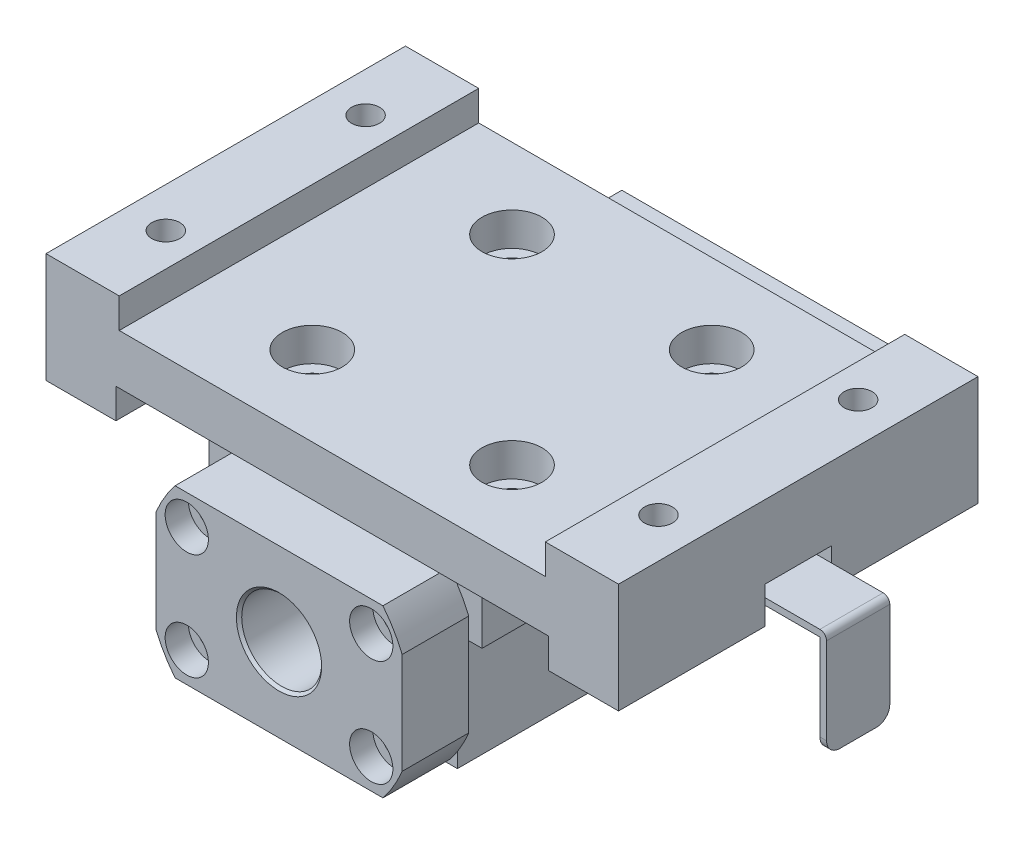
ISO-10303-21;
HEADER;
FILE_DESCRIPTION(('STEP AP214'),'2;1');
FILE_NAME('part.step','',(''),(''),'','','');
FILE_SCHEMA(('AUTOMOTIVE_DESIGN { 1 0 10303 214 1 1 1 1 }'));
ENDSEC;
DATA;
#1=APPLICATION_CONTEXT('core data for automotive mechanical design processes');
#2=APPLICATION_PROTOCOL_DEFINITION('international standard','automotive_design',2000,#1);
#3=PRODUCT_CONTEXT('',#1,'mechanical');
#4=PRODUCT('Part','Part','',(#3));
#5=PRODUCT_RELATED_PRODUCT_CATEGORY('part','',(#4));
#6=PRODUCT_DEFINITION_FORMATION('','',#4);
#7=PRODUCT_DEFINITION_CONTEXT('part definition',#1,'design');
#8=PRODUCT_DEFINITION('design','',#6,#7);
#9=PRODUCT_DEFINITION_SHAPE('','',#8);
#10=(LENGTH_UNIT() NAMED_UNIT(*) SI_UNIT(.MILLI.,.METRE.));
#11=(NAMED_UNIT(*) PLANE_ANGLE_UNIT() SI_UNIT($,.RADIAN.));
#12=(NAMED_UNIT(*) SI_UNIT($,.STERADIAN.) SOLID_ANGLE_UNIT());
#13=UNCERTAINTY_MEASURE_WITH_UNIT(LENGTH_MEASURE(1.E-05),#10,'distance_accuracy_value','');
#14=(GEOMETRIC_REPRESENTATION_CONTEXT(3) GLOBAL_UNCERTAINTY_ASSIGNED_CONTEXT((#13)) GLOBAL_UNIT_ASSIGNED_CONTEXT((#10,
#11,#12)) REPRESENTATION_CONTEXT('',''));
#15=CARTESIAN_POINT('',(0.,0.,0.));
#16=DIRECTION('',(0.,0.,1.));
#17=DIRECTION('',(1.,0.,0.));
#18=AXIS2_PLACEMENT_3D('',#15,#16,#17);
#19=CARTESIAN_POINT('',(15.11059932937,29.74579649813,-39.25));
#20=DIRECTION('',(0.,0.,1.));
#21=DIRECTION('',(0.,1.,0.));
#22=AXIS2_PLACEMENT_3D('',#19,#20,#21);
#23=PLANE('',#22);
#24=CARTESIAN_POINT('',(13.85640646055,31.00000000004,-39.25));
#25=DIRECTION('',(0.,0.,1.));
#26=DIRECTION('',(1.,0.,0.));
#27=AXIS2_PLACEMENT_3D('',#24,#25,#26);
#28=CIRCLE('',#27,1.1);
#29=CARTESIAN_POINT('',(14.95640646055,31.00000000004,-39.25));
#30=VERTEX_POINT('',#29);
#31=EDGE_CURVE('E20',#30,#30,#28,.T.);
#32=ORIENTED_EDGE('',*,*,#31,.T.);
#33=EDGE_LOOP('',(#32));
#34=FACE_BOUND('',#33,.T.);
#35=ADVANCED_FACE('F16',(#34),#23,.T.);
#36=CARTESIAN_POINT('',(-12.60221359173,29.74579649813,-39.25));
#37=DIRECTION('',(0.,0.,1.));
#38=DIRECTION('',(0.,1.,0.));
#39=AXIS2_PLACEMENT_3D('',#36,#37,#38);
#40=PLANE('',#39);
#41=CARTESIAN_POINT('',(-13.85640646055,31.00000000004,-39.25));
#42=DIRECTION('',(0.,0.,1.));
#43=DIRECTION('',(1.,0.,0.));
#44=AXIS2_PLACEMENT_3D('',#41,#42,#43);
#45=CIRCLE('',#44,1.1);
#46=CARTESIAN_POINT('',(-12.75640646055,31.00000000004,-39.25));
#47=VERTEX_POINT('',#46);
#48=EDGE_CURVE('E906',#47,#47,#45,.T.);
#49=ORIENTED_EDGE('',*,*,#48,.T.);
#50=EDGE_LOOP('',(#49));
#51=FACE_BOUND('',#50,.T.);
#52=ADVANCED_FACE('F3405',(#51),#40,.T.);
#53=CARTESIAN_POINT('',(-12.60221359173,13.74579649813,-39.25));
#54=DIRECTION('',(0.,0.,1.));
#55=DIRECTION('',(0.,1.,0.));
#56=AXIS2_PLACEMENT_3D('',#53,#54,#55);
#57=PLANE('',#56);
#58=CARTESIAN_POINT('',(-13.85640646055,15.00000000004,-39.25));
#59=DIRECTION('',(0.,0.,1.));
#60=DIRECTION('',(1.,0.,0.));
#61=AXIS2_PLACEMENT_3D('',#58,#59,#60);
#62=CIRCLE('',#61,1.1);
#63=CARTESIAN_POINT('',(-12.75640646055,15.00000000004,-39.25));
#64=VERTEX_POINT('',#63);
#65=EDGE_CURVE('E904',#64,#64,#62,.T.);
#66=ORIENTED_EDGE('',*,*,#65,.T.);
#67=EDGE_LOOP('',(#66));
#68=FACE_BOUND('',#67,.T.);
#69=ADVANCED_FACE('F3408',(#68),#57,.T.);
#70=CARTESIAN_POINT('',(15.11059932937,13.74579649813,-39.25));
#71=DIRECTION('',(0.,0.,1.));
#72=DIRECTION('',(0.,1.,0.));
#73=AXIS2_PLACEMENT_3D('',#70,#71,#72);
#74=PLANE('',#73);
#75=CARTESIAN_POINT('',(13.85640646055,15.00000000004,-39.25));
#76=DIRECTION('',(0.,0.,1.));
#77=DIRECTION('',(1.,0.,0.));
#78=AXIS2_PLACEMENT_3D('',#75,#76,#77);
#79=CIRCLE('',#78,1.1);
#80=CARTESIAN_POINT('',(14.95640646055,15.00000000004,-39.25));
#81=VERTEX_POINT('',#80);
#82=EDGE_CURVE('E901',#81,#81,#79,.T.);
#83=ORIENTED_EDGE('',*,*,#82,.T.);
#84=EDGE_LOOP('',(#83));
#85=FACE_BOUND('',#84,.T.);
#86=ADVANCED_FACE('F918',(#85),#74,.T.);
#87=CARTESIAN_POINT('',(13.85640646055,31.00000000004,-39.25));
#88=DIRECTION('',(0.,0.,1.));
#89=DIRECTION('',(1.,0.,0.));
#90=AXIS2_PLACEMENT_3D('',#87,#88,#89);
#91=CYLINDRICAL_SURFACE('',#90,1.1);
#92=ORIENTED_EDGE('',*,*,#31,.F.);
#93=EDGE_LOOP('',(#92));
#94=FACE_BOUND('',#93,.T.);
#95=CARTESIAN_POINT('',(13.85640646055,31.00000000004,-33.));
#96=DIRECTION('',(0.,0.,1.));
#97=DIRECTION('',(1.,0.,0.));
#98=AXIS2_PLACEMENT_3D('',#95,#96,#97);
#99=CIRCLE('',#98,1.1);
#100=CARTESIAN_POINT('',(14.95640646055,31.00000000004,-33.));
#101=VERTEX_POINT('',#100);
#102=EDGE_CURVE('E895',#101,#101,#99,.T.);
#103=ORIENTED_EDGE('',*,*,#102,.T.);
#104=EDGE_LOOP('',(#103));
#105=FACE_BOUND('',#104,.T.);
#106=ADVANCED_FACE('F914',(#94,#105),#91,.F.);
#107=CARTESIAN_POINT('',(-13.85640646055,31.00000000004,-39.25));
#108=DIRECTION('',(0.,0.,1.));
#109=DIRECTION('',(1.,0.,0.));
#110=AXIS2_PLACEMENT_3D('',#107,#108,#109);
#111=CYLINDRICAL_SURFACE('',#110,1.1);
#112=ORIENTED_EDGE('',*,*,#48,.F.);
#113=EDGE_LOOP('',(#112));
#114=FACE_BOUND('',#113,.T.);
#115=CARTESIAN_POINT('',(-13.85640646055,31.00000000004,-33.));
#116=DIRECTION('',(0.,0.,1.));
#117=DIRECTION('',(1.,0.,0.));
#118=AXIS2_PLACEMENT_3D('',#115,#116,#117);
#119=CIRCLE('',#118,1.1);
#120=CARTESIAN_POINT('',(-12.75640646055,31.00000000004,-33.));
#121=VERTEX_POINT('',#120);
#122=EDGE_CURVE('E892',#121,#121,#119,.T.);
#123=ORIENTED_EDGE('',*,*,#122,.T.);
#124=EDGE_LOOP('',(#123));
#125=FACE_BOUND('',#124,.T.);
#126=ADVANCED_FACE('F917',(#114,#125),#111,.F.);
#127=CARTESIAN_POINT('',(-13.85640646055,15.00000000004,-39.25));
#128=DIRECTION('',(0.,0.,1.));
#129=DIRECTION('',(1.,0.,0.));
#130=AXIS2_PLACEMENT_3D('',#127,#128,#129);
#131=CYLINDRICAL_SURFACE('',#130,1.1);
#132=ORIENTED_EDGE('',*,*,#65,.F.);
#133=EDGE_LOOP('',(#132));
#134=FACE_BOUND('',#133,.T.);
#135=CARTESIAN_POINT('',(-13.85640646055,15.00000000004,-33.));
#136=DIRECTION('',(0.,0.,1.));
#137=DIRECTION('',(1.,0.,0.));
#138=AXIS2_PLACEMENT_3D('',#135,#136,#137);
#139=CIRCLE('',#138,1.1);
#140=CARTESIAN_POINT('',(-12.75640646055,15.00000000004,-33.));
#141=VERTEX_POINT('',#140);
#142=EDGE_CURVE('E889',#141,#141,#139,.T.);
#143=ORIENTED_EDGE('',*,*,#142,.T.);
#144=EDGE_LOOP('',(#143));
#145=FACE_BOUND('',#144,.T.);
#146=ADVANCED_FACE('F3395',(#134,#145),#131,.F.);
#147=CARTESIAN_POINT('',(13.85640646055,15.00000000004,-39.25));
#148=DIRECTION('',(0.,0.,1.));
#149=DIRECTION('',(1.,0.,0.));
#150=AXIS2_PLACEMENT_3D('',#147,#148,#149);
#151=CYLINDRICAL_SURFACE('',#150,1.1);
#152=ORIENTED_EDGE('',*,*,#82,.F.);
#153=EDGE_LOOP('',(#152));
#154=FACE_BOUND('',#153,.T.);
#155=CARTESIAN_POINT('',(13.85640646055,15.00000000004,-33.));
#156=DIRECTION('',(0.,0.,1.));
#157=DIRECTION('',(1.,0.,0.));
#158=AXIS2_PLACEMENT_3D('',#155,#156,#157);
#159=CIRCLE('',#158,1.1);
#160=CARTESIAN_POINT('',(14.95640646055,15.00000000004,-33.));
#161=VERTEX_POINT('',#160);
#162=EDGE_CURVE('E544',#161,#161,#159,.T.);
#163=ORIENTED_EDGE('',*,*,#162,.T.);
#164=EDGE_LOOP('',(#163));
#165=FACE_BOUND('',#164,.T.);
#166=ADVANCED_FACE('F3145',(#154,#165),#151,.F.);
#167=CARTESIAN_POINT('',(0.,23.00000000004,-48.));
#168=DIRECTION('',(0.,0.,1.));
#169=DIRECTION('',(0.,-1.,0.));
#170=AXIS2_PLACEMENT_3D('',#167,#168,#169);
#171=CONICAL_SURFACE('',#170,11.6,0.785398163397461);
#172=CARTESIAN_POINT('',(0.,23.00000000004,-47.6));
#173=DIRECTION('',(0.,0.,-1.));
#174=DIRECTION('',(0.,-1.,0.));
#175=AXIS2_PLACEMENT_3D('',#172,#173,#174);
#176=CIRCLE('',#175,12.);
#177=CARTESIAN_POINT('',(0.,11.00000000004,-47.6));
#178=VERTEX_POINT('',#177);
#179=EDGE_CURVE('E541',#178,#178,#176,.T.);
#180=ORIENTED_EDGE('',*,*,#179,.T.);
#181=EDGE_LOOP('',(#180));
#182=FACE_BOUND('',#181,.T.);
#183=CARTESIAN_POINT('',(0.,23.00000000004,-48.));
#184=DIRECTION('',(0.,0.,1.));
#185=DIRECTION('',(0.,-1.,0.));
#186=AXIS2_PLACEMENT_3D('',#183,#184,#185);
#187=CIRCLE('',#186,11.6);
#188=CARTESIAN_POINT('',(0.,11.40000000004,-48.));
#189=VERTEX_POINT('',#188);
#190=EDGE_CURVE('E898',#189,#189,#187,.T.);
#191=ORIENTED_EDGE('',*,*,#190,.T.);
#192=EDGE_LOOP('',(#191));
#193=FACE_BOUND('',#192,.T.);
#194=ADVANCED_FACE('F3142',(#182,#193),#171,.T.);
#195=CARTESIAN_POINT('',(15.,31.01931150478,-55.));
#196=DIRECTION('',(0.,1.,0.));
#197=DIRECTION('',(0.,0.,1.));
#198=AXIS2_PLACEMENT_3D('',#195,#196,#197);
#199=CONICAL_SURFACE('',#198,0.,1.02974425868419);
#200=CARTESIAN_POINT('',(15.,31.01931150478,-55.));
#201=VERTEX_POINT('',#200);
#202=VERTEX_LOOP('',#201);
#203=FACE_BOUND('',#202,.T.);
#204=CARTESIAN_POINT('',(15.,31.5,-55.));
#205=DIRECTION('',(0.,-1.,0.));
#206=DIRECTION('',(1.,0.,0.));
#207=AXIS2_PLACEMENT_3D('',#204,#205,#206);
#208=CIRCLE('',#207,0.800000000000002);
#209=CARTESIAN_POINT('',(15.8,31.5,-55.));
#210=VERTEX_POINT('',#209);
#211=EDGE_CURVE('E538',#210,#210,#208,.F.);
#212=ORIENTED_EDGE('',*,*,#211,.T.);
#213=EDGE_LOOP('',(#212));
#214=FACE_BOUND('',#213,.T.);
#215=ADVANCED_FACE('F3144',(#203,#214),#199,.F.);
#216=CARTESIAN_POINT('',(15.,31.01931150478,-61.));
#217=DIRECTION('',(0.,1.,0.));
#218=DIRECTION('',(0.,0.,1.));
#219=AXIS2_PLACEMENT_3D('',#216,#217,#218);
#220=CONICAL_SURFACE('',#219,0.,1.02974425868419);
#221=CARTESIAN_POINT('',(15.,31.01931150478,-61.));
#222=VERTEX_POINT('',#221);
#223=VERTEX_LOOP('',#222);
#224=FACE_BOUND('',#223,.T.);
#225=CARTESIAN_POINT('',(15.,31.5,-61.));
#226=DIRECTION('',(0.,-1.,0.));
#227=DIRECTION('',(1.,0.,0.));
#228=AXIS2_PLACEMENT_3D('',#225,#226,#227);
#229=CIRCLE('',#228,0.800000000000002);
#230=CARTESIAN_POINT('',(15.8,31.5,-61.));
#231=VERTEX_POINT('',#230);
#232=EDGE_CURVE('E534',#231,#231,#229,.F.);
#233=ORIENTED_EDGE('',*,*,#232,.T.);
#234=EDGE_LOOP('',(#233));
#235=FACE_BOUND('',#234,.T.);
#236=ADVANCED_FACE('F3134',(#224,#235),#220,.F.);
#237=CARTESIAN_POINT('',(-12.06428612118,35.06400000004,-48.));
#238=DIRECTION('',(0.,0.,1.));
#239=DIRECTION('',(0.,-1.,0.));
#240=AXIS2_PLACEMENT_3D('',#237,#238,#239);
#241=PLANE('',#240);
#242=CARTESIAN_POINT('',(0.,23.00000000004,-47.9999999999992));
#243=DIRECTION('',(0.,0.,-1.));
#244=DIRECTION('',(-1.,0.,0.));
#245=AXIS2_PLACEMENT_3D('',#242,#243,#244);
#246=CIRCLE('',#245,6.40000000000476);
#247=CARTESIAN_POINT('',(-6.40000000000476,23.00000000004,-47.9999999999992));
#248=VERTEX_POINT('',#247);
#249=EDGE_CURVE('E537',#248,#248,#246,.F.);
#250=ORIENTED_EDGE('',*,*,#249,.T.);
#251=EDGE_LOOP('',(#250));
#252=FACE_BOUND('',#251,.T.);
#253=ORIENTED_EDGE('',*,*,#190,.F.);
#254=EDGE_LOOP('',(#253));
#255=FACE_BOUND('',#254,.T.);
#256=ADVANCED_FACE('F926',(#252,#255),#241,.F.);
#257=CARTESIAN_POINT('',(21.32,36.522,-33.));
#258=DIRECTION('',(0.,0.,1.));
#259=DIRECTION('',(-1.,0.,0.));
#260=AXIS2_PLACEMENT_3D('',#257,#258,#259);
#261=PLANE('',#260);
#262=ORIENTED_EDGE('',*,*,#102,.F.);
#263=EDGE_LOOP('',(#262));
#264=FACE_BOUND('',#263,.T.);
#265=CARTESIAN_POINT('',(13.85640646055,31.00000000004,-33.));
#266=DIRECTION('',(0.,0.,1.));
#267=DIRECTION('',(1.,0.,0.));
#268=AXIS2_PLACEMENT_3D('',#265,#266,#267);
#269=CIRCLE('',#268,1.75);
#270=CARTESIAN_POINT('',(15.60640646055,31.00000000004,-33.));
#271=VERTEX_POINT('',#270);
#272=EDGE_CURVE('E882',#271,#271,#269,.T.);
#273=ORIENTED_EDGE('',*,*,#272,.T.);
#274=EDGE_LOOP('',(#273));
#275=FACE_BOUND('',#274,.T.);
#276=ADVANCED_FACE('F922',(#264,#275),#261,.T.);
#277=CARTESIAN_POINT('',(21.32,36.522,-33.));
#278=DIRECTION('',(0.,0.,1.));
#279=DIRECTION('',(-1.,0.,0.));
#280=AXIS2_PLACEMENT_3D('',#277,#278,#279);
#281=PLANE('',#280);
#282=ORIENTED_EDGE('',*,*,#122,.F.);
#283=EDGE_LOOP('',(#282));
#284=FACE_BOUND('',#283,.T.);
#285=CARTESIAN_POINT('',(-13.85640646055,31.00000000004,-33.));
#286=DIRECTION('',(0.,0.,1.));
#287=DIRECTION('',(1.,0.,0.));
#288=AXIS2_PLACEMENT_3D('',#285,#286,#287);
#289=CIRCLE('',#288,1.75);
#290=CARTESIAN_POINT('',(-12.10640646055,31.00000000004,-33.));
#291=VERTEX_POINT('',#290);
#292=EDGE_CURVE('E879',#291,#291,#289,.T.);
#293=ORIENTED_EDGE('',*,*,#292,.T.);
#294=EDGE_LOOP('',(#293));
#295=FACE_BOUND('',#294,.T.);
#296=ADVANCED_FACE('F925',(#284,#295),#281,.T.);
#297=CARTESIAN_POINT('',(21.32,36.522,-33.));
#298=DIRECTION('',(0.,0.,1.));
#299=DIRECTION('',(-1.,0.,0.));
#300=AXIS2_PLACEMENT_3D('',#297,#298,#299);
#301=PLANE('',#300);
#302=ORIENTED_EDGE('',*,*,#142,.F.);
#303=EDGE_LOOP('',(#302));
#304=FACE_BOUND('',#303,.T.);
#305=CARTESIAN_POINT('',(-13.85640646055,15.00000000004,-33.));
#306=DIRECTION('',(0.,0.,1.));
#307=DIRECTION('',(1.,0.,0.));
#308=AXIS2_PLACEMENT_3D('',#305,#306,#307);
#309=CIRCLE('',#308,1.75);
#310=CARTESIAN_POINT('',(-12.10640646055,15.00000000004,-33.));
#311=VERTEX_POINT('',#310);
#312=EDGE_CURVE('E876',#311,#311,#309,.T.);
#313=ORIENTED_EDGE('',*,*,#312,.T.);
#314=EDGE_LOOP('',(#313));
#315=FACE_BOUND('',#314,.T.);
#316=ADVANCED_FACE('F1703',(#304,#315),#301,.T.);
#317=CARTESIAN_POINT('',(21.32,36.522,-33.));
#318=DIRECTION('',(0.,0.,1.));
#319=DIRECTION('',(-1.,0.,0.));
#320=AXIS2_PLACEMENT_3D('',#317,#318,#319);
#321=PLANE('',#320);
#322=ORIENTED_EDGE('',*,*,#162,.F.);
#323=EDGE_LOOP('',(#322));
#324=FACE_BOUND('',#323,.T.);
#325=CARTESIAN_POINT('',(13.85640646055,15.00000000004,-33.));
#326=DIRECTION('',(0.,0.,1.));
#327=DIRECTION('',(1.,0.,0.));
#328=AXIS2_PLACEMENT_3D('',#325,#326,#327);
#329=CIRCLE('',#328,1.75);
#330=CARTESIAN_POINT('',(15.60640646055,15.00000000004,-33.));
#331=VERTEX_POINT('',#330);
#332=EDGE_CURVE('E873',#331,#331,#329,.T.);
#333=ORIENTED_EDGE('',*,*,#332,.T.);
#334=EDGE_LOOP('',(#333));
#335=FACE_BOUND('',#334,.T.);
#336=ADVANCED_FACE('F1705',(#324,#335),#321,.T.);
#337=CARTESIAN_POINT('',(0.,23.00000000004,-33.));
#338=DIRECTION('',(0.,0.,-1.));
#339=DIRECTION('',(-1.,0.,0.));
#340=AXIS2_PLACEMENT_3D('',#337,#338,#339);
#341=CYLINDRICAL_SURFACE('',#340,12.);
#342=CARTESIAN_POINT('',(0.,23.00000000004,-33.));
#343=DIRECTION('',(0.,0.,-1.));
#344=DIRECTION('',(-1.,0.,0.));
#345=AXIS2_PLACEMENT_3D('',#342,#343,#344);
#346=CIRCLE('',#345,12.);
#347=CARTESIAN_POINT('',(-12.,23.00000000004,-33.));
#348=VERTEX_POINT('',#347);
#349=EDGE_CURVE('E870',#348,#348,#346,.T.);
#350=ORIENTED_EDGE('',*,*,#349,.T.);
#351=EDGE_LOOP('',(#350));
#352=FACE_BOUND('',#351,.T.);
#353=ORIENTED_EDGE('',*,*,#179,.F.);
#354=EDGE_LOOP('',(#353));
#355=FACE_BOUND('',#354,.T.);
#356=ADVANCED_FACE('F1712',(#352,#355),#341,.T.);
#357=CARTESIAN_POINT('',(15.,34.,-55.));
#358=DIRECTION('',(0.,-1.,0.));
#359=DIRECTION('',(0.,0.,-1.));
#360=AXIS2_PLACEMENT_3D('',#357,#358,#359);
#361=CYLINDRICAL_SURFACE('',#360,0.800000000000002);
#362=ORIENTED_EDGE('',*,*,#211,.F.);
#363=EDGE_LOOP('',(#362));
#364=FACE_BOUND('',#363,.T.);
#365=CARTESIAN_POINT('',(15.,34.,-55.));
#366=DIRECTION('',(0.,-1.,0.));
#367=DIRECTION('',(0.,0.,-1.));
#368=AXIS2_PLACEMENT_3D('',#365,#366,#367);
#369=CIRCLE('',#368,0.800000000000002);
#370=CARTESIAN_POINT('',(15.,34.,-55.8));
#371=VERTEX_POINT('',#370);
#372=EDGE_CURVE('E867',#371,#371,#369,.F.);
#373=ORIENTED_EDGE('',*,*,#372,.T.);
#374=EDGE_LOOP('',(#373));
#375=FACE_BOUND('',#374,.T.);
#376=ADVANCED_FACE('F3127',(#364,#375),#361,.F.);
#377=CARTESIAN_POINT('',(15.,34.,-61.));
#378=DIRECTION('',(0.,-1.,0.));
#379=DIRECTION('',(0.,0.,-1.));
#380=AXIS2_PLACEMENT_3D('',#377,#378,#379);
#381=CYLINDRICAL_SURFACE('',#380,0.800000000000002);
#382=ORIENTED_EDGE('',*,*,#232,.F.);
#383=EDGE_LOOP('',(#382));
#384=FACE_BOUND('',#383,.T.);
#385=CARTESIAN_POINT('',(15.,34.,-61.));
#386=DIRECTION('',(0.,-1.,0.));
#387=DIRECTION('',(0.,0.,-1.));
#388=AXIS2_PLACEMENT_3D('',#385,#386,#387);
#389=CIRCLE('',#388,0.800000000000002);
#390=CARTESIAN_POINT('',(15.,34.,-61.8));
#391=VERTEX_POINT('',#390);
#392=EDGE_CURVE('E533',#391,#391,#389,.F.);
#393=ORIENTED_EDGE('',*,*,#392,.T.);
#394=EDGE_LOOP('',(#393));
#395=FACE_BOUND('',#394,.T.);
#396=ADVANCED_FACE('F944',(#384,#395),#381,.F.);
#397=CARTESIAN_POINT('',(0.,23.00000000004,-47.5999999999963));
#398=DIRECTION('',(0.,0.,-1.));
#399=DIRECTION('',(-1.,0.,0.));
#400=AXIS2_PLACEMENT_3D('',#397,#398,#399);
#401=CONICAL_SURFACE('',#400,6.00000000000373,0.785398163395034);
#402=CARTESIAN_POINT('',(0.,23.00000000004,-47.6));
#403=DIRECTION('',(0.,0.,-1.));
#404=DIRECTION('',(0.,-1.,0.));
#405=AXIS2_PLACEMENT_3D('',#402,#403,#404);
#406=CIRCLE('',#405,5.99999999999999);
#407=CARTESIAN_POINT('',(0.,17.00000000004,-47.6));
#408=VERTEX_POINT('',#407);
#409=EDGE_CURVE('E529',#408,#408,#406,.F.);
#410=ORIENTED_EDGE('',*,*,#409,.T.);
#411=EDGE_LOOP('',(#410));
#412=FACE_BOUND('',#411,.T.);
#413=ORIENTED_EDGE('',*,*,#249,.F.);
#414=EDGE_LOOP('',(#413));
#415=FACE_BOUND('',#414,.T.);
#416=ADVANCED_FACE('F933',(#412,#415),#401,.F.);
#417=CARTESIAN_POINT('',(13.85640646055,31.00000000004,-33.));
#418=DIRECTION('',(0.,0.,1.));
#419=DIRECTION('',(1.,0.,0.));
#420=AXIS2_PLACEMENT_3D('',#417,#418,#419);
#421=CYLINDRICAL_SURFACE('',#420,1.75);
#422=CARTESIAN_POINT('',(13.85640646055,31.00000000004,-26.5));
#423=DIRECTION('',(0.,0.,1.));
#424=DIRECTION('',(1.,0.,0.));
#425=AXIS2_PLACEMENT_3D('',#422,#423,#424);
#426=CIRCLE('',#425,1.75);
#427=CARTESIAN_POINT('',(15.60640646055,31.00000000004,-26.5));
#428=VERTEX_POINT('',#427);
#429=EDGE_CURVE('E532',#428,#428,#426,.T.);
#430=ORIENTED_EDGE('',*,*,#429,.T.);
#431=EDGE_LOOP('',(#430));
#432=FACE_BOUND('',#431,.T.);
#433=ORIENTED_EDGE('',*,*,#272,.F.);
#434=EDGE_LOOP('',(#433));
#435=FACE_BOUND('',#434,.T.);
#436=ADVANCED_FACE('F930',(#432,#435),#421,.F.);
#437=CARTESIAN_POINT('',(-13.85640646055,31.00000000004,-33.));
#438=DIRECTION('',(0.,0.,1.));
#439=DIRECTION('',(1.,0.,0.));
#440=AXIS2_PLACEMENT_3D('',#437,#438,#439);
#441=CYLINDRICAL_SURFACE('',#440,1.75);
#442=CARTESIAN_POINT('',(-13.85640646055,31.00000000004,-26.5));
#443=DIRECTION('',(0.,0.,1.));
#444=DIRECTION('',(1.,0.,0.));
#445=AXIS2_PLACEMENT_3D('',#442,#443,#444);
#446=CIRCLE('',#445,1.75);
#447=CARTESIAN_POINT('',(-12.10640646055,31.00000000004,-26.5));
#448=VERTEX_POINT('',#447);
#449=EDGE_CURVE('E860',#448,#448,#446,.T.);
#450=ORIENTED_EDGE('',*,*,#449,.T.);
#451=EDGE_LOOP('',(#450));
#452=FACE_BOUND('',#451,.T.);
#453=ORIENTED_EDGE('',*,*,#292,.F.);
#454=EDGE_LOOP('',(#453));
#455=FACE_BOUND('',#454,.T.);
#456=ADVANCED_FACE('F932',(#452,#455),#441,.F.);
#457=CARTESIAN_POINT('',(-13.85640646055,15.00000000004,-33.));
#458=DIRECTION('',(0.,0.,1.));
#459=DIRECTION('',(1.,0.,0.));
#460=AXIS2_PLACEMENT_3D('',#457,#458,#459);
#461=CYLINDRICAL_SURFACE('',#460,1.75);
#462=CARTESIAN_POINT('',(-13.85640646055,15.00000000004,-26.5));
#463=DIRECTION('',(0.,0.,1.));
#464=DIRECTION('',(1.,0.,0.));
#465=AXIS2_PLACEMENT_3D('',#462,#463,#464);
#466=CIRCLE('',#465,1.75);
#467=CARTESIAN_POINT('',(-12.10640646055,15.00000000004,-26.5));
#468=VERTEX_POINT('',#467);
#469=EDGE_CURVE('E857',#468,#468,#466,.T.);
#470=ORIENTED_EDGE('',*,*,#469,.T.);
#471=EDGE_LOOP('',(#470));
#472=FACE_BOUND('',#471,.T.);
#473=ORIENTED_EDGE('',*,*,#312,.F.);
#474=EDGE_LOOP('',(#473));
#475=FACE_BOUND('',#474,.T.);
#476=ADVANCED_FACE('F941',(#472,#475),#461,.F.);
#477=CARTESIAN_POINT('',(13.85640646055,15.00000000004,-33.));
#478=DIRECTION('',(0.,0.,1.));
#479=DIRECTION('',(1.,0.,0.));
#480=AXIS2_PLACEMENT_3D('',#477,#478,#479);
#481=CYLINDRICAL_SURFACE('',#480,1.75);
#482=CARTESIAN_POINT('',(13.85640646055,15.00000000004,-26.5));
#483=DIRECTION('',(0.,0.,1.));
#484=DIRECTION('',(1.,0.,0.));
#485=AXIS2_PLACEMENT_3D('',#482,#483,#484);
#486=CIRCLE('',#485,1.75);
#487=CARTESIAN_POINT('',(15.60640646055,15.00000000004,-26.5));
#488=VERTEX_POINT('',#487);
#489=EDGE_CURVE('E487',#488,#488,#486,.T.);
#490=ORIENTED_EDGE('',*,*,#489,.T.);
#491=EDGE_LOOP('',(#490));
#492=FACE_BOUND('',#491,.T.);
#493=ORIENTED_EDGE('',*,*,#332,.F.);
#494=EDGE_LOOP('',(#493));
#495=FACE_BOUND('',#494,.T.);
#496=ADVANCED_FACE('F1690',(#492,#495),#481,.F.);
#497=CARTESIAN_POINT('',(-19.24,35.73999999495,-33.));
#498=DIRECTION('',(0.,0.,1.));
#499=DIRECTION('',(0.,-1.,0.));
#500=AXIS2_PLACEMENT_3D('',#497,#498,#499);
#501=PLANE('',#500);
#502=ORIENTED_EDGE('',*,*,#349,.F.);
#503=EDGE_LOOP('',(#502));
#504=FACE_BOUND('',#503,.T.);
#505=CARTESIAN_POINT('',(0.,23.00000000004,-33.));
#506=DIRECTION('',(0.,0.,1.));
#507=DIRECTION('',(1.,0.,0.));
#508=AXIS2_PLACEMENT_3D('',#505,#506,#507);
#509=CIRCLE('',#508,12.25);
#510=CARTESIAN_POINT('',(12.25,23.00000000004,-33.));
#511=VERTEX_POINT('',#510);
#512=EDGE_CURVE('E476',#511,#511,#509,.F.);
#513=ORIENTED_EDGE('',*,*,#512,.T.);
#514=EDGE_LOOP('',(#513));
#515=FACE_BOUND('',#514,.T.);
#516=ADVANCED_FACE('F1693',(#504,#515),#501,.F.);
#517=CARTESIAN_POINT('',(21.32,34.,-52.775));
#518=DIRECTION('',(0.,1.,0.));
#519=DIRECTION('',(0.,0.,-1.));
#520=AXIS2_PLACEMENT_3D('',#517,#518,#519);
#521=PLANE('',#520);
#522=ORIENTED_EDGE('',*,*,#372,.F.);
#523=EDGE_LOOP('',(#522));
#524=FACE_BOUND('',#523,.T.);
#525=CARTESIAN_POINT('',(15.,34.,-55.));
#526=DIRECTION('',(0.,1.,0.));
#527=DIRECTION('',(0.,0.,1.));
#528=AXIS2_PLACEMENT_3D('',#525,#526,#527);
#529=CIRCLE('',#528,1.4);
#530=CARTESIAN_POINT('',(15.,34.,-53.6));
#531=VERTEX_POINT('',#530);
#532=EDGE_CURVE('E1544',#531,#531,#529,.T.);
#533=ORIENTED_EDGE('',*,*,#532,.T.);
#534=EDGE_LOOP('',(#533));
#535=FACE_BOUND('',#534,.T.);
#536=ADVANCED_FACE('F1721',(#524,#535),#521,.T.);
#537=CARTESIAN_POINT('',(21.32,34.,-52.775));
#538=DIRECTION('',(0.,1.,0.));
#539=DIRECTION('',(0.,0.,-1.));
#540=AXIS2_PLACEMENT_3D('',#537,#538,#539);
#541=PLANE('',#540);
#542=ORIENTED_EDGE('',*,*,#392,.F.);
#543=EDGE_LOOP('',(#542));
#544=FACE_BOUND('',#543,.T.);
#545=CARTESIAN_POINT('',(15.,34.,-61.));
#546=DIRECTION('',(0.,1.,0.));
#547=DIRECTION('',(0.,0.,1.));
#548=AXIS2_PLACEMENT_3D('',#545,#546,#547);
#549=CIRCLE('',#548,1.4);
#550=CARTESIAN_POINT('',(15.,34.,-59.6));
#551=VERTEX_POINT('',#550);
#552=EDGE_CURVE('E1541',#551,#551,#549,.T.);
#553=ORIENTED_EDGE('',*,*,#552,.T.);
#554=EDGE_LOOP('',(#553));
#555=FACE_BOUND('',#554,.T.);
#556=ADVANCED_FACE('F1688',(#544,#555),#541,.T.);
#557=CARTESIAN_POINT('',(-15.,35.6,-43.));
#558=DIRECTION('',(0.,1.,0.));
#559=DIRECTION('',(0.,0.,1.));
#560=AXIS2_PLACEMENT_3D('',#557,#558,#559);
#561=CONICAL_SURFACE('',#560,2.1,0.785398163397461);
#562=CARTESIAN_POINT('',(-15.,35.6,-43.));
#563=DIRECTION('',(0.,-1.,0.));
#564=DIRECTION('',(1.,0.,0.));
#565=AXIS2_PLACEMENT_3D('',#562,#563,#564);
#566=CIRCLE('',#565,2.1);
#567=CARTESIAN_POINT('',(-12.9,35.6,-43.));
#568=VERTEX_POINT('',#567);
#569=EDGE_CURVE('E513',#568,#568,#566,.T.);
#570=ORIENTED_EDGE('',*,*,#569,.T.);
#571=EDGE_LOOP('',(#570));
#572=FACE_BOUND('',#571,.T.);
#573=CARTESIAN_POINT('',(-15.,36.,-43.));
#574=DIRECTION('',(0.,1.,0.));
#575=DIRECTION('',(0.,0.,1.));
#576=AXIS2_PLACEMENT_3D('',#573,#574,#575);
#577=CIRCLE('',#576,2.5);
#578=CARTESIAN_POINT('',(-15.,36.,-40.5));
#579=VERTEX_POINT('',#578);
#580=EDGE_CURVE('E1538',#579,#579,#577,.T.);
#581=ORIENTED_EDGE('',*,*,#580,.T.);
#582=EDGE_LOOP('',(#581));
#583=FACE_BOUND('',#582,.T.);
#584=ADVANCED_FACE('F1684',(#572,#583),#561,.F.);
#585=CARTESIAN_POINT('',(15.,35.6,-43.));
#586=DIRECTION('',(0.,1.,0.));
#587=DIRECTION('',(0.,0.,1.));
#588=AXIS2_PLACEMENT_3D('',#585,#586,#587);
#589=CONICAL_SURFACE('',#588,2.1,0.785398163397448);
#590=CARTESIAN_POINT('',(15.,35.6,-43.));
#591=DIRECTION('',(0.,-1.,0.));
#592=DIRECTION('',(1.,0.,0.));
#593=AXIS2_PLACEMENT_3D('',#590,#591,#592);
#594=CIRCLE('',#593,2.1);
#595=CARTESIAN_POINT('',(17.1,35.6,-43.));
#596=VERTEX_POINT('',#595);
#597=EDGE_CURVE('E525',#596,#596,#594,.T.);
#598=ORIENTED_EDGE('',*,*,#597,.T.);
#599=EDGE_LOOP('',(#598));
#600=FACE_BOUND('',#599,.T.);
#601=CARTESIAN_POINT('',(15.,36.,-43.));
#602=DIRECTION('',(0.,1.,0.));
#603=DIRECTION('',(0.,0.,1.));
#604=AXIS2_PLACEMENT_3D('',#601,#602,#603);
#605=CIRCLE('',#604,2.5);
#606=CARTESIAN_POINT('',(15.,36.,-40.5));
#607=VERTEX_POINT('',#606);
#608=EDGE_CURVE('E1531',#607,#607,#605,.T.);
#609=ORIENTED_EDGE('',*,*,#608,.T.);
#610=EDGE_LOOP('',(#609));
#611=FACE_BOUND('',#610,.T.);
#612=ADVANCED_FACE('F1677',(#600,#611),#589,.F.);
#613=CARTESIAN_POINT('',(15.,35.6,-73.));
#614=DIRECTION('',(0.,1.,0.));
#615=DIRECTION('',(0.,0.,1.));
#616=AXIS2_PLACEMENT_3D('',#613,#614,#615);
#617=CONICAL_SURFACE('',#616,2.1,0.785398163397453);
#618=CARTESIAN_POINT('',(15.,35.6,-73.));
#619=DIRECTION('',(0.,-1.,0.));
#620=DIRECTION('',(1.,0.,0.));
#621=AXIS2_PLACEMENT_3D('',#618,#619,#620);
#622=CIRCLE('',#621,2.1);
#623=CARTESIAN_POINT('',(17.1,35.6,-73.));
#624=VERTEX_POINT('',#623);
#625=EDGE_CURVE('E521',#624,#624,#622,.T.);
#626=ORIENTED_EDGE('',*,*,#625,.T.);
#627=EDGE_LOOP('',(#626));
#628=FACE_BOUND('',#627,.T.);
#629=CARTESIAN_POINT('',(15.,36.,-73.));
#630=DIRECTION('',(0.,1.,0.));
#631=DIRECTION('',(0.,0.,1.));
#632=AXIS2_PLACEMENT_3D('',#629,#630,#631);
#633=CIRCLE('',#632,2.50000000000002);
#634=CARTESIAN_POINT('',(15.,36.,-70.5));
#635=VERTEX_POINT('',#634);
#636=EDGE_CURVE('E1526',#635,#635,#633,.T.);
#637=ORIENTED_EDGE('',*,*,#636,.T.);
#638=EDGE_LOOP('',(#637));
#639=FACE_BOUND('',#638,.T.);
#640=ADVANCED_FACE('F1669',(#628,#639),#617,.F.);
#641=CARTESIAN_POINT('',(-15.,35.6,-73.));
#642=DIRECTION('',(0.,1.,0.));
#643=DIRECTION('',(0.,0.,1.));
#644=AXIS2_PLACEMENT_3D('',#641,#642,#643);
#645=CONICAL_SURFACE('',#644,2.1,0.785398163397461);
#646=CARTESIAN_POINT('',(-15.,35.6,-73.));
#647=DIRECTION('',(0.,-1.,0.));
#648=DIRECTION('',(1.,0.,0.));
#649=AXIS2_PLACEMENT_3D('',#646,#647,#648);
#650=CIRCLE('',#649,2.1);
#651=CARTESIAN_POINT('',(-12.9,35.6,-73.));
#652=VERTEX_POINT('',#651);
#653=EDGE_CURVE('E518',#652,#652,#650,.T.);
#654=ORIENTED_EDGE('',*,*,#653,.T.);
#655=EDGE_LOOP('',(#654));
#656=FACE_BOUND('',#655,.T.);
#657=CARTESIAN_POINT('',(-15.,36.,-73.));
#658=DIRECTION('',(0.,1.,0.));
#659=DIRECTION('',(0.,0.,1.));
#660=AXIS2_PLACEMENT_3D('',#657,#658,#659);
#661=CIRCLE('',#660,2.50000000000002);
#662=CARTESIAN_POINT('',(-15.,36.,-70.5));
#663=VERTEX_POINT('',#662);
#664=EDGE_CURVE('E1522',#663,#663,#661,.T.);
#665=ORIENTED_EDGE('',*,*,#664,.T.);
#666=EDGE_LOOP('',(#665));
#667=FACE_BOUND('',#666,.T.);
#668=ADVANCED_FACE('F1666',(#656,#667),#645,.F.);
#669=CARTESIAN_POINT('',(0.,23.00000000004,-23.4));
#670=DIRECTION('',(0.,0.,-1.));
#671=DIRECTION('',(-1.,0.,0.));
#672=AXIS2_PLACEMENT_3D('',#669,#670,#671);
#673=CYLINDRICAL_SURFACE('',#672,5.99999999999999);
#674=ORIENTED_EDGE('',*,*,#409,.F.);
#675=EDGE_LOOP('',(#674));
#676=FACE_BOUND('',#675,.T.);
#677=CARTESIAN_POINT('',(0.,23.00000000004,-23.3999999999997));
#678=DIRECTION('',(0.,0.,1.));
#679=DIRECTION('',(-1.,0.,0.));
#680=AXIS2_PLACEMENT_3D('',#677,#678,#679);
#681=CIRCLE('',#680,6.00000000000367);
#682=CARTESIAN_POINT('',(-6.00000000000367,23.00000000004,-23.3999999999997));
#683=VERTEX_POINT('',#682);
#684=EDGE_CURVE('E508',#683,#683,#681,.T.);
#685=ORIENTED_EDGE('',*,*,#684,.T.);
#686=EDGE_LOOP('',(#685));
#687=FACE_BOUND('',#686,.T.);
#688=ADVANCED_FACE('F1668',(#676,#687),#673,.F.);
#689=CARTESIAN_POINT('',(10.45220295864,27.59580750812,-26.5));
#690=DIRECTION('',(0.,0.,1.));
#691=DIRECTION('',(1.,0.,0.));
#692=AXIS2_PLACEMENT_3D('',#689,#690,#691);
#693=PLANE('',#692);
#694=ORIENTED_EDGE('',*,*,#429,.F.);
#695=EDGE_LOOP('',(#694));
#696=FACE_BOUND('',#695,.T.);
#697=CARTESIAN_POINT('',(13.85640646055,31.00000000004,-26.5));
#698=DIRECTION('',(0.,0.,1.));
#699=DIRECTION('',(1.,0.,0.));
#700=AXIS2_PLACEMENT_3D('',#697,#698,#699);
#701=CIRCLE('',#700,3.25);
#702=CARTESIAN_POINT('',(17.10640646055,31.00000000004,-26.5));
#703=VERTEX_POINT('',#702);
#704=EDGE_CURVE('E511',#703,#703,#701,.T.);
#705=ORIENTED_EDGE('',*,*,#704,.T.);
#706=EDGE_LOOP('',(#705));
#707=FACE_BOUND('',#706,.T.);
#708=ADVANCED_FACE('F1596',(#696,#707),#693,.T.);
#709=CARTESIAN_POINT('',(-17.26060996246,27.59580750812,-26.5));
#710=DIRECTION('',(0.,0.,1.));
#711=DIRECTION('',(1.,0.,0.));
#712=AXIS2_PLACEMENT_3D('',#709,#710,#711);
#713=PLANE('',#712);
#714=ORIENTED_EDGE('',*,*,#449,.F.);
#715=EDGE_LOOP('',(#714));
#716=FACE_BOUND('',#715,.T.);
#717=CARTESIAN_POINT('',(-13.85640646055,31.00000000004,-26.5));
#718=DIRECTION('',(0.,0.,1.));
#719=DIRECTION('',(1.,0.,0.));
#720=AXIS2_PLACEMENT_3D('',#717,#718,#719);
#721=CIRCLE('',#720,3.25);
#722=CARTESIAN_POINT('',(-10.60640646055,31.00000000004,-26.5));
#723=VERTEX_POINT('',#722);
#724=EDGE_CURVE('E1589',#723,#723,#721,.T.);
#725=ORIENTED_EDGE('',*,*,#724,.T.);
#726=EDGE_LOOP('',(#725));
#727=FACE_BOUND('',#726,.T.);
#728=ADVANCED_FACE('F1731',(#716,#727),#713,.T.);
#729=CARTESIAN_POINT('',(-17.26060996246,11.59580750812,-26.5));
#730=DIRECTION('',(0.,0.,1.));
#731=DIRECTION('',(1.,0.,0.));
#732=AXIS2_PLACEMENT_3D('',#729,#730,#731);
#733=PLANE('',#732);
#734=ORIENTED_EDGE('',*,*,#469,.F.);
#735=EDGE_LOOP('',(#734));
#736=FACE_BOUND('',#735,.T.);
#737=CARTESIAN_POINT('',(-13.85640646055,15.00000000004,-26.5));
#738=DIRECTION('',(0.,0.,1.));
#739=DIRECTION('',(1.,0.,0.));
#740=AXIS2_PLACEMENT_3D('',#737,#738,#739);
#741=CIRCLE('',#740,3.25);
#742=CARTESIAN_POINT('',(-10.60640646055,15.00000000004,-26.5));
#743=VERTEX_POINT('',#742);
#744=EDGE_CURVE('E1587',#743,#743,#741,.T.);
#745=ORIENTED_EDGE('',*,*,#744,.T.);
#746=EDGE_LOOP('',(#745));
#747=FACE_BOUND('',#746,.T.);
#748=ADVANCED_FACE('F1735',(#736,#747),#733,.T.);
#749=CARTESIAN_POINT('',(10.45220295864,11.59580750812,-26.5));
#750=DIRECTION('',(0.,0.,1.));
#751=DIRECTION('',(1.,0.,0.));
#752=AXIS2_PLACEMENT_3D('',#749,#750,#751);
#753=PLANE('',#752);
#754=ORIENTED_EDGE('',*,*,#489,.F.);
#755=EDGE_LOOP('',(#754));
#756=FACE_BOUND('',#755,.T.);
#757=CARTESIAN_POINT('',(13.85640646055,15.00000000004,-26.5));
#758=DIRECTION('',(0.,0.,1.));
#759=DIRECTION('',(1.,0.,0.));
#760=AXIS2_PLACEMENT_3D('',#757,#758,#759);
#761=CIRCLE('',#760,3.25);
#762=CARTESIAN_POINT('',(17.10640646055,15.00000000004,-26.5));
#763=VERTEX_POINT('',#762);
#764=EDGE_CURVE('E1584',#763,#763,#761,.T.);
#765=ORIENTED_EDGE('',*,*,#764,.T.);
#766=EDGE_LOOP('',(#765));
#767=FACE_BOUND('',#766,.T.);
#768=ADVANCED_FACE('F1739',(#756,#767),#753,.T.);
#769=CARTESIAN_POINT('',(15.,35.6,-43.));
#770=DIRECTION('',(0.,-1.,0.));
#771=DIRECTION('',(0.,0.,-1.));
#772=AXIS2_PLACEMENT_3D('',#769,#770,#771);
#773=CYLINDRICAL_SURFACE('',#772,2.1);
#774=CARTESIAN_POINT('',(15.,27.4,-43.));
#775=DIRECTION('',(0.,-1.,0.));
#776=DIRECTION('',(0.,0.,-1.));
#777=AXIS2_PLACEMENT_3D('',#774,#775,#776);
#778=CIRCLE('',#777,2.1);
#779=CARTESIAN_POINT('',(16.8000000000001,27.4,-41.9183346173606));
#780=VERTEX_POINT('',#779);
#781=CARTESIAN_POINT('',(16.8,27.4,-44.0816653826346));
#782=VERTEX_POINT('',#781);
#783=EDGE_CURVE('E528',#780,#782,#778,.F.);
#784=ORIENTED_EDGE('',*,*,#783,.F.);
#785=CARTESIAN_POINT('',(15.,27.4,-43.));
#786=DIRECTION('',(0.,-1.,0.));
#787=DIRECTION('',(0.,0.,-1.));
#788=AXIS2_PLACEMENT_3D('',#785,#786,#787);
#789=CIRCLE('',#788,2.1);
#790=EDGE_CURVE('E1563',#780,#782,#789,.T.);
#791=ORIENTED_EDGE('',*,*,#790,.T.);
#792=EDGE_LOOP('',(#784,#791));
#793=FACE_BOUND('',#792,.T.);
#794=ORIENTED_EDGE('',*,*,#597,.F.);
#795=EDGE_LOOP('',(#794));
#796=FACE_BOUND('',#795,.T.);
#797=ADVANCED_FACE('F1564',(#793,#796),#773,.F.);
#798=CARTESIAN_POINT('',(15.,35.6,-73.));
#799=DIRECTION('',(0.,-1.,0.));
#800=DIRECTION('',(0.,0.,-1.));
#801=AXIS2_PLACEMENT_3D('',#798,#799,#800);
#802=CYLINDRICAL_SURFACE('',#801,2.1);
#803=CARTESIAN_POINT('',(15.,27.4,-73.));
#804=DIRECTION('',(0.,-1.,0.));
#805=DIRECTION('',(0.,0.,-1.));
#806=AXIS2_PLACEMENT_3D('',#803,#804,#805);
#807=CIRCLE('',#806,2.1);
#808=CARTESIAN_POINT('',(16.8000000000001,27.4,-71.9183346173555));
#809=VERTEX_POINT('',#808);
#810=CARTESIAN_POINT('',(16.8,27.4,-74.0816653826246));
#811=VERTEX_POINT('',#810);
#812=EDGE_CURVE('E524',#809,#811,#807,.F.);
#813=ORIENTED_EDGE('',*,*,#812,.F.);
#814=CARTESIAN_POINT('',(15.,27.4,-73.));
#815=DIRECTION('',(0.,-1.,0.));
#816=DIRECTION('',(0.,0.,-1.));
#817=AXIS2_PLACEMENT_3D('',#814,#815,#816);
#818=CIRCLE('',#817,2.1);
#819=EDGE_CURVE('E1568',#809,#811,#818,.T.);
#820=ORIENTED_EDGE('',*,*,#819,.T.);
#821=EDGE_LOOP('',(#813,#820));
#822=FACE_BOUND('',#821,.T.);
#823=ORIENTED_EDGE('',*,*,#625,.F.);
#824=EDGE_LOOP('',(#823));
#825=FACE_BOUND('',#824,.T.);
#826=ADVANCED_FACE('F1662',(#822,#825),#802,.F.);
#827=CARTESIAN_POINT('',(-15.,35.6,-73.));
#828=DIRECTION('',(0.,-1.,0.));
#829=DIRECTION('',(0.,0.,-1.));
#830=AXIS2_PLACEMENT_3D('',#827,#828,#829);
#831=CYLINDRICAL_SURFACE('',#830,2.1);
#832=CARTESIAN_POINT('',(-15.,27.4,-73.));
#833=DIRECTION('',(0.,-1.,0.));
#834=DIRECTION('',(0.,0.,-1.));
#835=AXIS2_PLACEMENT_3D('',#832,#833,#834);
#836=CIRCLE('',#835,2.1);
#837=CARTESIAN_POINT('',(-16.8,27.4,-74.0816653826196));
#838=VERTEX_POINT('',#837);
#839=CARTESIAN_POINT('',(-16.800000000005,27.4,-71.9183346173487));
#840=VERTEX_POINT('',#839);
#841=EDGE_CURVE('E497',#838,#840,#836,.T.);
#842=ORIENTED_EDGE('',*,*,#841,.T.);
#843=CARTESIAN_POINT('',(-15.,27.4,-73.));
#844=DIRECTION('',(0.,-1.,0.));
#845=DIRECTION('',(0.,0.,-1.));
#846=AXIS2_PLACEMENT_3D('',#843,#844,#845);
#847=CIRCLE('',#846,2.1);
#848=EDGE_CURVE('E517',#838,#840,#847,.F.);
#849=ORIENTED_EDGE('',*,*,#848,.F.);
#850=EDGE_LOOP('',(#842,#849));
#851=FACE_BOUND('',#850,.T.);
#852=ORIENTED_EDGE('',*,*,#653,.F.);
#853=EDGE_LOOP('',(#852));
#854=FACE_BOUND('',#853,.T.);
#855=ADVANCED_FACE('F1658',(#851,#854),#831,.F.);
#856=CARTESIAN_POINT('',(-15.,35.6,-43.));
#857=DIRECTION('',(0.,-1.,0.));
#858=DIRECTION('',(0.,0.,-1.));
#859=AXIS2_PLACEMENT_3D('',#856,#857,#858);
#860=CYLINDRICAL_SURFACE('',#859,2.1);
#861=CARTESIAN_POINT('',(-15.,27.4,-43.));
#862=DIRECTION('',(0.,-1.,0.));
#863=DIRECTION('',(0.,0.,-1.));
#864=AXIS2_PLACEMENT_3D('',#861,#862,#863);
#865=CIRCLE('',#864,2.1);
#866=CARTESIAN_POINT('',(-16.8000000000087,27.4,-44.0816653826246));
#867=VERTEX_POINT('',#866);
#868=CARTESIAN_POINT('',(-16.8,27.4,-41.9183346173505));
#869=VERTEX_POINT('',#868);
#870=EDGE_CURVE('E492',#867,#869,#865,.T.);
#871=ORIENTED_EDGE('',*,*,#870,.T.);
#872=CARTESIAN_POINT('',(-15.,27.4,-43.));
#873=DIRECTION('',(0.,-1.,0.));
#874=DIRECTION('',(0.,0.,-1.));
#875=AXIS2_PLACEMENT_3D('',#872,#873,#874);
#876=CIRCLE('',#875,2.1);
#877=EDGE_CURVE('E516',#867,#869,#876,.F.);
#878=ORIENTED_EDGE('',*,*,#877,.F.);
#879=EDGE_LOOP('',(#871,#878));
#880=FACE_BOUND('',#879,.T.);
#881=ORIENTED_EDGE('',*,*,#569,.F.);
#882=EDGE_LOOP('',(#881));
#883=FACE_BOUND('',#882,.T.);
#884=ADVANCED_FACE('F1661',(#880,#883),#860,.F.);
#885=CARTESIAN_POINT('',(10.37784730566,16.49368770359,-50.));
#886=DIRECTION('',(0.,0.,1.));
#887=DIRECTION('',(1.,0.,0.));
#888=AXIS2_PLACEMENT_3D('',#885,#886,#887);
#889=PLANE('',#888);
#890=CARTESIAN_POINT('',(0.,23.00000000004,-50.));
#891=DIRECTION('',(0.,0.,1.));
#892=DIRECTION('',(1.,0.,0.));
#893=AXIS2_PLACEMENT_3D('',#890,#891,#892);
#894=CIRCLE('',#893,12.25);
#895=CARTESIAN_POINT('',(10.5320508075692,16.7439304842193,-50.0000000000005));
#896=VERTEX_POINT('',#895);
#897=CARTESIAN_POINT('',(10.5320508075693,29.2560695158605,-50.0000000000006));
#898=VERTEX_POINT('',#897);
#899=EDGE_CURVE('E468',#896,#898,#894,.T.);
#900=ORIENTED_EDGE('',*,*,#899,.T.);
#901=DIRECTION('',(0.,1.,0.));
#902=VECTOR('',#901,1.);
#903=CARTESIAN_POINT('',(10.5320508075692,19.7,-50.0000000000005));
#904=LINE('',#903,#902);
#905=EDGE_CURVE('E472',#898,#896,#904,.F.);
#906=ORIENTED_EDGE('',*,*,#905,.T.);
#907=EDGE_LOOP('',(#900,#906));
#908=FACE_BOUND('',#907,.T.);
#909=ADVANCED_FACE('F470',(#908),#889,.T.);
#910=CARTESIAN_POINT('',(0.,23.00000000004,-50.));
#911=DIRECTION('',(0.,0.,1.));
#912=DIRECTION('',(1.,0.,0.));
#913=AXIS2_PLACEMENT_3D('',#910,#911,#912);
#914=CYLINDRICAL_SURFACE('',#913,12.25);
#915=CARTESIAN_POINT('',(0.,23.00000000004,-50.));
#916=DIRECTION('',(0.,0.,1.));
#917=DIRECTION('',(1.,0.,0.));
#918=AXIS2_PLACEMENT_3D('',#915,#916,#917);
#919=CIRCLE('',#918,12.25);
#920=CARTESIAN_POINT('',(-10.532050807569,16.743930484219,-50.0000000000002));
#921=VERTEX_POINT('',#920);
#922=CARTESIAN_POINT('',(-10.5320508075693,29.2560695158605,-50.0000000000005));
#923=VERTEX_POINT('',#922);
#924=EDGE_CURVE('E475',#921,#923,#919,.F.);
#925=ORIENTED_EDGE('',*,*,#924,.T.);
#926=CARTESIAN_POINT('',(-10.3832798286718,29.5000000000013,-49.7780241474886));
#927=CARTESIAN_POINT('',(-10.3964769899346,29.4789188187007,-49.7951245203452));
#928=CARTESIAN_POINT('',(-10.4094897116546,29.4579888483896,-49.8125563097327));
#929=CARTESIAN_POINT('',(-10.4351137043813,29.4165017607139,-49.8480957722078));
#930=CARTESIAN_POINT('',(-10.4477253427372,29.3959443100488,-49.8662027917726));
#931=CARTESIAN_POINT('',(-10.4725399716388,29.3552320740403,-49.9031385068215));
#932=CARTESIAN_POINT('',(-10.4847429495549,29.3350773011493,-49.9219672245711));
#933=CARTESIAN_POINT('',(-10.5087249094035,29.2952159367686,-49.9603982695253));
#934=CARTESIAN_POINT('',(-10.5205034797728,29.2755097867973,-49.9800013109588));
#935=CARTESIAN_POINT('',(-10.5320508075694,29.2560695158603,-50.000000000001));
#936=B_SPLINE_CURVE_WITH_KNOTS('',3,(#926,#927,#928,#929,#930,#931,#932,#933,#934,#935),
.UNSPECIFIED.,.F.,.F.,(4,2,2,2,4),(0.,0.0905479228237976,0.181010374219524,0.271475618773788,
0.362026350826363),.UNSPECIFIED.);
#937=CARTESIAN_POINT('',(-10.3832798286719,29.5000000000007,-49.7780241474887));
#938=VERTEX_POINT('',#937);
#939=EDGE_CURVE('E507',#938,#923,#936,.T.);
#940=ORIENTED_EDGE('',*,*,#939,.F.);
#941=DIRECTION('',(0.,0.,-1.));
#942=VECTOR('',#941,1.);
#943=CARTESIAN_POINT('',(-10.3832798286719,29.5000000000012,-41.5));
#944=LINE('',#943,#942);
#945=CARTESIAN_POINT('',(-10.3832798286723,29.5000000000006,-50.));
#946=VERTEX_POINT('',#945);
#947=EDGE_CURVE('E504',#946,#938,#944,.F.);
#948=ORIENTED_EDGE('',*,*,#947,.F.);
#949=CARTESIAN_POINT('',(0.,23.00000000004,-50.));
#950=DIRECTION('',(0.,0.,1.));
#951=DIRECTION('',(1.,0.,0.));
#952=AXIS2_PLACEMENT_3D('',#949,#950,#951);
#953=CIRCLE('',#952,12.25);
#954=CARTESIAN_POINT('',(10.3832798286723,29.5000000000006,-50.));
#955=VERTEX_POINT('',#954);
#956=EDGE_CURVE('E1569',#946,#955,#953,.F.);
#957=ORIENTED_EDGE('',*,*,#956,.T.);
#958=DIRECTION('',(0.,0.,1.));
#959=VECTOR('',#958,1.);
#960=CARTESIAN_POINT('',(10.3832798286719,29.5000000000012,-41.5));
#961=LINE('',#960,#959);
#962=CARTESIAN_POINT('',(10.3832798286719,29.5000000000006,-49.7780241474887));
#963=VERTEX_POINT('',#962);
#964=EDGE_CURVE('E484',#963,#955,#961,.F.);
#965=ORIENTED_EDGE('',*,*,#964,.F.);
#966=CARTESIAN_POINT('',(10.5320508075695,29.2560695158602,-50.0000000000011));
#967=CARTESIAN_POINT('',(10.5205034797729,29.2755097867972,-49.9800013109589));
#968=CARTESIAN_POINT('',(10.5087249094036,29.2952159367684,-49.9603982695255));
#969=CARTESIAN_POINT('',(10.4847429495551,29.335077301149,-49.9219672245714));
#970=CARTESIAN_POINT('',(10.472539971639,29.35523207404,-49.9031385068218));
#971=CARTESIAN_POINT('',(10.4477253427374,29.3959443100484,-49.866202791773));
#972=CARTESIAN_POINT('',(10.4351137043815,29.4165017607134,-49.8480957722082));
#973=CARTESIAN_POINT('',(10.4094897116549,29.4579888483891,-49.8125563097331));
#974=CARTESIAN_POINT('',(10.396476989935,29.4789188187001,-49.7951245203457));
#975=CARTESIAN_POINT('',(10.3832798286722,29.5000000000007,-49.7780241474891));
#976=B_SPLINE_CURVE_WITH_KNOTS('',3,(#966,#967,#968,#969,#970,#971,#972,#973,#974,#975),
.UNSPECIFIED.,.F.,.F.,(4,2,2,2,4),(0.,0.0905507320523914,0.181015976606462,0.271478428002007,
0.362026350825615),.UNSPECIFIED.);
#977=EDGE_CURVE('E480',#898,#963,#976,.T.);
#978=ORIENTED_EDGE('',*,*,#977,.F.);
#979=ORIENTED_EDGE('',*,*,#899,.F.);
#980=CARTESIAN_POINT('',(10.5320508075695,16.7439304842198,-50.000000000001));
#981=CARTESIAN_POINT('',(10.5158322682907,16.7166254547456,-49.9719152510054));
#982=CARTESIAN_POINT('',(10.4991619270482,16.6888041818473,-49.9446119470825));
#983=CARTESIAN_POINT('',(10.4649881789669,16.6322995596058,-49.8914809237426));
#984=CARTESIAN_POINT('',(10.4474850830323,16.6036165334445,-49.8656526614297));
#985=CARTESIAN_POINT('',(10.3938792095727,16.5166053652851,-49.7903111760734));
#986=CARTESIAN_POINT('',(10.356620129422,16.4572142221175,-49.7428393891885));
#987=CARTESIAN_POINT('',(10.2793574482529,16.3364831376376,-49.6527719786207));
#988=CARTESIAN_POINT('',(10.2393513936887,16.2751414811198,-49.6101808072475));
#989=CARTESIAN_POINT('',(10.1568264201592,16.1511364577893,-49.5295063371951));
#990=CARTESIAN_POINT('',(10.1143058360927,16.0884722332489,-49.4914260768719));
#991=CARTESIAN_POINT('',(10.0039485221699,15.9291295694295,-49.4006346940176));
#992=CARTESIAN_POINT('',(9.93455980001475,15.8318971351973,-49.3507634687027));
#993=CARTESIAN_POINT('',(9.79076089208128,15.6366981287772,-49.2605772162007));
#994=CARTESIAN_POINT('',(9.7163492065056,15.5387313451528,-49.2202650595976));
#995=CARTESIAN_POINT('',(9.56283906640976,15.3429718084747,-49.1492629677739));
#996=CARTESIAN_POINT('',(9.48374042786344,15.2451790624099,-49.1185734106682));
#997=CARTESIAN_POINT('',(9.32125186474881,15.0506092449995,-49.0672433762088));
#998=CARTESIAN_POINT('',(9.23786483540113,14.9538315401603,-49.0465962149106));
#999=CARTESIAN_POINT('',(9.09532606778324,14.7936026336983,-49.021070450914));
#1000=CARTESIAN_POINT('',(9.03723414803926,14.7296695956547,-49.0132383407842));
#1001=CARTESIAN_POINT('',(8.91965303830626,14.6029910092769,-49.0027145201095));
#1002=CARTESIAN_POINT('',(8.860167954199,14.5402427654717,-49.0000092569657));
#1003=CARTESIAN_POINT('',(8.80000000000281,14.4781164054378,-49.));
#1004=B_SPLINE_CURVE_WITH_KNOTS('',3,(#980,#981,#982,#983,#984,#985,#986,#987,#988,#989,#990,
#991,#992,#993,#994,#995,#996,#997,#998,#999,#1000,#1001,#1002,#1003),.UNSPECIFIED.,.F.,.F.,(4,
2,2,2,2,2,2,2,2,2,2,4),(0.,0.127153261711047,0.254259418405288,0.508007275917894,
0.761984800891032,1.01613243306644,1.40396008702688,1.79190405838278,2.17986327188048,
2.56756391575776,2.82761828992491,3.08698425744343),.UNSPECIFIED.);
#1005=CARTESIAN_POINT('',(8.8000000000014,14.4781164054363,-49.));
#1006=VERTEX_POINT('',#1005);
#1007=EDGE_CURVE('E491',#896,#1006,#1004,.T.);
#1008=ORIENTED_EDGE('',*,*,#1007,.T.);
#1009=CARTESIAN_POINT('',(0.,23.00000000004,-49.));
#1010=DIRECTION('',(0.,0.,1.));
#1011=DIRECTION('',(1.,0.,0.));
#1012=AXIS2_PLACEMENT_3D('',#1009,#1010,#1011);
#1013=CIRCLE('',#1012,12.25);
#1014=CARTESIAN_POINT('',(-8.80000000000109,14.478116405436,-49.));
#1015=VERTEX_POINT('',#1014);
#1016=EDGE_CURVE('E827',#1006,#1015,#1013,.F.);
#1017=ORIENTED_EDGE('',*,*,#1016,.T.);
#1018=CARTESIAN_POINT('',(-8.80000000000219,14.4781164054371,-49.));
#1019=CARTESIAN_POINT('',(-8.88360806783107,14.5644318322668,-49.0000349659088));
#1020=CARTESIAN_POINT('',(-8.96588039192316,14.6519513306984,-49.00524078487));
#1021=CARTESIAN_POINT('',(-9.12725792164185,14.8287161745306,-49.0252737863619));
#1022=CARTESIAN_POINT('',(-9.20636480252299,14.9179605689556,-49.0400958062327));
#1023=CARTESIAN_POINT('',(-9.36181557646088,15.0985266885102,-49.0788441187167));
#1024=CARTESIAN_POINT('',(-9.4381218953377,15.1898603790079,-49.1028640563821));
#1025=CARTESIAN_POINT('',(-9.58678273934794,15.3730737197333,-49.1595368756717));
#1026=CARTESIAN_POINT('',(-9.6591369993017,15.4649534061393,-49.1921903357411));
#1027=CARTESIAN_POINT('',(-9.79189249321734,15.6384828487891,-49.2618590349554));
#1028=CARTESIAN_POINT('',(-9.85273378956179,15.7201479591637,-49.2980014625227));
#1029=CARTESIAN_POINT('',(-9.97085929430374,15.8827982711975,-49.3769972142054));
#1030=CARTESIAN_POINT('',(-10.0281439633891,15.9637835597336,-49.4198496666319));
#1031=CARTESIAN_POINT('',(-10.1386241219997,16.1239389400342,-49.5123006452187));
#1032=CARTESIAN_POINT('',(-10.1918392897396,16.2031162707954,-49.5618630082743));
#1033=CARTESIAN_POINT('',(-10.2941201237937,16.3590465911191,-49.6684369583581));
#1034=CARTESIAN_POINT('',(-10.3431893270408,16.4358016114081,-49.7254420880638));
#1035=CARTESIAN_POINT('',(-10.4150460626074,16.5508470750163,-49.8196006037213));
#1036=CARTESIAN_POINT('',(-10.439509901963,16.590538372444,-49.8537713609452));
#1037=CARTESIAN_POINT('',(-10.4869445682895,16.6684450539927,-49.9248100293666));
#1038=CARTESIAN_POINT('',(-10.5099139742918,16.7066590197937,-49.9616804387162));
#1039=CARTESIAN_POINT('',(-10.5320508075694,16.7439304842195,-50.0000000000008));
#1040=B_SPLINE_CURVE_WITH_KNOTS('',3,(#1018,#1019,#1020,#1021,#1022,#1023,#1024,#1025,#1026,
#1027,#1028,#1029,#1030,#1031,#1032,#1033,#1034,#1035,#1036,#1037,#1038,#1039),.UNSPECIFIED.,
.F.,.F.,(4,2,2,2,2,2,2,2,2,2,4),(0.,0.360291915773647,0.720390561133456,1.08425731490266,
1.44814845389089,1.77207750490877,2.09596450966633,2.41817068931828,2.74009915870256,
2.91342691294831,3.08691713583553),.UNSPECIFIED.);
#1041=EDGE_CURVE('E818',#1015,#921,#1040,.T.);
#1042=ORIENTED_EDGE('',*,*,#1041,.T.);
#1043=EDGE_LOOP('',(#925,#940,#948,#957,#965,#978,#979,#1008,#1017,#1042));
#1044=FACE_BOUND('',#1043,.T.);
#1045=ORIENTED_EDGE('',*,*,#512,.F.);
#1046=EDGE_LOOP('',(#1045));
#1047=FACE_BOUND('',#1046,.T.);
#1048=ADVANCED_FACE('F481',(#1044,#1047),#914,.F.);
#1049=CARTESIAN_POINT('',(-12.40420350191,16.49368770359,-50.));
#1050=DIRECTION('',(0.,0.,1.));
#1051=DIRECTION('',(1.,0.,0.));
#1052=AXIS2_PLACEMENT_3D('',#1049,#1050,#1051);
#1053=PLANE('',#1052);
#1054=DIRECTION('',(0.,-1.,0.));
#1055=VECTOR('',#1054,1.);
#1056=CARTESIAN_POINT('',(-10.5320508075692,19.7,-50.0000000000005));
#1057=LINE('',#1056,#1055);
#1058=EDGE_CURVE('E501',#921,#923,#1057,.F.);
#1059=ORIENTED_EDGE('',*,*,#1058,.T.);
#1060=ORIENTED_EDGE('',*,*,#924,.F.);
#1061=EDGE_LOOP('',(#1059,#1060));
#1062=FACE_BOUND('',#1061,.T.);
#1063=ADVANCED_FACE('F1746',(#1062),#1053,.T.);
#1064=CARTESIAN_POINT('',(51.,34.,-62.75));
#1065=DIRECTION('',(0.,0.,1.));
#1066=DIRECTION('',(1.,0.,0.));
#1067=AXIS2_PLACEMENT_3D('',#1064,#1065,#1066);
#1068=CYLINDRICAL_SURFACE('',#1067,1.);
#1069=CARTESIAN_POINT('',(51.,34.,-62.75));
#1070=DIRECTION('',(0.,0.,1.));
#1071=DIRECTION('',(1.,0.,0.));
#1072=AXIS2_PLACEMENT_3D('',#1069,#1070,#1071);
#1073=CIRCLE('',#1072,1.);
#1074=CARTESIAN_POINT('',(51.,35.,-62.75));
#1075=VERTEX_POINT('',#1074);
#1076=CARTESIAN_POINT('',(52.,34.,-62.75));
#1077=VERTEX_POINT('',#1076);
#1078=EDGE_CURVE('E1547',#1075,#1077,#1073,.F.);
#1079=ORIENTED_EDGE('',*,*,#1078,.F.);
#1080=DIRECTION('',(0.,0.,-1.));
#1081=VECTOR('',#1080,1.);
#1082=CARTESIAN_POINT('',(51.,35.,-58.));
#1083=LINE('',#1082,#1081);
#1084=CARTESIAN_POINT('',(51.,35.,-53.25));
#1085=VERTEX_POINT('',#1084);
#1086=EDGE_CURVE('E808',#1075,#1085,#1083,.F.);
#1087=ORIENTED_EDGE('',*,*,#1086,.T.);
#1088=CARTESIAN_POINT('',(51.,34.,-53.25));
#1089=DIRECTION('',(0.,0.,1.));
#1090=DIRECTION('',(1.,0.,0.));
#1091=AXIS2_PLACEMENT_3D('',#1088,#1089,#1090);
#1092=CIRCLE('',#1091,1.);
#1093=CARTESIAN_POINT('',(52.,34.,-53.25));
#1094=VERTEX_POINT('',#1093);
#1095=EDGE_CURVE('E1549',#1094,#1085,#1092,.T.);
#1096=ORIENTED_EDGE('',*,*,#1095,.F.);
#1097=DIRECTION('',(0.,0.,1.));
#1098=VECTOR('',#1097,1.);
#1099=CARTESIAN_POINT('',(52.,34.,-58.));
#1100=LINE('',#1099,#1098);
#1101=EDGE_CURVE('E812',#1094,#1077,#1100,.F.);
#1102=ORIENTED_EDGE('',*,*,#1101,.T.);
#1103=EDGE_LOOP('',(#1079,#1087,#1096,#1102));
#1104=FACE_BOUND('',#1103,.T.);
#1105=ADVANCED_FACE('F1749',(#1104),#1068,.T.);
#1106=CARTESIAN_POINT('',(15.,34.,-55.));
#1107=DIRECTION('',(0.,1.,0.));
#1108=DIRECTION('',(0.,0.,1.));
#1109=AXIS2_PLACEMENT_3D('',#1106,#1107,#1108);
#1110=CYLINDRICAL_SURFACE('',#1109,1.4);
#1111=CARTESIAN_POINT('',(15.,35.,-55.));
#1112=DIRECTION('',(0.,1.,0.));
#1113=DIRECTION('',(0.,0.,1.));
#1114=AXIS2_PLACEMENT_3D('',#1111,#1112,#1113);
#1115=CIRCLE('',#1114,1.4);
#1116=CARTESIAN_POINT('',(15.,35.,-53.6));
#1117=VERTEX_POINT('',#1116);
#1118=EDGE_CURVE('E805',#1117,#1117,#1115,.T.);
#1119=ORIENTED_EDGE('',*,*,#1118,.T.);
#1120=EDGE_LOOP('',(#1119));
#1121=FACE_BOUND('',#1120,.T.);
#1122=ORIENTED_EDGE('',*,*,#532,.F.);
#1123=EDGE_LOOP('',(#1122));
#1124=FACE_BOUND('',#1123,.T.);
#1125=ADVANCED_FACE('F2164',(#1121,#1124),#1110,.F.);
#1126=CARTESIAN_POINT('',(15.,34.,-61.));
#1127=DIRECTION('',(0.,1.,0.));
#1128=DIRECTION('',(0.,0.,1.));
#1129=AXIS2_PLACEMENT_3D('',#1126,#1127,#1128);
#1130=CYLINDRICAL_SURFACE('',#1129,1.4);
#1131=CARTESIAN_POINT('',(15.,35.,-61.));
#1132=DIRECTION('',(0.,1.,0.));
#1133=DIRECTION('',(0.,0.,1.));
#1134=AXIS2_PLACEMENT_3D('',#1131,#1132,#1133);
#1135=CIRCLE('',#1134,1.4);
#1136=CARTESIAN_POINT('',(15.,35.,-59.6));
#1137=VERTEX_POINT('',#1136);
#1138=EDGE_CURVE('E802',#1137,#1137,#1135,.T.);
#1139=ORIENTED_EDGE('',*,*,#1138,.T.);
#1140=EDGE_LOOP('',(#1139));
#1141=FACE_BOUND('',#1140,.T.);
#1142=ORIENTED_EDGE('',*,*,#552,.F.);
#1143=EDGE_LOOP('',(#1142));
#1144=FACE_BOUND('',#1143,.T.);
#1145=ADVANCED_FACE('F1755',(#1141,#1144),#1130,.F.);
#1146=CARTESIAN_POINT('',(-18.46,36.,-40.09579649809));
#1147=DIRECTION('',(0.,1.,0.));
#1148=DIRECTION('',(1.,0.,0.));
#1149=AXIS2_PLACEMENT_3D('',#1146,#1147,#1148);
#1150=PLANE('',#1149);
#1151=ORIENTED_EDGE('',*,*,#580,.F.);
#1152=EDGE_LOOP('',(#1151));
#1153=FACE_BOUND('',#1152,.T.);
#1154=CARTESIAN_POINT('',(-15.,36.,-43.));
#1155=DIRECTION('',(0.,-1.,0.));
#1156=DIRECTION('',(0.,0.,-1.));
#1157=AXIS2_PLACEMENT_3D('',#1154,#1155,#1156);
#1158=CIRCLE('',#1157,2.75);
#1159=CARTESIAN_POINT('',(-15.,36.,-45.75));
#1160=VERTEX_POINT('',#1159);
#1161=EDGE_CURVE('E799',#1160,#1160,#1158,.F.);
#1162=ORIENTED_EDGE('',*,*,#1161,.T.);
#1163=EDGE_LOOP('',(#1162));
#1164=FACE_BOUND('',#1163,.T.);
#1165=ADVANCED_FACE('F1751',(#1153,#1164),#1150,.T.);
#1166=CARTESIAN_POINT('',(-18.46,36.,-40.09579649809));
#1167=DIRECTION('',(0.,1.,0.));
#1168=DIRECTION('',(1.,0.,0.));
#1169=AXIS2_PLACEMENT_3D('',#1166,#1167,#1168);
#1170=PLANE('',#1169);
#1171=ORIENTED_EDGE('',*,*,#608,.F.);
#1172=EDGE_LOOP('',(#1171));
#1173=FACE_BOUND('',#1172,.T.);
#1174=CARTESIAN_POINT('',(15.,36.,-43.));
#1175=DIRECTION('',(0.,-1.,0.));
#1176=DIRECTION('',(0.,0.,-1.));
#1177=AXIS2_PLACEMENT_3D('',#1174,#1175,#1176);
#1178=CIRCLE('',#1177,2.75);
#1179=CARTESIAN_POINT('',(15.,36.,-45.75));
#1180=VERTEX_POINT('',#1179);
#1181=EDGE_CURVE('E796',#1180,#1180,#1178,.F.);
#1182=ORIENTED_EDGE('',*,*,#1181,.T.);
#1183=EDGE_LOOP('',(#1182));
#1184=FACE_BOUND('',#1183,.T.);
#1185=ADVANCED_FACE('F1754',(#1173,#1184),#1170,.T.);
#1186=CARTESIAN_POINT('',(-21.32,36.,-62.7195));
#1187=DIRECTION('',(0.,1.,0.));
#1188=DIRECTION('',(1.,0.,0.));
#1189=AXIS2_PLACEMENT_3D('',#1186,#1187,#1188);
#1190=PLANE('',#1189);
#1191=ORIENTED_EDGE('',*,*,#636,.F.);
#1192=EDGE_LOOP('',(#1191));
#1193=FACE_BOUND('',#1192,.T.);
#1194=CARTESIAN_POINT('',(15.,36.,-73.));
#1195=DIRECTION('',(0.,-1.,0.));
#1196=DIRECTION('',(0.,0.,-1.));
#1197=AXIS2_PLACEMENT_3D('',#1194,#1195,#1196);
#1198=CIRCLE('',#1197,2.75);
#1199=CARTESIAN_POINT('',(15.,36.,-75.75));
#1200=VERTEX_POINT('',#1199);
#1201=EDGE_CURVE('E793',#1200,#1200,#1198,.F.);
#1202=ORIENTED_EDGE('',*,*,#1201,.T.);
#1203=EDGE_LOOP('',(#1202));
#1204=FACE_BOUND('',#1203,.T.);
#1205=ADVANCED_FACE('F1759',(#1193,#1204),#1190,.T.);
#1206=CARTESIAN_POINT('',(-21.32,36.,-62.7195));
#1207=DIRECTION('',(0.,1.,0.));
#1208=DIRECTION('',(1.,0.,0.));
#1209=AXIS2_PLACEMENT_3D('',#1206,#1207,#1208);
#1210=PLANE('',#1209);
#1211=ORIENTED_EDGE('',*,*,#664,.F.);
#1212=EDGE_LOOP('',(#1211));
#1213=FACE_BOUND('',#1212,.T.);
#1214=CARTESIAN_POINT('',(-15.,36.,-73.));
#1215=DIRECTION('',(0.,-1.,0.));
#1216=DIRECTION('',(0.,0.,-1.));
#1217=AXIS2_PLACEMENT_3D('',#1214,#1215,#1216);
#1218=CIRCLE('',#1217,2.75);
#1219=CARTESIAN_POINT('',(-15.,36.,-75.75));
#1220=VERTEX_POINT('',#1219);
#1221=EDGE_CURVE('E790',#1220,#1220,#1218,.F.);
#1222=ORIENTED_EDGE('',*,*,#1221,.T.);
#1223=EDGE_LOOP('',(#1222));
#1224=FACE_BOUND('',#1223,.T.);
#1225=ADVANCED_FACE('F1763',(#1213,#1224),#1210,.T.);
#1226=CARTESIAN_POINT('',(52.,21.,-60.75));
#1227=DIRECTION('',(-1.,0.,0.));
#1228=DIRECTION('',(0.,-1.,0.));
#1229=AXIS2_PLACEMENT_3D('',#1226,#1227,#1228);
#1230=CYLINDRICAL_SURFACE('',#1229,2.);
#1231=CARTESIAN_POINT('',(52.,21.,-60.75));
#1232=DIRECTION('',(-1.,0.,0.));
#1233=DIRECTION('',(0.,-1.,0.));
#1234=AXIS2_PLACEMENT_3D('',#1231,#1232,#1233);
#1235=CIRCLE('',#1234,2.);
#1236=CARTESIAN_POINT('',(52.,21.,-62.75));
#1237=VERTEX_POINT('',#1236);
#1238=CARTESIAN_POINT('',(52.,19.,-60.75));
#1239=VERTEX_POINT('',#1238);
#1240=EDGE_CURVE('E814',#1237,#1239,#1235,.T.);
#1241=ORIENTED_EDGE('',*,*,#1240,.T.);
#1242=DIRECTION('',(-1.,0.,0.));
#1243=VECTOR('',#1242,1.);
#1244=CARTESIAN_POINT('',(51.5,19.,-60.75));
#1245=LINE('',#1244,#1243);
#1246=CARTESIAN_POINT('',(51.,19.,-60.75));
#1247=VERTEX_POINT('',#1246);
#1248=EDGE_CURVE('E1517',#1239,#1247,#1245,.T.);
#1249=ORIENTED_EDGE('',*,*,#1248,.T.);
#1250=CARTESIAN_POINT('',(51.,21.,-60.75));
#1251=DIRECTION('',(-1.,0.,0.));
#1252=DIRECTION('',(0.,-1.,0.));
#1253=AXIS2_PLACEMENT_3D('',#1250,#1251,#1252);
#1254=CIRCLE('',#1253,2.);
#1255=CARTESIAN_POINT('',(51.,21.,-62.75));
#1256=VERTEX_POINT('',#1255);
#1257=EDGE_CURVE('E787',#1247,#1256,#1254,.F.);
#1258=ORIENTED_EDGE('',*,*,#1257,.T.);
#1259=DIRECTION('',(-1.,0.,0.));
#1260=VECTOR('',#1259,1.);
#1261=CARTESIAN_POINT('',(51.5,21.,-62.75));
#1262=LINE('',#1261,#1260);
#1263=EDGE_CURVE('E1521',#1237,#1256,#1262,.T.);
#1264=ORIENTED_EDGE('',*,*,#1263,.F.);
#1265=EDGE_LOOP('',(#1241,#1249,#1258,#1264));
#1266=FACE_BOUND('',#1265,.T.);
#1267=ADVANCED_FACE('F1767',(#1266),#1230,.T.);
#1268=CARTESIAN_POINT('',(51.,21.,-55.25));
#1269=DIRECTION('',(1.,0.,0.));
#1270=DIRECTION('',(0.,0.,-1.));
#1271=AXIS2_PLACEMENT_3D('',#1268,#1269,#1270);
#1272=CYLINDRICAL_SURFACE('',#1271,2.);
#1273=CARTESIAN_POINT('',(51.,21.,-55.25));
#1274=DIRECTION('',(1.,0.,0.));
#1275=DIRECTION('',(0.,0.,-1.));
#1276=AXIS2_PLACEMENT_3D('',#1273,#1274,#1275);
#1277=CIRCLE('',#1276,2.);
#1278=CARTESIAN_POINT('',(51.,21.,-53.25));
#1279=VERTEX_POINT('',#1278);
#1280=CARTESIAN_POINT('',(51.,19.,-55.25));
#1281=VERTEX_POINT('',#1280);
#1282=EDGE_CURVE('E784',#1279,#1281,#1277,.T.);
#1283=ORIENTED_EDGE('',*,*,#1282,.T.);
#1284=DIRECTION('',(1.,0.,0.));
#1285=VECTOR('',#1284,1.);
#1286=CARTESIAN_POINT('',(51.5,19.,-55.25));
#1287=LINE('',#1286,#1285);
#1288=CARTESIAN_POINT('',(52.,19.,-55.25));
#1289=VERTEX_POINT('',#1288);
#1290=EDGE_CURVE('E512',#1281,#1289,#1287,.T.);
#1291=ORIENTED_EDGE('',*,*,#1290,.T.);
#1292=CARTESIAN_POINT('',(52.,21.,-55.25));
#1293=DIRECTION('',(1.,0.,0.));
#1294=DIRECTION('',(0.,0.,-1.));
#1295=AXIS2_PLACEMENT_3D('',#1292,#1293,#1294);
#1296=CIRCLE('',#1295,2.);
#1297=CARTESIAN_POINT('',(52.,21.,-53.25));
#1298=VERTEX_POINT('',#1297);
#1299=EDGE_CURVE('E809',#1289,#1298,#1296,.F.);
#1300=ORIENTED_EDGE('',*,*,#1299,.T.);
#1301=DIRECTION('',(1.,0.,0.));
#1302=VECTOR('',#1301,1.);
#1303=CARTESIAN_POINT('',(51.5,21.,-53.25));
#1304=LINE('',#1303,#1302);
#1305=EDGE_CURVE('E1520',#1279,#1298,#1304,.T.);
#1306=ORIENTED_EDGE('',*,*,#1305,.F.);
#1307=EDGE_LOOP('',(#1283,#1291,#1300,#1306));
#1308=FACE_BOUND('',#1307,.T.);
#1309=ADVANCED_FACE('F1772',(#1308),#1272,.T.);
#1310=CARTESIAN_POINT('',(52.15420350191,19.,-60.90420350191));
#1311=DIRECTION('',(0.,1.,0.));
#1312=DIRECTION('',(-1.,0.,0.));
#1313=AXIS2_PLACEMENT_3D('',#1310,#1311,#1312);
#1314=PLANE('',#1313);
#1315=ORIENTED_EDGE('',*,*,#1290,.F.);
#1316=DIRECTION('',(0.,0.,-1.));
#1317=VECTOR('',#1316,1.);
#1318=CARTESIAN_POINT('',(51.,19.,-58.));
#1319=LINE('',#1318,#1317);
#1320=EDGE_CURVE('E783',#1281,#1247,#1319,.T.);
#1321=ORIENTED_EDGE('',*,*,#1320,.T.);
#1322=ORIENTED_EDGE('',*,*,#1248,.F.);
#1323=DIRECTION('',(0.,0.,-1.));
#1324=VECTOR('',#1323,1.);
#1325=CARTESIAN_POINT('',(52.,19.,-58.));
#1326=LINE('',#1325,#1324);
#1327=EDGE_CURVE('E813',#1239,#1289,#1326,.F.);
#1328=ORIENTED_EDGE('',*,*,#1327,.T.);
#1329=EDGE_LOOP('',(#1315,#1321,#1322,#1328));
#1330=FACE_BOUND('',#1329,.T.);
#1331=ADVANCED_FACE('F1769',(#1330),#1314,.F.);
#1332=CARTESIAN_POINT('',(0.,23.00000000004,-23.3999999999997));
#1333=DIRECTION('',(0.,0.,1.));
#1334=DIRECTION('',(1.,0.,0.));
#1335=AXIS2_PLACEMENT_3D('',#1332,#1333,#1334);
#1336=CONICAL_SURFACE('',#1335,6.00000000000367,0.785398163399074);
#1337=ORIENTED_EDGE('',*,*,#684,.F.);
#1338=EDGE_LOOP('',(#1337));
#1339=FACE_BOUND('',#1338,.T.);
#1340=CARTESIAN_POINT('',(0.,23.00000000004,-23.0000000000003));
#1341=DIRECTION('',(0.,0.,1.));
#1342=DIRECTION('',(1.,0.,0.));
#1343=AXIS2_PLACEMENT_3D('',#1340,#1341,#1342);
#1344=CIRCLE('',#1343,6.40000000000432);
#1345=CARTESIAN_POINT('',(6.40000000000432,23.00000000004,-23.0000000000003));
#1346=VERTEX_POINT('',#1345);
#1347=EDGE_CURVE('E769',#1346,#1346,#1344,.T.);
#1348=ORIENTED_EDGE('',*,*,#1347,.T.);
#1349=EDGE_LOOP('',(#1348));
#1350=FACE_BOUND('',#1349,.T.);
#1351=ADVANCED_FACE('F1602',(#1339,#1350),#1336,.F.);
#1352=CARTESIAN_POINT('',(13.85640646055,31.00000000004,-26.5));
#1353=DIRECTION('',(0.,0.,1.));
#1354=DIRECTION('',(1.,0.,0.));
#1355=AXIS2_PLACEMENT_3D('',#1352,#1353,#1354);
#1356=CYLINDRICAL_SURFACE('',#1355,3.25);
#1357=ORIENTED_EDGE('',*,*,#704,.F.);
#1358=EDGE_LOOP('',(#1357));
#1359=FACE_BOUND('',#1358,.T.);
#1360=CARTESIAN_POINT('',(13.85640646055,31.00000000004,-23.));
#1361=DIRECTION('',(0.,0.,1.));
#1362=DIRECTION('',(1.,0.,0.));
#1363=AXIS2_PLACEMENT_3D('',#1360,#1361,#1362);
#1364=CIRCLE('',#1363,3.25);
#1365=CARTESIAN_POINT('',(17.10640646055,31.00000000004,-23.));
#1366=VERTEX_POINT('',#1365);
#1367=EDGE_CURVE('E766',#1366,#1366,#1364,.T.);
#1368=ORIENTED_EDGE('',*,*,#1367,.T.);
#1369=EDGE_LOOP('',(#1368));
#1370=FACE_BOUND('',#1369,.T.);
#1371=ADVANCED_FACE('F1598',(#1359,#1370),#1356,.F.);
#1372=CARTESIAN_POINT('',(-13.85640646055,31.00000000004,-26.5));
#1373=DIRECTION('',(0.,0.,1.));
#1374=DIRECTION('',(1.,0.,0.));
#1375=AXIS2_PLACEMENT_3D('',#1372,#1373,#1374);
#1376=CYLINDRICAL_SURFACE('',#1375,3.25);
#1377=ORIENTED_EDGE('',*,*,#724,.F.);
#1378=EDGE_LOOP('',(#1377));
#1379=FACE_BOUND('',#1378,.T.);
#1380=CARTESIAN_POINT('',(-13.85640646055,31.00000000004,-23.));
#1381=DIRECTION('',(0.,0.,1.));
#1382=DIRECTION('',(1.,0.,0.));
#1383=AXIS2_PLACEMENT_3D('',#1380,#1381,#1382);
#1384=CIRCLE('',#1383,3.25);
#1385=CARTESIAN_POINT('',(-10.60640646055,31.00000000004,-23.));
#1386=VERTEX_POINT('',#1385);
#1387=EDGE_CURVE('E763',#1386,#1386,#1384,.T.);
#1388=ORIENTED_EDGE('',*,*,#1387,.T.);
#1389=EDGE_LOOP('',(#1388));
#1390=FACE_BOUND('',#1389,.T.);
#1391=ADVANCED_FACE('F1601',(#1379,#1390),#1376,.F.);
#1392=CARTESIAN_POINT('',(-13.85640646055,15.00000000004,-26.5));
#1393=DIRECTION('',(0.,0.,1.));
#1394=DIRECTION('',(1.,0.,0.));
#1395=AXIS2_PLACEMENT_3D('',#1392,#1393,#1394);
#1396=CYLINDRICAL_SURFACE('',#1395,3.25);
#1397=ORIENTED_EDGE('',*,*,#744,.F.);
#1398=EDGE_LOOP('',(#1397));
#1399=FACE_BOUND('',#1398,.T.);
#1400=CARTESIAN_POINT('',(-13.85640646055,15.00000000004,-23.));
#1401=DIRECTION('',(0.,0.,1.));
#1402=DIRECTION('',(1.,0.,0.));
#1403=AXIS2_PLACEMENT_3D('',#1400,#1401,#1402);
#1404=CIRCLE('',#1403,3.25);
#1405=CARTESIAN_POINT('',(-10.60640646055,15.00000000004,-23.));
#1406=VERTEX_POINT('',#1405);
#1407=EDGE_CURVE('E760',#1406,#1406,#1404,.T.);
#1408=ORIENTED_EDGE('',*,*,#1407,.T.);
#1409=EDGE_LOOP('',(#1408));
#1410=FACE_BOUND('',#1409,.T.);
#1411=ADVANCED_FACE('F2241',(#1399,#1410),#1396,.F.);
#1412=CARTESIAN_POINT('',(13.85640646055,15.00000000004,-26.5));
#1413=DIRECTION('',(0.,0.,1.));
#1414=DIRECTION('',(1.,0.,0.));
#1415=AXIS2_PLACEMENT_3D('',#1412,#1413,#1414);
#1416=CYLINDRICAL_SURFACE('',#1415,3.25);
#1417=ORIENTED_EDGE('',*,*,#764,.F.);
#1418=EDGE_LOOP('',(#1417));
#1419=FACE_BOUND('',#1418,.T.);
#1420=CARTESIAN_POINT('',(13.85640646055,15.00000000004,-23.));
#1421=DIRECTION('',(0.,0.,1.));
#1422=DIRECTION('',(1.,0.,0.));
#1423=AXIS2_PLACEMENT_3D('',#1420,#1421,#1422);
#1424=CIRCLE('',#1423,3.25);
#1425=CARTESIAN_POINT('',(17.10640646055,15.00000000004,-23.));
#1426=VERTEX_POINT('',#1425);
#1427=EDGE_CURVE('E757',#1426,#1426,#1424,.T.);
#1428=ORIENTED_EDGE('',*,*,#1427,.T.);
#1429=EDGE_LOOP('',(#1428));
#1430=FACE_BOUND('',#1429,.T.);
#1431=ADVANCED_FACE('F1778',(#1419,#1430),#1416,.F.);
#1432=CARTESIAN_POINT('',(16.23699479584,10.50000000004,-33.2));
#1433=DIRECTION('',(0.,1.,0.));
#1434=DIRECTION('',(-1.,0.,0.));
#1435=AXIS2_PLACEMENT_3D('',#1432,#1433,#1434);
#1436=PLANE('',#1435);
#1437=DIRECTION('',(1.,0.,0.));
#1438=VECTOR('',#1437,1.);
#1439=CARTESIAN_POINT('',(0.,10.50000000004,-23.));
#1440=LINE('',#1439,#1438);
#1441=CARTESIAN_POINT('',(15.6124949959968,10.500000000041,-23.));
#1442=VERTEX_POINT('',#1441);
#1443=CARTESIAN_POINT('',(-15.6124949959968,10.500000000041,-23.));
#1444=VERTEX_POINT('',#1443);
#1445=EDGE_CURVE('E772',#1442,#1444,#1440,.F.);
#1446=ORIENTED_EDGE('',*,*,#1445,.T.);
#1447=DIRECTION('',(0.,0.,-1.));
#1448=VECTOR('',#1447,1.);
#1449=CARTESIAN_POINT('',(-15.6124949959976,10.500000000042,-28.));
#1450=LINE('',#1449,#1448);
#1451=CARTESIAN_POINT('',(-15.6124949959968,10.500000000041,-33.));
#1452=VERTEX_POINT('',#1451);
#1453=EDGE_CURVE('E754',#1444,#1452,#1450,.T.);
#1454=ORIENTED_EDGE('',*,*,#1453,.T.);
#1455=DIRECTION('',(-1.,0.,0.));
#1456=VECTOR('',#1455,1.);
#1457=CARTESIAN_POINT('',(0.,10.50000000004,-33.));
#1458=LINE('',#1457,#1456);
#1459=CARTESIAN_POINT('',(15.6124949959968,10.500000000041,-33.));
#1460=VERTEX_POINT('',#1459);
#1461=EDGE_CURVE('E817',#1452,#1460,#1458,.F.);
#1462=ORIENTED_EDGE('',*,*,#1461,.T.);
#1463=DIRECTION('',(0.,0.,1.));
#1464=VECTOR('',#1463,1.);
#1465=CARTESIAN_POINT('',(15.6124949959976,10.500000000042,-28.));
#1466=LINE('',#1465,#1464);
#1467=EDGE_CURVE('E779',#1460,#1442,#1466,.T.);
#1468=ORIENTED_EDGE('',*,*,#1467,.T.);
#1469=EDGE_LOOP('',(#1446,#1454,#1462,#1468));
#1470=FACE_BOUND('',#1469,.T.);
#1471=ADVANCED_FACE('F1774',(#1470),#1436,.F.);
#1472=CARTESIAN_POINT('',(-10.79861102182,29.34579649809,-50.));
#1473=DIRECTION('',(0.,0.,1.));
#1474=DIRECTION('',(1.,0.,0.));
#1475=AXIS2_PLACEMENT_3D('',#1472,#1473,#1474);
#1476=PLANE('',#1475);
#1477=DIRECTION('',(1.,0.,0.));
#1478=VECTOR('',#1477,1.);
#1479=CARTESIAN_POINT('',(0.,29.5,-50.));
#1480=LINE('',#1479,#1478);
#1481=EDGE_CURVE('E721',#946,#955,#1480,.T.);
#1482=ORIENTED_EDGE('',*,*,#1481,.T.);
#1483=ORIENTED_EDGE('',*,*,#956,.F.);
#1484=EDGE_LOOP('',(#1482,#1483));
#1485=FACE_BOUND('',#1484,.T.);
#1486=ADVANCED_FACE('F1777',(#1485),#1476,.T.);
#1487=CARTESIAN_POINT('',(12.74579649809,27.4,-45.25881966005));
#1488=DIRECTION('',(0.,1.,0.));
#1489=DIRECTION('',(0.,0.,1.));
#1490=AXIS2_PLACEMENT_3D('',#1487,#1488,#1489);
#1491=PLANE('',#1490);
#1492=ORIENTED_EDGE('',*,*,#790,.F.);
#1493=DIRECTION('',(0.,0.,1.));
#1494=VECTOR('',#1493,1.);
#1495=CARTESIAN_POINT('',(16.8,27.4,-64.));
#1496=LINE('',#1495,#1494);
#1497=EDGE_CURVE('E691',#780,#782,#1496,.F.);
#1498=ORIENTED_EDGE('',*,*,#1497,.T.);
#1499=EDGE_LOOP('',(#1492,#1498));
#1500=FACE_BOUND('',#1499,.T.);
#1501=ADVANCED_FACE('F1571',(#1500),#1491,.T.);
#1502=CARTESIAN_POINT('',(12.74579649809,27.4,-75.25881966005));
#1503=DIRECTION('',(0.,1.,0.));
#1504=DIRECTION('',(0.,0.,1.));
#1505=AXIS2_PLACEMENT_3D('',#1502,#1503,#1504);
#1506=PLANE('',#1505);
#1507=ORIENTED_EDGE('',*,*,#819,.F.);
#1508=DIRECTION('',(0.,0.,1.));
#1509=VECTOR('',#1508,1.);
#1510=CARTESIAN_POINT('',(16.8,27.4,-64.));
#1511=LINE('',#1510,#1509);
#1512=EDGE_CURVE('E1435',#809,#811,#1511,.F.);
#1513=ORIENTED_EDGE('',*,*,#1512,.T.);
#1514=EDGE_LOOP('',(#1507,#1513));
#1515=FACE_BOUND('',#1514,.T.);
#1516=ADVANCED_FACE('F1577',(#1515),#1506,.T.);
#1517=CARTESIAN_POINT('',(10.8,24.9,-60.5));
#1518=DIRECTION('',(1.,0.,0.));
#1519=DIRECTION('',(0.,0.,-1.));
#1520=AXIS2_PLACEMENT_3D('',#1517,#1518,#1519);
#1521=CYLINDRICAL_SURFACE('',#1520,1.25);
#1522=CARTESIAN_POINT('',(10.8,24.9,-60.5));
#1523=DIRECTION('',(1.,0.,0.));
#1524=DIRECTION('',(0.,0.,-1.));
#1525=AXIS2_PLACEMENT_3D('',#1522,#1523,#1524);
#1526=CIRCLE('',#1525,1.25);
#1527=CARTESIAN_POINT('',(10.8,24.9,-61.75));
#1528=VERTEX_POINT('',#1527);
#1529=EDGE_CURVE('E710',#1528,#1528,#1526,.F.);
#1530=ORIENTED_EDGE('',*,*,#1529,.T.);
#1531=EDGE_LOOP('',(#1530));
#1532=FACE_BOUND('',#1531,.T.);
#1533=CARTESIAN_POINT('',(16.8,24.9,-60.5));
#1534=DIRECTION('',(1.,0.,0.));
#1535=DIRECTION('',(0.,0.,-1.));
#1536=AXIS2_PLACEMENT_3D('',#1533,#1534,#1535);
#1537=CIRCLE('',#1536,1.25);
#1538=CARTESIAN_POINT('',(16.8,24.9,-61.75));
#1539=VERTEX_POINT('',#1538);
#1540=EDGE_CURVE('E684',#1539,#1539,#1537,.T.);
#1541=ORIENTED_EDGE('',*,*,#1540,.T.);
#1542=EDGE_LOOP('',(#1541));
#1543=FACE_BOUND('',#1542,.T.);
#1544=ADVANCED_FACE('F1787',(#1532,#1543),#1521,.F.);
#1545=CARTESIAN_POINT('',(10.8,12.9,-52.5));
#1546=DIRECTION('',(1.,0.,0.));
#1547=DIRECTION('',(0.,0.,-1.));
#1548=AXIS2_PLACEMENT_3D('',#1545,#1546,#1547);
#1549=CYLINDRICAL_SURFACE('',#1548,1.25);
#1550=CARTESIAN_POINT('',(10.8,12.9,-52.5));
#1551=DIRECTION('',(1.,0.,0.));
#1552=DIRECTION('',(0.,0.,-1.));
#1553=AXIS2_PLACEMENT_3D('',#1550,#1551,#1552);
#1554=CIRCLE('',#1553,1.25);
#1555=CARTESIAN_POINT('',(10.8,12.9,-53.75));
#1556=VERTEX_POINT('',#1555);
#1557=EDGE_CURVE('E688',#1556,#1556,#1554,.F.);
#1558=ORIENTED_EDGE('',*,*,#1557,.T.);
#1559=EDGE_LOOP('',(#1558));
#1560=FACE_BOUND('',#1559,.T.);
#1561=CARTESIAN_POINT('',(16.8,12.9,-52.5));
#1562=DIRECTION('',(1.,0.,0.));
#1563=DIRECTION('',(0.,0.,-1.));
#1564=AXIS2_PLACEMENT_3D('',#1561,#1562,#1563);
#1565=CIRCLE('',#1564,1.25);
#1566=CARTESIAN_POINT('',(16.8,12.9,-53.75));
#1567=VERTEX_POINT('',#1566);
#1568=EDGE_CURVE('E681',#1567,#1567,#1565,.T.);
#1569=ORIENTED_EDGE('',*,*,#1568,.T.);
#1570=EDGE_LOOP('',(#1569));
#1571=FACE_BOUND('',#1570,.T.);
#1572=ADVANCED_FACE('F2294',(#1560,#1571),#1549,.F.);
#1573=CARTESIAN_POINT('',(10.8,12.9,-60.5));
#1574=DIRECTION('',(1.,0.,0.));
#1575=DIRECTION('',(0.,0.,-1.));
#1576=AXIS2_PLACEMENT_3D('',#1573,#1574,#1575);
#1577=CYLINDRICAL_SURFACE('',#1576,1.25);
#1578=CARTESIAN_POINT('',(10.8,12.9,-60.5));
#1579=DIRECTION('',(1.,0.,0.));
#1580=DIRECTION('',(0.,0.,-1.));
#1581=AXIS2_PLACEMENT_3D('',#1578,#1579,#1580);
#1582=CIRCLE('',#1581,1.25);
#1583=CARTESIAN_POINT('',(10.8,12.9,-61.75));
#1584=VERTEX_POINT('',#1583);
#1585=EDGE_CURVE('E707',#1584,#1584,#1582,.F.);
#1586=ORIENTED_EDGE('',*,*,#1585,.T.);
#1587=EDGE_LOOP('',(#1586));
#1588=FACE_BOUND('',#1587,.T.);
#1589=CARTESIAN_POINT('',(16.8,12.9,-60.5));
#1590=DIRECTION('',(1.,0.,0.));
#1591=DIRECTION('',(0.,0.,-1.));
#1592=AXIS2_PLACEMENT_3D('',#1589,#1590,#1591);
#1593=CIRCLE('',#1592,1.25);
#1594=CARTESIAN_POINT('',(16.8,12.9,-61.75));
#1595=VERTEX_POINT('',#1594);
#1596=EDGE_CURVE('E678',#1595,#1595,#1593,.T.);
#1597=ORIENTED_EDGE('',*,*,#1596,.T.);
#1598=EDGE_LOOP('',(#1597));
#1599=FACE_BOUND('',#1598,.T.);
#1600=ADVANCED_FACE('F2304',(#1588,#1599),#1577,.F.);
#1601=CARTESIAN_POINT('',(10.8,24.9,-87.));
#1602=DIRECTION('',(1.,0.,0.));
#1603=DIRECTION('',(0.,0.,-1.));
#1604=AXIS2_PLACEMENT_3D('',#1601,#1602,#1603);
#1605=CYLINDRICAL_SURFACE('',#1604,1.25000000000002);
#1606=CARTESIAN_POINT('',(10.8,24.9,-87.));
#1607=DIRECTION('',(1.,0.,0.));
#1608=DIRECTION('',(0.,0.,-1.));
#1609=AXIS2_PLACEMENT_3D('',#1606,#1607,#1608);
#1610=CIRCLE('',#1609,1.25000000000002);
#1611=CARTESIAN_POINT('',(10.8,24.9,-88.25));
#1612=VERTEX_POINT('',#1611);
#1613=EDGE_CURVE('E704',#1612,#1612,#1610,.F.);
#1614=ORIENTED_EDGE('',*,*,#1613,.T.);
#1615=EDGE_LOOP('',(#1614));
#1616=FACE_BOUND('',#1615,.T.);
#1617=CARTESIAN_POINT('',(16.8,24.9,-87.));
#1618=DIRECTION('',(1.,0.,0.));
#1619=DIRECTION('',(0.,0.,-1.));
#1620=AXIS2_PLACEMENT_3D('',#1617,#1618,#1619);
#1621=CIRCLE('',#1620,1.25000000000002);
#1622=CARTESIAN_POINT('',(16.8,24.9,-88.25));
#1623=VERTEX_POINT('',#1622);
#1624=EDGE_CURVE('E675',#1623,#1623,#1621,.T.);
#1625=ORIENTED_EDGE('',*,*,#1624,.T.);
#1626=EDGE_LOOP('',(#1625));
#1627=FACE_BOUND('',#1626,.T.);
#1628=ADVANCED_FACE('F2314',(#1616,#1627),#1605,.F.);
#1629=CARTESIAN_POINT('',(10.8,24.9,-79.));
#1630=DIRECTION('',(1.,0.,0.));
#1631=DIRECTION('',(0.,0.,-1.));
#1632=AXIS2_PLACEMENT_3D('',#1629,#1630,#1631);
#1633=CYLINDRICAL_SURFACE('',#1632,1.25000000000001);
#1634=CARTESIAN_POINT('',(10.8,24.9,-79.));
#1635=DIRECTION('',(1.,0.,0.));
#1636=DIRECTION('',(0.,0.,-1.));
#1637=AXIS2_PLACEMENT_3D('',#1634,#1635,#1636);
#1638=CIRCLE('',#1637,1.25000000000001);
#1639=CARTESIAN_POINT('',(10.8,24.9,-80.25));
#1640=VERTEX_POINT('',#1639);
#1641=EDGE_CURVE('E701',#1640,#1640,#1638,.F.);
#1642=ORIENTED_EDGE('',*,*,#1641,.T.);
#1643=EDGE_LOOP('',(#1642));
#1644=FACE_BOUND('',#1643,.T.);
#1645=CARTESIAN_POINT('',(16.8,24.9,-79.));
#1646=DIRECTION('',(1.,0.,0.));
#1647=DIRECTION('',(0.,0.,-1.));
#1648=AXIS2_PLACEMENT_3D('',#1645,#1646,#1647);
#1649=CIRCLE('',#1648,1.25000000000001);
#1650=CARTESIAN_POINT('',(16.8,24.9,-80.25));
#1651=VERTEX_POINT('',#1650);
#1652=EDGE_CURVE('E672',#1651,#1651,#1649,.T.);
#1653=ORIENTED_EDGE('',*,*,#1652,.T.);
#1654=EDGE_LOOP('',(#1653));
#1655=FACE_BOUND('',#1654,.T.);
#1656=ADVANCED_FACE('F2324',(#1644,#1655),#1633,.F.);
#1657=CARTESIAN_POINT('',(10.8,12.9,-87.));
#1658=DIRECTION('',(1.,0.,0.));
#1659=DIRECTION('',(0.,0.,-1.));
#1660=AXIS2_PLACEMENT_3D('',#1657,#1658,#1659);
#1661=CYLINDRICAL_SURFACE('',#1660,1.25000000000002);
#1662=CARTESIAN_POINT('',(10.8,12.9,-87.));
#1663=DIRECTION('',(1.,0.,0.));
#1664=DIRECTION('',(0.,0.,-1.));
#1665=AXIS2_PLACEMENT_3D('',#1662,#1663,#1664);
#1666=CIRCLE('',#1665,1.25000000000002);
#1667=CARTESIAN_POINT('',(10.8,12.9,-88.25));
#1668=VERTEX_POINT('',#1667);
#1669=EDGE_CURVE('E698',#1668,#1668,#1666,.F.);
#1670=ORIENTED_EDGE('',*,*,#1669,.T.);
#1671=EDGE_LOOP('',(#1670));
#1672=FACE_BOUND('',#1671,.T.);
#1673=CARTESIAN_POINT('',(16.8,12.9,-87.));
#1674=DIRECTION('',(1.,0.,0.));
#1675=DIRECTION('',(0.,0.,-1.));
#1676=AXIS2_PLACEMENT_3D('',#1673,#1674,#1675);
#1677=CIRCLE('',#1676,1.25000000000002);
#1678=CARTESIAN_POINT('',(16.8,12.9,-88.25));
#1679=VERTEX_POINT('',#1678);
#1680=EDGE_CURVE('E669',#1679,#1679,#1677,.T.);
#1681=ORIENTED_EDGE('',*,*,#1680,.T.);
#1682=EDGE_LOOP('',(#1681));
#1683=FACE_BOUND('',#1682,.T.);
#1684=ADVANCED_FACE('F2334',(#1672,#1683),#1661,.F.);
#1685=CARTESIAN_POINT('',(10.8,12.9,-79.));
#1686=DIRECTION('',(1.,0.,0.));
#1687=DIRECTION('',(0.,0.,-1.));
#1688=AXIS2_PLACEMENT_3D('',#1685,#1686,#1687);
#1689=CYLINDRICAL_SURFACE('',#1688,1.25000000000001);
#1690=CARTESIAN_POINT('',(10.8,12.9,-79.));
#1691=DIRECTION('',(1.,0.,0.));
#1692=DIRECTION('',(0.,0.,-1.));
#1693=AXIS2_PLACEMENT_3D('',#1690,#1691,#1692);
#1694=CIRCLE('',#1693,1.25000000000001);
#1695=CARTESIAN_POINT('',(10.8,12.9,-80.25));
#1696=VERTEX_POINT('',#1695);
#1697=EDGE_CURVE('E695',#1696,#1696,#1694,.F.);
#1698=ORIENTED_EDGE('',*,*,#1697,.T.);
#1699=EDGE_LOOP('',(#1698));
#1700=FACE_BOUND('',#1699,.T.);
#1701=CARTESIAN_POINT('',(16.8,12.9,-79.));
#1702=DIRECTION('',(1.,0.,0.));
#1703=DIRECTION('',(0.,0.,-1.));
#1704=AXIS2_PLACEMENT_3D('',#1701,#1702,#1703);
#1705=CIRCLE('',#1704,1.25000000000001);
#1706=CARTESIAN_POINT('',(16.8,12.9,-80.25));
#1707=VERTEX_POINT('',#1706);
#1708=EDGE_CURVE('E666',#1707,#1707,#1705,.T.);
#1709=ORIENTED_EDGE('',*,*,#1708,.T.);
#1710=EDGE_LOOP('',(#1709));
#1711=FACE_BOUND('',#1710,.T.);
#1712=ADVANCED_FACE('F2344',(#1700,#1711),#1689,.F.);
#1713=CARTESIAN_POINT('',(10.8,24.9,-52.5));
#1714=DIRECTION('',(1.,0.,0.));
#1715=DIRECTION('',(0.,0.,-1.));
#1716=AXIS2_PLACEMENT_3D('',#1713,#1714,#1715);
#1717=CYLINDRICAL_SURFACE('',#1716,1.25);
#1718=CARTESIAN_POINT('',(10.8,24.9,-52.5));
#1719=DIRECTION('',(1.,0.,0.));
#1720=DIRECTION('',(0.,0.,-1.));
#1721=AXIS2_PLACEMENT_3D('',#1718,#1719,#1720);
#1722=CIRCLE('',#1721,1.25);
#1723=CARTESIAN_POINT('',(10.8,24.9,-53.75));
#1724=VERTEX_POINT('',#1723);
#1725=EDGE_CURVE('E692',#1724,#1724,#1722,.F.);
#1726=ORIENTED_EDGE('',*,*,#1725,.T.);
#1727=EDGE_LOOP('',(#1726));
#1728=FACE_BOUND('',#1727,.T.);
#1729=CARTESIAN_POINT('',(16.8,24.9,-52.5));
#1730=DIRECTION('',(1.,0.,0.));
#1731=DIRECTION('',(0.,0.,-1.));
#1732=AXIS2_PLACEMENT_3D('',#1729,#1730,#1731);
#1733=CIRCLE('',#1732,1.25);
#1734=CARTESIAN_POINT('',(16.8,24.9,-53.75));
#1735=VERTEX_POINT('',#1734);
#1736=EDGE_CURVE('E662',#1735,#1735,#1733,.T.);
#1737=ORIENTED_EDGE('',*,*,#1736,.T.);
#1738=EDGE_LOOP('',(#1737));
#1739=FACE_BOUND('',#1738,.T.);
#1740=ADVANCED_FACE('F1791',(#1728,#1739),#1717,.F.);
#1741=CARTESIAN_POINT('',(-12.74579649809,27.4,-70.74118033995));
#1742=DIRECTION('',(0.,1.,0.));
#1743=DIRECTION('',(0.,0.,-1.));
#1744=AXIS2_PLACEMENT_3D('',#1741,#1742,#1743);
#1745=PLANE('',#1744);
#1746=DIRECTION('',(0.,0.,1.));
#1747=VECTOR('',#1746,1.);
#1748=CARTESIAN_POINT('',(-16.8,27.4,-64.));
#1749=LINE('',#1748,#1747);
#1750=EDGE_CURVE('E1403',#838,#840,#1749,.T.);
#1751=ORIENTED_EDGE('',*,*,#1750,.T.);
#1752=ORIENTED_EDGE('',*,*,#841,.F.);
#1753=EDGE_LOOP('',(#1751,#1752));
#1754=FACE_BOUND('',#1753,.T.);
#1755=ADVANCED_FACE('F1656',(#1754),#1745,.T.);
#1756=CARTESIAN_POINT('',(-12.74579649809,27.4,-40.74118033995));
#1757=DIRECTION('',(0.,1.,0.));
#1758=DIRECTION('',(0.,0.,-1.));
#1759=AXIS2_PLACEMENT_3D('',#1756,#1757,#1758);
#1760=PLANE('',#1759);
#1761=DIRECTION('',(0.,0.,1.));
#1762=VECTOR('',#1761,1.);
#1763=CARTESIAN_POINT('',(-16.8,27.4,-64.));
#1764=LINE('',#1763,#1762);
#1765=EDGE_CURVE('E1406',#867,#869,#1764,.T.);
#1766=ORIENTED_EDGE('',*,*,#1765,.T.);
#1767=ORIENTED_EDGE('',*,*,#870,.F.);
#1768=EDGE_LOOP('',(#1766,#1767));
#1769=FACE_BOUND('',#1768,.T.);
#1770=ADVANCED_FACE('F1790',(#1769),#1760,.T.);
#1771=CARTESIAN_POINT('',(-16.8,24.9,-60.5));
#1772=DIRECTION('',(1.,0.,0.));
#1773=DIRECTION('',(0.,0.,-1.));
#1774=AXIS2_PLACEMENT_3D('',#1771,#1772,#1773);
#1775=CYLINDRICAL_SURFACE('',#1774,1.25);
#1776=CARTESIAN_POINT('',(-10.8,24.9,-60.5));
#1777=DIRECTION('',(1.,0.,0.));
#1778=DIRECTION('',(0.,0.,-1.));
#1779=AXIS2_PLACEMENT_3D('',#1776,#1777,#1778);
#1780=CIRCLE('',#1779,1.25);
#1781=CARTESIAN_POINT('',(-10.8,24.9,-61.75));
#1782=VERTEX_POINT('',#1781);
#1783=EDGE_CURVE('E740',#1782,#1782,#1780,.T.);
#1784=ORIENTED_EDGE('',*,*,#1783,.T.);
#1785=EDGE_LOOP('',(#1784));
#1786=FACE_BOUND('',#1785,.T.);
#1787=CARTESIAN_POINT('',(-16.8,24.9,-60.5));
#1788=DIRECTION('',(1.,0.,0.));
#1789=DIRECTION('',(0.,0.,-1.));
#1790=AXIS2_PLACEMENT_3D('',#1787,#1788,#1789);
#1791=CIRCLE('',#1790,1.25);
#1792=CARTESIAN_POINT('',(-16.8,24.9,-61.75));
#1793=VERTEX_POINT('',#1792);
#1794=EDGE_CURVE('E658',#1793,#1793,#1791,.F.);
#1795=ORIENTED_EDGE('',*,*,#1794,.T.);
#1796=EDGE_LOOP('',(#1795));
#1797=FACE_BOUND('',#1796,.T.);
#1798=ADVANCED_FACE('F1794',(#1786,#1797),#1775,.F.);
#1799=CARTESIAN_POINT('',(-16.8,12.9,-52.5));
#1800=DIRECTION('',(1.,0.,0.));
#1801=DIRECTION('',(0.,0.,-1.));
#1802=AXIS2_PLACEMENT_3D('',#1799,#1800,#1801);
#1803=CYLINDRICAL_SURFACE('',#1802,1.25);
#1804=CARTESIAN_POINT('',(-10.8,12.9,-52.5));
#1805=DIRECTION('',(1.,0.,0.));
#1806=DIRECTION('',(0.,0.,-1.));
#1807=AXIS2_PLACEMENT_3D('',#1804,#1805,#1806);
#1808=CIRCLE('',#1807,1.25);
#1809=CARTESIAN_POINT('',(-10.8,12.9,-53.75));
#1810=VERTEX_POINT('',#1809);
#1811=EDGE_CURVE('E737',#1810,#1810,#1808,.T.);
#1812=ORIENTED_EDGE('',*,*,#1811,.T.);
#1813=EDGE_LOOP('',(#1812));
#1814=FACE_BOUND('',#1813,.T.);
#1815=CARTESIAN_POINT('',(-16.8,12.9,-52.5));
#1816=DIRECTION('',(1.,0.,0.));
#1817=DIRECTION('',(0.,0.,-1.));
#1818=AXIS2_PLACEMENT_3D('',#1815,#1816,#1817);
#1819=CIRCLE('',#1818,1.25);
#1820=CARTESIAN_POINT('',(-16.8,12.9,-53.75));
#1821=VERTEX_POINT('',#1820);
#1822=EDGE_CURVE('E655',#1821,#1821,#1819,.F.);
#1823=ORIENTED_EDGE('',*,*,#1822,.T.);
#1824=EDGE_LOOP('',(#1823));
#1825=FACE_BOUND('',#1824,.T.);
#1826=ADVANCED_FACE('F2384',(#1814,#1825),#1803,.F.);
#1827=CARTESIAN_POINT('',(-16.8,12.9,-60.5));
#1828=DIRECTION('',(1.,0.,0.));
#1829=DIRECTION('',(0.,0.,-1.));
#1830=AXIS2_PLACEMENT_3D('',#1827,#1828,#1829);
#1831=CYLINDRICAL_SURFACE('',#1830,1.25);
#1832=CARTESIAN_POINT('',(-10.8,12.9,-60.5));
#1833=DIRECTION('',(1.,0.,0.));
#1834=DIRECTION('',(0.,0.,-1.));
#1835=AXIS2_PLACEMENT_3D('',#1832,#1833,#1834);
#1836=CIRCLE('',#1835,1.25);
#1837=CARTESIAN_POINT('',(-10.8,12.9,-61.75));
#1838=VERTEX_POINT('',#1837);
#1839=EDGE_CURVE('E734',#1838,#1838,#1836,.T.);
#1840=ORIENTED_EDGE('',*,*,#1839,.T.);
#1841=EDGE_LOOP('',(#1840));
#1842=FACE_BOUND('',#1841,.T.);
#1843=CARTESIAN_POINT('',(-16.8,12.9,-60.5));
#1844=DIRECTION('',(1.,0.,0.));
#1845=DIRECTION('',(0.,0.,-1.));
#1846=AXIS2_PLACEMENT_3D('',#1843,#1844,#1845);
#1847=CIRCLE('',#1846,1.25);
#1848=CARTESIAN_POINT('',(-16.8,12.9,-61.75));
#1849=VERTEX_POINT('',#1848);
#1850=EDGE_CURVE('E652',#1849,#1849,#1847,.F.);
#1851=ORIENTED_EDGE('',*,*,#1850,.T.);
#1852=EDGE_LOOP('',(#1851));
#1853=FACE_BOUND('',#1852,.T.);
#1854=ADVANCED_FACE('F2394',(#1842,#1853),#1831,.F.);
#1855=CARTESIAN_POINT('',(-16.8,24.9,-87.));
#1856=DIRECTION('',(1.,0.,0.));
#1857=DIRECTION('',(0.,0.,-1.));
#1858=AXIS2_PLACEMENT_3D('',#1855,#1856,#1857);
#1859=CYLINDRICAL_SURFACE('',#1858,1.25000000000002);
#1860=CARTESIAN_POINT('',(-10.8,24.9,-87.));
#1861=DIRECTION('',(1.,0.,0.));
#1862=DIRECTION('',(0.,0.,-1.));
#1863=AXIS2_PLACEMENT_3D('',#1860,#1861,#1862);
#1864=CIRCLE('',#1863,1.25000000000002);
#1865=CARTESIAN_POINT('',(-10.8,24.9,-88.25));
#1866=VERTEX_POINT('',#1865);
#1867=EDGE_CURVE('E731',#1866,#1866,#1864,.T.);
#1868=ORIENTED_EDGE('',*,*,#1867,.T.);
#1869=EDGE_LOOP('',(#1868));
#1870=FACE_BOUND('',#1869,.T.);
#1871=CARTESIAN_POINT('',(-16.8,24.9,-87.));
#1872=DIRECTION('',(1.,0.,0.));
#1873=DIRECTION('',(0.,0.,-1.));
#1874=AXIS2_PLACEMENT_3D('',#1871,#1872,#1873);
#1875=CIRCLE('',#1874,1.25000000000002);
#1876=CARTESIAN_POINT('',(-16.8,24.9,-88.25));
#1877=VERTEX_POINT('',#1876);
#1878=EDGE_CURVE('E649',#1877,#1877,#1875,.F.);
#1879=ORIENTED_EDGE('',*,*,#1878,.T.);
#1880=EDGE_LOOP('',(#1879));
#1881=FACE_BOUND('',#1880,.T.);
#1882=ADVANCED_FACE('F2404',(#1870,#1881),#1859,.F.);
#1883=CARTESIAN_POINT('',(-16.8,24.9,-79.));
#1884=DIRECTION('',(1.,0.,0.));
#1885=DIRECTION('',(0.,0.,-1.));
#1886=AXIS2_PLACEMENT_3D('',#1883,#1884,#1885);
#1887=CYLINDRICAL_SURFACE('',#1886,1.25);
#1888=CARTESIAN_POINT('',(-10.8,24.9,-79.));
#1889=DIRECTION('',(1.,0.,0.));
#1890=DIRECTION('',(0.,0.,-1.));
#1891=AXIS2_PLACEMENT_3D('',#1888,#1889,#1890);
#1892=CIRCLE('',#1891,1.25);
#1893=CARTESIAN_POINT('',(-10.8,24.9,-80.25));
#1894=VERTEX_POINT('',#1893);
#1895=EDGE_CURVE('E728',#1894,#1894,#1892,.T.);
#1896=ORIENTED_EDGE('',*,*,#1895,.T.);
#1897=EDGE_LOOP('',(#1896));
#1898=FACE_BOUND('',#1897,.T.);
#1899=CARTESIAN_POINT('',(-16.8,24.9,-79.));
#1900=DIRECTION('',(1.,0.,0.));
#1901=DIRECTION('',(0.,0.,-1.));
#1902=AXIS2_PLACEMENT_3D('',#1899,#1900,#1901);
#1903=CIRCLE('',#1902,1.25);
#1904=CARTESIAN_POINT('',(-16.8,24.9,-80.25));
#1905=VERTEX_POINT('',#1904);
#1906=EDGE_CURVE('E646',#1905,#1905,#1903,.F.);
#1907=ORIENTED_EDGE('',*,*,#1906,.T.);
#1908=EDGE_LOOP('',(#1907));
#1909=FACE_BOUND('',#1908,.T.);
#1910=ADVANCED_FACE('F2414',(#1898,#1909),#1887,.F.);
#1911=CARTESIAN_POINT('',(-16.8,12.9,-87.));
#1912=DIRECTION('',(1.,0.,0.));
#1913=DIRECTION('',(0.,0.,-1.));
#1914=AXIS2_PLACEMENT_3D('',#1911,#1912,#1913);
#1915=CYLINDRICAL_SURFACE('',#1914,1.25000000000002);
#1916=CARTESIAN_POINT('',(-10.8,12.9,-87.));
#1917=DIRECTION('',(1.,0.,0.));
#1918=DIRECTION('',(0.,0.,-1.));
#1919=AXIS2_PLACEMENT_3D('',#1916,#1917,#1918);
#1920=CIRCLE('',#1919,1.25000000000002);
#1921=CARTESIAN_POINT('',(-10.8,12.9,-88.25));
#1922=VERTEX_POINT('',#1921);
#1923=EDGE_CURVE('E725',#1922,#1922,#1920,.T.);
#1924=ORIENTED_EDGE('',*,*,#1923,.T.);
#1925=EDGE_LOOP('',(#1924));
#1926=FACE_BOUND('',#1925,.T.);
#1927=CARTESIAN_POINT('',(-16.8,12.9,-87.));
#1928=DIRECTION('',(1.,0.,0.));
#1929=DIRECTION('',(0.,0.,-1.));
#1930=AXIS2_PLACEMENT_3D('',#1927,#1928,#1929);
#1931=CIRCLE('',#1930,1.25000000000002);
#1932=CARTESIAN_POINT('',(-16.8,12.9,-88.25));
#1933=VERTEX_POINT('',#1932);
#1934=EDGE_CURVE('E643',#1933,#1933,#1931,.F.);
#1935=ORIENTED_EDGE('',*,*,#1934,.T.);
#1936=EDGE_LOOP('',(#1935));
#1937=FACE_BOUND('',#1936,.T.);
#1938=ADVANCED_FACE('F2424',(#1926,#1937),#1915,.F.);
#1939=CARTESIAN_POINT('',(-16.8,12.9,-79.));
#1940=DIRECTION('',(1.,0.,0.));
#1941=DIRECTION('',(0.,0.,-1.));
#1942=AXIS2_PLACEMENT_3D('',#1939,#1940,#1941);
#1943=CYLINDRICAL_SURFACE('',#1942,1.25);
#1944=CARTESIAN_POINT('',(-10.8,12.9,-79.));
#1945=DIRECTION('',(1.,0.,0.));
#1946=DIRECTION('',(0.,0.,-1.));
#1947=AXIS2_PLACEMENT_3D('',#1944,#1945,#1946);
#1948=CIRCLE('',#1947,1.25);
#1949=CARTESIAN_POINT('',(-10.8,12.9,-80.25));
#1950=VERTEX_POINT('',#1949);
#1951=EDGE_CURVE('E722',#1950,#1950,#1948,.T.);
#1952=ORIENTED_EDGE('',*,*,#1951,.T.);
#1953=EDGE_LOOP('',(#1952));
#1954=FACE_BOUND('',#1953,.T.);
#1955=CARTESIAN_POINT('',(-16.8,12.9,-79.));
#1956=DIRECTION('',(1.,0.,0.));
#1957=DIRECTION('',(0.,0.,-1.));
#1958=AXIS2_PLACEMENT_3D('',#1955,#1956,#1957);
#1959=CIRCLE('',#1958,1.25);
#1960=CARTESIAN_POINT('',(-16.8,12.9,-80.25));
#1961=VERTEX_POINT('',#1960);
#1962=EDGE_CURVE('E640',#1961,#1961,#1959,.F.);
#1963=ORIENTED_EDGE('',*,*,#1962,.T.);
#1964=EDGE_LOOP('',(#1963));
#1965=FACE_BOUND('',#1964,.T.);
#1966=ADVANCED_FACE('F2434',(#1954,#1965),#1943,.F.);
#1967=CARTESIAN_POINT('',(-16.8,24.9,-52.5));
#1968=DIRECTION('',(1.,0.,0.));
#1969=DIRECTION('',(0.,0.,-1.));
#1970=AXIS2_PLACEMENT_3D('',#1967,#1968,#1969);
#1971=CYLINDRICAL_SURFACE('',#1970,1.25);
#1972=CARTESIAN_POINT('',(-10.8,24.9,-52.5));
#1973=DIRECTION('',(1.,0.,0.));
#1974=DIRECTION('',(0.,0.,-1.));
#1975=AXIS2_PLACEMENT_3D('',#1972,#1973,#1974);
#1976=CIRCLE('',#1975,1.25);
#1977=CARTESIAN_POINT('',(-10.8,24.9,-53.75));
#1978=VERTEX_POINT('',#1977);
#1979=EDGE_CURVE('E743',#1978,#1978,#1976,.T.);
#1980=ORIENTED_EDGE('',*,*,#1979,.T.);
#1981=EDGE_LOOP('',(#1980));
#1982=FACE_BOUND('',#1981,.T.);
#1983=CARTESIAN_POINT('',(-16.8,24.9,-52.5));
#1984=DIRECTION('',(1.,0.,0.));
#1985=DIRECTION('',(0.,0.,-1.));
#1986=AXIS2_PLACEMENT_3D('',#1983,#1984,#1985);
#1987=CIRCLE('',#1986,1.25);
#1988=CARTESIAN_POINT('',(-16.8,24.9,-53.75));
#1989=VERTEX_POINT('',#1988);
#1990=EDGE_CURVE('E637',#1989,#1989,#1987,.F.);
#1991=ORIENTED_EDGE('',*,*,#1990,.T.);
#1992=EDGE_LOOP('',(#1991));
#1993=FACE_BOUND('',#1992,.T.);
#1994=ADVANCED_FACE('F2444',(#1982,#1993),#1971,.F.);
#1995=CARTESIAN_POINT('',(8.8,29.5,-51.));
#1996=DIRECTION('',(0.,-1.,0.));
#1997=DIRECTION('',(0.,0.,-1.));
#1998=AXIS2_PLACEMENT_3D('',#1995,#1996,#1997);
#1999=CYLINDRICAL_SURFACE('',#1998,2.);
#2000=ORIENTED_EDGE('',*,*,#1007,.F.);
#2001=ORIENTED_EDGE('',*,*,#905,.F.);
#2002=ORIENTED_EDGE('',*,*,#977,.T.);
#2003=CARTESIAN_POINT('',(8.8,29.5,-51.));
#2004=DIRECTION('',(0.,-1.,0.));
#2005=DIRECTION('',(0.,0.,-1.));
#2006=AXIS2_PLACEMENT_3D('',#2003,#2004,#2005);
#2007=CIRCLE('',#2006,2.);
#2008=CARTESIAN_POINT('',(10.8,29.5,-51.));
#2009=VERTEX_POINT('',#2008);
#2010=EDGE_CURVE('E719',#963,#2009,#2007,.F.);
#2011=ORIENTED_EDGE('',*,*,#2010,.T.);
#2012=DIRECTION('',(0.,-1.,0.));
#2013=VECTOR('',#2012,1.);
#2014=CARTESIAN_POINT('',(10.8,19.7,-51.));
#2015=LINE('',#2014,#2013);
#2016=CARTESIAN_POINT('',(10.8,9.9,-51.));
#2017=VERTEX_POINT('',#2016);
#2018=EDGE_CURVE('E713',#2009,#2017,#2015,.T.);
#2019=ORIENTED_EDGE('',*,*,#2018,.T.);
#2020=CARTESIAN_POINT('',(8.8,9.9,-51.));
#2021=DIRECTION('',(0.,-1.,0.));
#2022=DIRECTION('',(0.,0.,-1.));
#2023=AXIS2_PLACEMENT_3D('',#2020,#2021,#2022);
#2024=CIRCLE('',#2023,2.);
#2025=CARTESIAN_POINT('',(8.8,9.9,-49.));
#2026=VERTEX_POINT('',#2025);
#2027=EDGE_CURVE('E633',#2017,#2026,#2024,.T.);
#2028=ORIENTED_EDGE('',*,*,#2027,.T.);
#2029=DIRECTION('',(0.,1.,0.));
#2030=VECTOR('',#2029,1.);
#2031=CARTESIAN_POINT('',(8.8,12.189058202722,-49.));
#2032=LINE('',#2031,#2030);
#2033=EDGE_CURVE('E494',#2026,#1006,#2032,.T.);
#2034=ORIENTED_EDGE('',*,*,#2033,.T.);
#2035=EDGE_LOOP('',(#2000,#2001,#2002,#2011,#2019,#2028,#2034));
#2036=FACE_BOUND('',#2035,.T.);
#2037=ADVANCED_FACE('F489',(#2036),#1999,.F.);
#2038=CARTESIAN_POINT('',(9.152,14.63231990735,-49.));
#2039=DIRECTION('',(0.,0.,1.));
#2040=DIRECTION('',(-1.,0.,0.));
#2041=AXIS2_PLACEMENT_3D('',#2038,#2039,#2040);
#2042=PLANE('',#2041);
#2043=ORIENTED_EDGE('',*,*,#1016,.F.);
#2044=ORIENTED_EDGE('',*,*,#2033,.F.);
#2045=DIRECTION('',(-1.,0.,0.));
#2046=VECTOR('',#2045,1.);
#2047=CARTESIAN_POINT('',(0.,9.9,-49.));
#2048=LINE('',#2047,#2046);
#2049=CARTESIAN_POINT('',(-8.8,9.9,-49.));
#2050=VERTEX_POINT('',#2049);
#2051=EDGE_CURVE('E632',#2026,#2050,#2048,.T.);
#2052=ORIENTED_EDGE('',*,*,#2051,.T.);
#2053=DIRECTION('',(0.,-1.,0.));
#2054=VECTOR('',#2053,1.);
#2055=CARTESIAN_POINT('',(-8.8,19.7,-49.));
#2056=LINE('',#2055,#2054);
#2057=EDGE_CURVE('E826',#2050,#1015,#2056,.F.);
#2058=ORIENTED_EDGE('',*,*,#2057,.T.);
#2059=EDGE_LOOP('',(#2043,#2044,#2052,#2058));
#2060=FACE_BOUND('',#2059,.T.);
#2061=ADVANCED_FACE('F837',(#2060),#2042,.F.);
#2062=CARTESIAN_POINT('',(-8.8,29.5,-51.));
#2063=DIRECTION('',(0.,-1.,0.));
#2064=DIRECTION('',(0.,0.,-1.));
#2065=AXIS2_PLACEMENT_3D('',#2062,#2063,#2064);
#2066=CYLINDRICAL_SURFACE('',#2065,2.);
#2067=CARTESIAN_POINT('',(-8.8,29.5,-51.));
#2068=DIRECTION('',(0.,-1.,0.));
#2069=DIRECTION('',(0.,0.,-1.));
#2070=AXIS2_PLACEMENT_3D('',#2067,#2068,#2069);
#2071=CIRCLE('',#2070,2.);
#2072=CARTESIAN_POINT('',(-10.8,29.5,-51.));
#2073=VERTEX_POINT('',#2072);
#2074=EDGE_CURVE('E714',#2073,#938,#2071,.F.);
#2075=ORIENTED_EDGE('',*,*,#2074,.T.);
#2076=ORIENTED_EDGE('',*,*,#939,.T.);
#2077=ORIENTED_EDGE('',*,*,#1058,.F.);
#2078=ORIENTED_EDGE('',*,*,#1041,.F.);
#2079=ORIENTED_EDGE('',*,*,#2057,.F.);
#2080=CARTESIAN_POINT('',(-8.8,9.9,-51.));
#2081=DIRECTION('',(0.,-1.,0.));
#2082=DIRECTION('',(0.,0.,-1.));
#2083=AXIS2_PLACEMENT_3D('',#2080,#2081,#2082);
#2084=CIRCLE('',#2083,2.);
#2085=CARTESIAN_POINT('',(-10.8,9.9,-51.));
#2086=VERTEX_POINT('',#2085);
#2087=EDGE_CURVE('E628',#2050,#2086,#2084,.T.);
#2088=ORIENTED_EDGE('',*,*,#2087,.T.);
#2089=DIRECTION('',(0.,-1.,0.));
#2090=VECTOR('',#2089,1.);
#2091=CARTESIAN_POINT('',(-10.8,19.7,-51.));
#2092=LINE('',#2091,#2090);
#2093=EDGE_CURVE('E746',#2086,#2073,#2092,.F.);
#2094=ORIENTED_EDGE('',*,*,#2093,.T.);
#2095=EDGE_LOOP('',(#2075,#2076,#2077,#2078,#2079,#2088,#2094));
#2096=FACE_BOUND('',#2095,.T.);
#2097=ADVANCED_FACE('F831',(#2096),#2066,.F.);
#2098=CARTESIAN_POINT('',(21.32,36.522,-33.));
#2099=DIRECTION('',(0.,0.,1.));
#2100=DIRECTION('',(-1.,0.,0.));
#2101=AXIS2_PLACEMENT_3D('',#2098,#2099,#2100);
#2102=PLANE('',#2101);
#2103=DIRECTION('',(1.,0.,0.));
#2104=VECTOR('',#2103,1.);
#2105=CARTESIAN_POINT('',(0.,9.9,-33.));
#2106=LINE('',#2105,#2104);
#2107=CARTESIAN_POINT('',(-16.8,9.9,-33.));
#2108=VERTEX_POINT('',#2107);
#2109=CARTESIAN_POINT('',(16.8,9.9,-33.));
#2110=VERTEX_POINT('',#2109);
#2111=EDGE_CURVE('E1374',#2108,#2110,#2106,.T.);
#2112=ORIENTED_EDGE('',*,*,#2111,.T.);
#2113=DIRECTION('',(0.,-1.,0.));
#2114=VECTOR('',#2113,1.);
#2115=CARTESIAN_POINT('',(16.8,18.65,-33.));
#2116=LINE('',#2115,#2114);
#2117=CARTESIAN_POINT('',(16.8,12.1482720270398,-33.));
#2118=VERTEX_POINT('',#2117);
#2119=EDGE_CURVE('E1438',#2110,#2118,#2116,.F.);
#2120=ORIENTED_EDGE('',*,*,#2119,.T.);
#2121=CARTESIAN_POINT('',(0.,23.00000000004,-33.));
#2122=DIRECTION('',(0.,0.,-1.));
#2123=DIRECTION('',(-1.,0.,0.));
#2124=AXIS2_PLACEMENT_3D('',#2121,#2122,#2123);
#2125=CIRCLE('',#2124,20.);
#2126=EDGE_CURVE('E780',#2118,#1460,#2125,.T.);
#2127=ORIENTED_EDGE('',*,*,#2126,.T.);
#2128=ORIENTED_EDGE('',*,*,#1461,.F.);
#2129=CARTESIAN_POINT('',(0.,23.00000000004,-33.));
#2130=DIRECTION('',(0.,0.,-1.));
#2131=DIRECTION('',(-1.,0.,0.));
#2132=AXIS2_PLACEMENT_3D('',#2129,#2130,#2131);
#2133=CIRCLE('',#2132,20.);
#2134=CARTESIAN_POINT('',(-16.8,12.1482720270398,-33.));
#2135=VERTEX_POINT('',#2134);
#2136=EDGE_CURVE('E755',#1452,#2135,#2133,.T.);
#2137=ORIENTED_EDGE('',*,*,#2136,.T.);
#2138=DIRECTION('',(0.,-1.,0.));
#2139=VECTOR('',#2138,1.);
#2140=CARTESIAN_POINT('',(-16.8,18.65,-33.));
#2141=LINE('',#2140,#2139);
#2142=EDGE_CURVE('E665',#2135,#2108,#2141,.T.);
#2143=ORIENTED_EDGE('',*,*,#2142,.T.);
#2144=EDGE_LOOP('',(#2112,#2120,#2127,#2128,#2137,#2143));
#2145=FACE_BOUND('',#2144,.T.);
#2146=ADVANCED_FACE('F836',(#2145),#2102,.T.);
#2147=CARTESIAN_POINT('',(52.,34.3,-53.06));
#2148=DIRECTION('',(1.,0.,0.));
#2149=DIRECTION('',(0.,-1.,0.));
#2150=AXIS2_PLACEMENT_3D('',#2147,#2148,#2149);
#2151=PLANE('',#2150);
#2152=ORIENTED_EDGE('',*,*,#1101,.F.);
#2153=DIRECTION('',(0.,1.,0.));
#2154=VECTOR('',#2153,1.);
#2155=CARTESIAN_POINT('',(52.,28.,-53.25));
#2156=LINE('',#2155,#2154);
#2157=EDGE_CURVE('E1338',#1094,#1298,#2156,.F.);
#2158=ORIENTED_EDGE('',*,*,#2157,.T.);
#2159=ORIENTED_EDGE('',*,*,#1299,.F.);
#2160=ORIENTED_EDGE('',*,*,#1327,.F.);
#2161=ORIENTED_EDGE('',*,*,#1240,.F.);
#2162=DIRECTION('',(0.,1.,0.));
#2163=VECTOR('',#2162,1.);
#2164=CARTESIAN_POINT('',(52.,28.,-62.75));
#2165=LINE('',#2164,#2163);
#2166=EDGE_CURVE('E1332',#1237,#1077,#2165,.T.);
#2167=ORIENTED_EDGE('',*,*,#2166,.T.);
#2168=EDGE_LOOP('',(#2152,#2158,#2159,#2160,#2161,#2167));
#2169=FACE_BOUND('',#2168,.T.);
#2170=ADVANCED_FACE('F1801',(#2169),#2151,.T.);
#2171=CARTESIAN_POINT('',(10.2,35.,-53.06));
#2172=DIRECTION('',(0.,1.,0.));
#2173=DIRECTION('',(1.,0.,0.));
#2174=AXIS2_PLACEMENT_3D('',#2171,#2172,#2173);
#2175=PLANE('',#2174);
#2176=ORIENTED_EDGE('',*,*,#1138,.F.);
#2177=EDGE_LOOP('',(#2176));
#2178=FACE_BOUND('',#2177,.T.);
#2179=ORIENTED_EDGE('',*,*,#1118,.F.);
#2180=EDGE_LOOP('',(#2179));
#2181=FACE_BOUND('',#2180,.T.);
#2182=DIRECTION('',(0.,0.,1.));
#2183=VECTOR('',#2182,1.);
#2184=CARTESIAN_POINT('',(11.,35.,-58.));
#2185=LINE('',#2184,#2183);
#2186=CARTESIAN_POINT('',(11.,35.,-62.75));
#2187=VERTEX_POINT('',#2186);
#2188=CARTESIAN_POINT('',(11.,35.,-53.25));
#2189=VERTEX_POINT('',#2188);
#2190=EDGE_CURVE('E1453',#2187,#2189,#2185,.T.);
#2191=ORIENTED_EDGE('',*,*,#2190,.T.);
#2192=DIRECTION('',(-1.,0.,0.));
#2193=VECTOR('',#2192,1.);
#2194=CARTESIAN_POINT('',(31.5,35.,-53.25));
#2195=LINE('',#2194,#2193);
#2196=EDGE_CURVE('E1342',#2189,#1085,#2195,.F.);
#2197=ORIENTED_EDGE('',*,*,#2196,.T.);
#2198=ORIENTED_EDGE('',*,*,#1086,.F.);
#2199=DIRECTION('',(-1.,0.,0.));
#2200=VECTOR('',#2199,1.);
#2201=CARTESIAN_POINT('',(31.5,35.,-62.75));
#2202=LINE('',#2201,#2200);
#2203=EDGE_CURVE('E1329',#1075,#2187,#2202,.T.);
#2204=ORIENTED_EDGE('',*,*,#2203,.T.);
#2205=EDGE_LOOP('',(#2191,#2197,#2198,#2204));
#2206=FACE_BOUND('',#2205,.T.);
#2207=ADVANCED_FACE('F1805',(#2178,#2181,#2206),#2175,.T.);
#2208=CARTESIAN_POINT('',(-15.,31.01931150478,-61.));
#2209=DIRECTION('',(0.,1.,0.));
#2210=DIRECTION('',(0.,0.,1.));
#2211=AXIS2_PLACEMENT_3D('',#2208,#2209,#2210);
#2212=CONICAL_SURFACE('',#2211,0.,1.02974425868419);
#2213=CARTESIAN_POINT('',(-15.,31.01931150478,-61.));
#2214=VERTEX_POINT('',#2213);
#2215=VERTEX_LOOP('',#2214);
#2216=FACE_BOUND('',#2215,.T.);
#2217=CARTESIAN_POINT('',(-15.,31.5,-61.));
#2218=DIRECTION('',(0.,-1.,0.));
#2219=DIRECTION('',(1.,0.,0.));
#2220=AXIS2_PLACEMENT_3D('',#2217,#2218,#2219);
#2221=CIRCLE('',#2220,0.8);
#2222=CARTESIAN_POINT('',(-14.2,31.5,-61.));
#2223=VERTEX_POINT('',#2222);
#2224=EDGE_CURVE('E1447',#2223,#2223,#2221,.F.);
#2225=ORIENTED_EDGE('',*,*,#2224,.T.);
#2226=EDGE_LOOP('',(#2225));
#2227=FACE_BOUND('',#2226,.T.);
#2228=ADVANCED_FACE('F839',(#2216,#2227),#2212,.F.);
#2229=CARTESIAN_POINT('',(-15.,31.01931150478,-55.));
#2230=DIRECTION('',(0.,1.,0.));
#2231=DIRECTION('',(0.,0.,1.));
#2232=AXIS2_PLACEMENT_3D('',#2229,#2230,#2231);
#2233=CONICAL_SURFACE('',#2232,0.,1.02974425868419);
#2234=CARTESIAN_POINT('',(-15.,31.01931150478,-55.));
#2235=VERTEX_POINT('',#2234);
#2236=VERTEX_LOOP('',#2235);
#2237=FACE_BOUND('',#2236,.T.);
#2238=CARTESIAN_POINT('',(-15.,31.5,-55.));
#2239=DIRECTION('',(0.,-1.,0.));
#2240=DIRECTION('',(1.,0.,0.));
#2241=AXIS2_PLACEMENT_3D('',#2238,#2239,#2240);
#2242=CIRCLE('',#2241,0.8);
#2243=CARTESIAN_POINT('',(-14.2,31.5,-55.));
#2244=VERTEX_POINT('',#2243);
#2245=EDGE_CURVE('E627',#2244,#2244,#2242,.F.);
#2246=ORIENTED_EDGE('',*,*,#2245,.T.);
#2247=EDGE_LOOP('',(#2246));
#2248=FACE_BOUND('',#2247,.T.);
#2249=ADVANCED_FACE('F2115',(#2237,#2248),#2233,.F.);
#2250=CARTESIAN_POINT('',(-15.,38.5,-43.));
#2251=DIRECTION('',(0.,-1.,0.));
#2252=DIRECTION('',(0.,0.,-1.));
#2253=AXIS2_PLACEMENT_3D('',#2250,#2251,#2252);
#2254=CYLINDRICAL_SURFACE('',#2253,2.75);
#2255=CARTESIAN_POINT('',(-15.,38.5,-43.));
#2256=DIRECTION('',(0.,-1.,0.));
#2257=DIRECTION('',(0.,0.,-1.));
#2258=AXIS2_PLACEMENT_3D('',#2255,#2256,#2257);
#2259=CIRCLE('',#2258,2.75);
#2260=CARTESIAN_POINT('',(-15.,38.5,-45.75));
#2261=VERTEX_POINT('',#2260);
#2262=EDGE_CURVE('E624',#2261,#2261,#2259,.F.);
#2263=ORIENTED_EDGE('',*,*,#2262,.T.);
#2264=EDGE_LOOP('',(#2263));
#2265=FACE_BOUND('',#2264,.T.);
#2266=ORIENTED_EDGE('',*,*,#1161,.F.);
#2267=EDGE_LOOP('',(#2266));
#2268=FACE_BOUND('',#2267,.T.);
#2269=ADVANCED_FACE('F2112',(#2265,#2268),#2254,.F.);
#2270=CARTESIAN_POINT('',(15.,38.5,-43.));
#2271=DIRECTION('',(0.,-1.,0.));
#2272=DIRECTION('',(0.,0.,-1.));
#2273=AXIS2_PLACEMENT_3D('',#2270,#2271,#2272);
#2274=CYLINDRICAL_SURFACE('',#2273,2.75);
#2275=CARTESIAN_POINT('',(15.,38.5,-43.));
#2276=DIRECTION('',(0.,-1.,0.));
#2277=DIRECTION('',(0.,0.,-1.));
#2278=AXIS2_PLACEMENT_3D('',#2275,#2276,#2277);
#2279=CIRCLE('',#2278,2.75);
#2280=CARTESIAN_POINT('',(15.,38.5,-45.75));
#2281=VERTEX_POINT('',#2280);
#2282=EDGE_CURVE('E621',#2281,#2281,#2279,.F.);
#2283=ORIENTED_EDGE('',*,*,#2282,.T.);
#2284=EDGE_LOOP('',(#2283));
#2285=FACE_BOUND('',#2284,.T.);
#2286=ORIENTED_EDGE('',*,*,#1181,.F.);
#2287=EDGE_LOOP('',(#2286));
#2288=FACE_BOUND('',#2287,.T.);
#2289=ADVANCED_FACE('F2108',(#2285,#2288),#2274,.F.);
#2290=CARTESIAN_POINT('',(15.,38.5,-73.));
#2291=DIRECTION('',(0.,-1.,0.));
#2292=DIRECTION('',(0.,0.,-1.));
#2293=AXIS2_PLACEMENT_3D('',#2290,#2291,#2292);
#2294=CYLINDRICAL_SURFACE('',#2293,2.75);
#2295=CARTESIAN_POINT('',(15.,38.5,-73.));
#2296=DIRECTION('',(0.,-1.,0.));
#2297=DIRECTION('',(0.,0.,-1.));
#2298=AXIS2_PLACEMENT_3D('',#2295,#2296,#2297);
#2299=CIRCLE('',#2298,2.75);
#2300=CARTESIAN_POINT('',(15.,38.5,-75.75));
#2301=VERTEX_POINT('',#2300);
#2302=EDGE_CURVE('E618',#2301,#2301,#2299,.F.);
#2303=ORIENTED_EDGE('',*,*,#2302,.T.);
#2304=EDGE_LOOP('',(#2303));
#2305=FACE_BOUND('',#2304,.T.);
#2306=ORIENTED_EDGE('',*,*,#1201,.F.);
#2307=EDGE_LOOP('',(#2306));
#2308=FACE_BOUND('',#2307,.T.);
#2309=ADVANCED_FACE('F2104',(#2305,#2308),#2294,.F.);
#2310=CARTESIAN_POINT('',(-15.,38.5,-73.));
#2311=DIRECTION('',(0.,-1.,0.));
#2312=DIRECTION('',(0.,0.,-1.));
#2313=AXIS2_PLACEMENT_3D('',#2310,#2311,#2312);
#2314=CYLINDRICAL_SURFACE('',#2313,2.75);
#2315=CARTESIAN_POINT('',(-15.,38.5,-73.));
#2316=DIRECTION('',(0.,-1.,0.));
#2317=DIRECTION('',(0.,0.,-1.));
#2318=AXIS2_PLACEMENT_3D('',#2315,#2316,#2317);
#2319=CIRCLE('',#2318,2.75);
#2320=CARTESIAN_POINT('',(-15.,38.5,-75.75));
#2321=VERTEX_POINT('',#2320);
#2322=EDGE_CURVE('E614',#2321,#2321,#2319,.F.);
#2323=ORIENTED_EDGE('',*,*,#2322,.T.);
#2324=EDGE_LOOP('',(#2323));
#2325=FACE_BOUND('',#2324,.T.);
#2326=ORIENTED_EDGE('',*,*,#1221,.F.);
#2327=EDGE_LOOP('',(#2326));
#2328=FACE_BOUND('',#2327,.T.);
#2329=ADVANCED_FACE('F1814',(#2325,#2328),#2314,.F.);
#2330=CARTESIAN_POINT('',(51.,18.7,-62.94));
#2331=DIRECTION('',(1.,0.,0.));
#2332=DIRECTION('',(0.,1.,0.));
#2333=AXIS2_PLACEMENT_3D('',#2330,#2331,#2332);
#2334=PLANE('',#2333);
#2335=ORIENTED_EDGE('',*,*,#1282,.F.);
#2336=DIRECTION('',(0.,-1.,0.));
#2337=VECTOR('',#2336,1.);
#2338=CARTESIAN_POINT('',(51.,28.,-53.25));
#2339=LINE('',#2338,#2337);
#2340=CARTESIAN_POINT('',(51.,34.,-53.25));
#2341=VERTEX_POINT('',#2340);
#2342=EDGE_CURVE('E1341',#1279,#2341,#2339,.F.);
#2343=ORIENTED_EDGE('',*,*,#2342,.T.);
#2344=DIRECTION('',(0.,0.,-1.));
#2345=VECTOR('',#2344,1.);
#2346=CARTESIAN_POINT('',(51.,34.,-58.));
#2347=LINE('',#2346,#2345);
#2348=CARTESIAN_POINT('',(51.,34.,-62.75));
#2349=VERTEX_POINT('',#2348);
#2350=EDGE_CURVE('E1472',#2341,#2349,#2347,.T.);
#2351=ORIENTED_EDGE('',*,*,#2350,.T.);
#2352=DIRECTION('',(0.,-1.,0.));
#2353=VECTOR('',#2352,1.);
#2354=CARTESIAN_POINT('',(51.,28.,-62.75));
#2355=LINE('',#2354,#2353);
#2356=EDGE_CURVE('E1337',#2349,#1256,#2355,.T.);
#2357=ORIENTED_EDGE('',*,*,#2356,.T.);
#2358=ORIENTED_EDGE('',*,*,#1257,.F.);
#2359=ORIENTED_EDGE('',*,*,#1320,.F.);
#2360=EDGE_LOOP('',(#2335,#2343,#2351,#2357,#2358,#2359));
#2361=FACE_BOUND('',#2360,.T.);
#2362=ADVANCED_FACE('F1810',(#2361),#2334,.F.);
#2363=CARTESIAN_POINT('',(-19.24,35.73999999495,-33.));
#2364=DIRECTION('',(0.,0.,1.));
#2365=DIRECTION('',(0.,-1.,0.));
#2366=AXIS2_PLACEMENT_3D('',#2363,#2364,#2365);
#2367=PLANE('',#2366);
#2368=DIRECTION('',(0.,1.,0.));
#2369=VECTOR('',#2368,1.);
#2370=CARTESIAN_POINT('',(18.5,23.00000000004,-33.));
#2371=LINE('',#2370,#2369);
#2372=CARTESIAN_POINT('',(18.5,27.4,-33.));
#2373=VERTEX_POINT('',#2372);
#2374=CARTESIAN_POINT('',(18.5,15.4006579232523,-33.));
#2375=VERTEX_POINT('',#2374);
#2376=EDGE_CURVE('E1235',#2373,#2375,#2371,.F.);
#2377=ORIENTED_EDGE('',*,*,#2376,.T.);
#2378=CARTESIAN_POINT('',(0.,23.00000000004,-33.));
#2379=DIRECTION('',(0.,0.,-1.));
#2380=DIRECTION('',(-1.,0.,0.));
#2381=AXIS2_PLACEMENT_3D('',#2378,#2379,#2380);
#2382=CIRCLE('',#2381,20.);
#2383=EDGE_CURVE('E776',#2375,#2118,#2382,.T.);
#2384=ORIENTED_EDGE('',*,*,#2383,.T.);
#2385=DIRECTION('',(0.,-1.,0.));
#2386=VECTOR('',#2385,1.);
#2387=CARTESIAN_POINT('',(16.8,18.65,-33.));
#2388=LINE('',#2387,#2386);
#2389=CARTESIAN_POINT('',(16.8,27.4,-33.));
#2390=VERTEX_POINT('',#2389);
#2391=EDGE_CURVE('E687',#2118,#2390,#2388,.F.);
#2392=ORIENTED_EDGE('',*,*,#2391,.T.);
#2393=DIRECTION('',(1.,0.,0.));
#2394=VECTOR('',#2393,1.);
#2395=CARTESIAN_POINT('',(18.65,27.4,-33.));
#2396=LINE('',#2395,#2394);
#2397=EDGE_CURVE('E1257',#2390,#2373,#2396,.T.);
#2398=ORIENTED_EDGE('',*,*,#2397,.T.);
#2399=EDGE_LOOP('',(#2377,#2384,#2392,#2398));
#2400=FACE_BOUND('',#2399,.T.);
#2401=ADVANCED_FACE('F1813',(#2400),#2367,.F.);
#2402=CARTESIAN_POINT('',(0.,23.00000000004,-23.));
#2403=DIRECTION('',(0.,0.,-1.));
#2404=DIRECTION('',(-1.,0.,0.));
#2405=AXIS2_PLACEMENT_3D('',#2402,#2403,#2404);
#2406=CYLINDRICAL_SURFACE('',#2405,20.);
#2407=DIRECTION('',(0.,0.,-1.));
#2408=VECTOR('',#2407,1.);
#2409=CARTESIAN_POINT('',(18.5,15.40065792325,-28.));
#2410=LINE('',#2409,#2408);
#2411=CARTESIAN_POINT('',(18.5,15.4006579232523,-23.));
#2412=VERTEX_POINT('',#2411);
#2413=EDGE_CURVE('E1238',#2375,#2412,#2410,.F.);
#2414=ORIENTED_EDGE('',*,*,#2413,.T.);
#2415=CARTESIAN_POINT('',(0.,23.00000000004,-23.));
#2416=DIRECTION('',(0.,0.,-1.));
#2417=DIRECTION('',(-1.,0.,0.));
#2418=AXIS2_PLACEMENT_3D('',#2415,#2416,#2417);
#2419=CIRCLE('',#2418,20.);
#2420=EDGE_CURVE('E773',#2412,#1442,#2419,.T.);
#2421=ORIENTED_EDGE('',*,*,#2420,.T.);
#2422=ORIENTED_EDGE('',*,*,#1467,.F.);
#2423=ORIENTED_EDGE('',*,*,#2126,.F.);
#2424=ORIENTED_EDGE('',*,*,#2383,.F.);
#2425=EDGE_LOOP('',(#2414,#2421,#2422,#2423,#2424));
#2426=FACE_BOUND('',#2425,.T.);
#2427=ADVANCED_FACE('F1610',(#2426),#2406,.T.);
#2428=CARTESIAN_POINT('',(-19.24,36.00000000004,-23.));
#2429=DIRECTION('',(0.,0.,1.));
#2430=DIRECTION('',(0.,-1.,0.));
#2431=AXIS2_PLACEMENT_3D('',#2428,#2429,#2430);
#2432=PLANE('',#2431);
#2433=ORIENTED_EDGE('',*,*,#1427,.F.);
#2434=EDGE_LOOP('',(#2433));
#2435=FACE_BOUND('',#2434,.T.);
#2436=ORIENTED_EDGE('',*,*,#1407,.F.);
#2437=EDGE_LOOP('',(#2436));
#2438=FACE_BOUND('',#2437,.T.);
#2439=ORIENTED_EDGE('',*,*,#1387,.F.);
#2440=EDGE_LOOP('',(#2439));
#2441=FACE_BOUND('',#2440,.T.);
#2442=ORIENTED_EDGE('',*,*,#1367,.F.);
#2443=EDGE_LOOP('',(#2442));
#2444=FACE_BOUND('',#2443,.T.);
#2445=ORIENTED_EDGE('',*,*,#1347,.F.);
#2446=EDGE_LOOP('',(#2445));
#2447=FACE_BOUND('',#2446,.T.);
#2448=CARTESIAN_POINT('',(0.,23.00000000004,-23.));
#2449=DIRECTION('',(0.,0.,-1.));
#2450=DIRECTION('',(-1.,0.,0.));
#2451=AXIS2_PLACEMENT_3D('',#2448,#2449,#2450);
#2452=CIRCLE('',#2451,20.);
#2453=CARTESIAN_POINT('',(-18.5,15.4006579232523,-23.));
#2454=VERTEX_POINT('',#2453);
#2455=EDGE_CURVE('E751',#2454,#1444,#2452,.F.);
#2456=ORIENTED_EDGE('',*,*,#2455,.T.);
#2457=ORIENTED_EDGE('',*,*,#1445,.F.);
#2458=ORIENTED_EDGE('',*,*,#2420,.F.);
#2459=DIRECTION('',(0.,-1.,0.));
#2460=VECTOR('',#2459,1.);
#2461=CARTESIAN_POINT('',(18.5,23.00000000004,-23.));
#2462=LINE('',#2461,#2460);
#2463=CARTESIAN_POINT('',(18.4999999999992,30.5993420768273,-23.));
#2464=VERTEX_POINT('',#2463);
#2465=EDGE_CURVE('E1234',#2412,#2464,#2462,.F.);
#2466=ORIENTED_EDGE('',*,*,#2465,.T.);
#2467=CARTESIAN_POINT('',(0.,23.00000000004,-23.));
#2468=DIRECTION('',(0.,0.,-1.));
#2469=DIRECTION('',(-1.,0.,0.));
#2470=AXIS2_PLACEMENT_3D('',#2467,#2468,#2469);
#2471=CIRCLE('',#2470,20.);
#2472=CARTESIAN_POINT('',(15.612494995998,35.50000000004,-23.));
#2473=VERTEX_POINT('',#2472);
#2474=EDGE_CURVE('E610',#2464,#2473,#2471,.F.);
#2475=ORIENTED_EDGE('',*,*,#2474,.T.);
#2476=DIRECTION('',(1.,0.,0.));
#2477=VECTOR('',#2476,1.);
#2478=CARTESIAN_POINT('',(0.,35.50000000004,-23.));
#2479=LINE('',#2478,#2477);
#2480=CARTESIAN_POINT('',(-15.6124949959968,35.500000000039,-23.));
#2481=VERTEX_POINT('',#2480);
#2482=EDGE_CURVE('E1229',#2473,#2481,#2479,.F.);
#2483=ORIENTED_EDGE('',*,*,#2482,.T.);
#2484=CARTESIAN_POINT('',(0.,23.00000000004,-23.));
#2485=DIRECTION('',(0.,0.,-1.));
#2486=DIRECTION('',(-1.,0.,0.));
#2487=AXIS2_PLACEMENT_3D('',#2484,#2485,#2486);
#2488=CIRCLE('',#2487,20.);
#2489=CARTESIAN_POINT('',(-18.5,30.5993420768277,-23.));
#2490=VERTEX_POINT('',#2489);
#2491=EDGE_CURVE('E606',#2481,#2490,#2488,.F.);
#2492=ORIENTED_EDGE('',*,*,#2491,.T.);
#2493=DIRECTION('',(0.,-1.,0.));
#2494=VECTOR('',#2493,1.);
#2495=CARTESIAN_POINT('',(-18.5,23.00000000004,-23.));
#2496=LINE('',#2495,#2494);
#2497=EDGE_CURVE('E1218',#2490,#2454,#2496,.T.);
#2498=ORIENTED_EDGE('',*,*,#2497,.T.);
#2499=EDGE_LOOP('',(#2456,#2457,#2458,#2466,#2475,#2483,#2492,#2498));
#2500=FACE_BOUND('',#2499,.T.);
#2501=ADVANCED_FACE('F1606',(#2435,#2438,#2441,#2444,#2447,#2500),#2432,.T.);
#2502=CARTESIAN_POINT('',(0.,23.00000000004,-23.));
#2503=DIRECTION('',(0.,0.,-1.));
#2504=DIRECTION('',(-1.,0.,0.));
#2505=AXIS2_PLACEMENT_3D('',#2502,#2503,#2504);
#2506=CYLINDRICAL_SURFACE('',#2505,20.);
#2507=ORIENTED_EDGE('',*,*,#2455,.F.);
#2508=DIRECTION('',(0.,0.,-1.));
#2509=VECTOR('',#2508,1.);
#2510=CARTESIAN_POINT('',(-18.5,15.40065792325,-28.));
#2511=LINE('',#2510,#2509);
#2512=CARTESIAN_POINT('',(-18.5,15.4006579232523,-33.));
#2513=VERTEX_POINT('',#2512);
#2514=EDGE_CURVE('E1221',#2454,#2513,#2511,.T.);
#2515=ORIENTED_EDGE('',*,*,#2514,.T.);
#2516=CARTESIAN_POINT('',(0.,23.00000000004,-33.));
#2517=DIRECTION('',(0.,0.,-1.));
#2518=DIRECTION('',(-1.,0.,0.));
#2519=AXIS2_PLACEMENT_3D('',#2516,#2517,#2518);
#2520=CIRCLE('',#2519,20.);
#2521=EDGE_CURVE('E747',#2513,#2135,#2520,.F.);
#2522=ORIENTED_EDGE('',*,*,#2521,.T.);
#2523=ORIENTED_EDGE('',*,*,#2136,.F.);
#2524=ORIENTED_EDGE('',*,*,#1453,.F.);
#2525=EDGE_LOOP('',(#2507,#2515,#2522,#2523,#2524));
#2526=FACE_BOUND('',#2525,.T.);
#2527=ADVANCED_FACE('F1609',(#2526),#2506,.T.);
#2528=CARTESIAN_POINT('',(-19.24,35.73999999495,-33.));
#2529=DIRECTION('',(0.,0.,1.));
#2530=DIRECTION('',(0.,-1.,0.));
#2531=AXIS2_PLACEMENT_3D('',#2528,#2529,#2530);
#2532=PLANE('',#2531);
#2533=DIRECTION('',(0.,1.,0.));
#2534=VECTOR('',#2533,1.);
#2535=CARTESIAN_POINT('',(-18.5,23.00000000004,-33.));
#2536=LINE('',#2535,#2534);
#2537=CARTESIAN_POINT('',(-18.5,27.4,-33.));
#2538=VERTEX_POINT('',#2537);
#2539=EDGE_CURVE('E1213',#2513,#2538,#2536,.T.);
#2540=ORIENTED_EDGE('',*,*,#2539,.T.);
#2541=DIRECTION('',(-1.,0.,0.));
#2542=VECTOR('',#2541,1.);
#2543=CARTESIAN_POINT('',(0.,27.4,-33.));
#2544=LINE('',#2543,#2542);
#2545=CARTESIAN_POINT('',(-16.8,27.4,-33.));
#2546=VERTEX_POINT('',#2545);
#2547=EDGE_CURVE('E750',#2546,#2538,#2544,.T.);
#2548=ORIENTED_EDGE('',*,*,#2547,.F.);
#2549=DIRECTION('',(0.,-1.,0.));
#2550=VECTOR('',#2549,1.);
#2551=CARTESIAN_POINT('',(-16.8,18.65,-33.));
#2552=LINE('',#2551,#2550);
#2553=EDGE_CURVE('E661',#2546,#2135,#2552,.T.);
#2554=ORIENTED_EDGE('',*,*,#2553,.T.);
#2555=ORIENTED_EDGE('',*,*,#2521,.F.);
#2556=EDGE_LOOP('',(#2540,#2548,#2554,#2555));
#2557=FACE_BOUND('',#2556,.T.);
#2558=ADVANCED_FACE('F1627',(#2557),#2532,.F.);
#2559=CARTESIAN_POINT('',(-10.8,29.892,-50.12));
#2560=DIRECTION('',(1.,0.,0.));
#2561=DIRECTION('',(0.,-1.,0.));
#2562=AXIS2_PLACEMENT_3D('',#2559,#2560,#2561);
#2563=PLANE('',#2562);
#2564=ORIENTED_EDGE('',*,*,#1951,.F.);
#2565=EDGE_LOOP('',(#2564));
#2566=FACE_BOUND('',#2565,.T.);
#2567=ORIENTED_EDGE('',*,*,#1923,.F.);
#2568=EDGE_LOOP('',(#2567));
#2569=FACE_BOUND('',#2568,.T.);
#2570=ORIENTED_EDGE('',*,*,#1895,.F.);
#2571=EDGE_LOOP('',(#2570));
#2572=FACE_BOUND('',#2571,.T.);
#2573=ORIENTED_EDGE('',*,*,#1867,.F.);
#2574=EDGE_LOOP('',(#2573));
#2575=FACE_BOUND('',#2574,.T.);
#2576=ORIENTED_EDGE('',*,*,#1839,.F.);
#2577=EDGE_LOOP('',(#2576));
#2578=FACE_BOUND('',#2577,.T.);
#2579=ORIENTED_EDGE('',*,*,#1811,.F.);
#2580=EDGE_LOOP('',(#2579));
#2581=FACE_BOUND('',#2580,.T.);
#2582=ORIENTED_EDGE('',*,*,#1783,.F.);
#2583=EDGE_LOOP('',(#2582));
#2584=FACE_BOUND('',#2583,.T.);
#2585=ORIENTED_EDGE('',*,*,#1979,.F.);
#2586=EDGE_LOOP('',(#2585));
#2587=FACE_BOUND('',#2586,.T.);
#2588=DIRECTION('',(0.,0.,1.));
#2589=VECTOR('',#2588,1.);
#2590=CARTESIAN_POINT('',(-10.8,29.5,-72.389012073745));
#2591=LINE('',#2590,#2589);
#2592=CARTESIAN_POINT('',(-10.8,29.5,-95.));
#2593=VERTEX_POINT('',#2592);
#2594=EDGE_CURVE('E718',#2593,#2073,#2591,.T.);
#2595=ORIENTED_EDGE('',*,*,#2594,.T.);
#2596=ORIENTED_EDGE('',*,*,#2093,.F.);
#2597=DIRECTION('',(0.,0.,-1.));
#2598=VECTOR('',#2597,1.);
#2599=CARTESIAN_POINT('',(-10.8,9.9,-64.));
#2600=LINE('',#2599,#2598);
#2601=CARTESIAN_POINT('',(-10.8,9.9,-95.));
#2602=VERTEX_POINT('',#2601);
#2603=EDGE_CURVE('E631',#2086,#2602,#2600,.T.);
#2604=ORIENTED_EDGE('',*,*,#2603,.T.);
#2605=DIRECTION('',(0.,1.,0.));
#2606=VECTOR('',#2605,1.);
#2607=CARTESIAN_POINT('',(-10.8,22.7000000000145,-95.));
#2608=LINE('',#2607,#2606);
#2609=EDGE_CURVE('E1204',#2602,#2593,#2608,.T.);
#2610=ORIENTED_EDGE('',*,*,#2609,.T.);
#2611=EDGE_LOOP('',(#2595,#2596,#2604,#2610));
#2612=FACE_BOUND('',#2611,.T.);
#2613=ADVANCED_FACE('F1821',(#2566,#2569,#2572,#2575,#2578,#2581,#2584,#2587,#2612),#2563,.T.);
#2614=CARTESIAN_POINT('',(11.232,29.5,-95.90443951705));
#2615=DIRECTION('',(0.,1.,0.));
#2616=DIRECTION('',(-1.,0.,0.));
#2617=AXIS2_PLACEMENT_3D('',#2614,#2615,#2616);
#2618=PLANE('',#2617);
#2619=ORIENTED_EDGE('',*,*,#2074,.F.);
#2620=ORIENTED_EDGE('',*,*,#2594,.F.);
#2621=DIRECTION('',(1.,0.,0.));
#2622=VECTOR('',#2621,1.);
#2623=CARTESIAN_POINT('',(0.,29.5,-95.));
#2624=LINE('',#2623,#2622);
#2625=CARTESIAN_POINT('',(10.8,29.5,-95.));
#2626=VERTEX_POINT('',#2625);
#2627=EDGE_CURVE('E1379',#2593,#2626,#2624,.T.);
#2628=ORIENTED_EDGE('',*,*,#2627,.T.);
#2629=DIRECTION('',(0.,0.,1.));
#2630=VECTOR('',#2629,1.);
#2631=CARTESIAN_POINT('',(10.8,29.5,-73.));
#2632=LINE('',#2631,#2630);
#2633=EDGE_CURVE('E717',#2626,#2009,#2632,.T.);
#2634=ORIENTED_EDGE('',*,*,#2633,.T.);
#2635=ORIENTED_EDGE('',*,*,#2010,.F.);
#2636=ORIENTED_EDGE('',*,*,#964,.T.);
#2637=ORIENTED_EDGE('',*,*,#1481,.F.);
#2638=ORIENTED_EDGE('',*,*,#947,.T.);
#2639=EDGE_LOOP('',(#2619,#2620,#2628,#2634,#2635,#2636,#2637,#2638));
#2640=FACE_BOUND('',#2639,.T.);
#2641=ADVANCED_FACE('F1824',(#2640),#2618,.F.);
#2642=CARTESIAN_POINT('',(10.8,9.508,-95.88));
#2643=DIRECTION('',(1.,0.,0.));
#2644=DIRECTION('',(0.,1.,0.));
#2645=AXIS2_PLACEMENT_3D('',#2642,#2643,#2644);
#2646=PLANE('',#2645);
#2647=ORIENTED_EDGE('',*,*,#1557,.F.);
#2648=EDGE_LOOP('',(#2647));
#2649=FACE_BOUND('',#2648,.T.);
#2650=ORIENTED_EDGE('',*,*,#1725,.F.);
#2651=EDGE_LOOP('',(#2650));
#2652=FACE_BOUND('',#2651,.T.);
#2653=ORIENTED_EDGE('',*,*,#1697,.F.);
#2654=EDGE_LOOP('',(#2653));
#2655=FACE_BOUND('',#2654,.T.);
#2656=ORIENTED_EDGE('',*,*,#1669,.F.);
#2657=EDGE_LOOP('',(#2656));
#2658=FACE_BOUND('',#2657,.T.);
#2659=ORIENTED_EDGE('',*,*,#1641,.F.);
#2660=EDGE_LOOP('',(#2659));
#2661=FACE_BOUND('',#2660,.T.);
#2662=ORIENTED_EDGE('',*,*,#1613,.F.);
#2663=EDGE_LOOP('',(#2662));
#2664=FACE_BOUND('',#2663,.T.);
#2665=ORIENTED_EDGE('',*,*,#1585,.F.);
#2666=EDGE_LOOP('',(#2665));
#2667=FACE_BOUND('',#2666,.T.);
#2668=ORIENTED_EDGE('',*,*,#1529,.F.);
#2669=EDGE_LOOP('',(#2668));
#2670=FACE_BOUND('',#2669,.T.);
#2671=DIRECTION('',(0.,0.,1.));
#2672=VECTOR('',#2671,1.);
#2673=CARTESIAN_POINT('',(10.8,9.9,-64.));
#2674=LINE('',#2673,#2672);
#2675=CARTESIAN_POINT('',(10.8,9.9,-95.));
#2676=VERTEX_POINT('',#2675);
#2677=EDGE_CURVE('E636',#2676,#2017,#2674,.T.);
#2678=ORIENTED_EDGE('',*,*,#2677,.T.);
#2679=ORIENTED_EDGE('',*,*,#2018,.F.);
#2680=ORIENTED_EDGE('',*,*,#2633,.F.);
#2681=DIRECTION('',(0.,-1.,0.));
#2682=VECTOR('',#2681,1.);
#2683=CARTESIAN_POINT('',(10.8,22.7000000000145,-95.));
#2684=LINE('',#2683,#2682);
#2685=EDGE_CURVE('E1370',#2626,#2676,#2684,.T.);
#2686=ORIENTED_EDGE('',*,*,#2685,.T.);
#2687=EDGE_LOOP('',(#2678,#2679,#2680,#2686));
#2688=FACE_BOUND('',#2687,.T.);
#2689=ADVANCED_FACE('F1828',(#2649,#2652,#2655,#2658,#2661,#2664,#2667,#2670,#2688),#2646,.F.);
#2690=CARTESIAN_POINT('',(16.8,9.55,-31.76));
#2691=DIRECTION('',(1.,0.,0.));
#2692=DIRECTION('',(0.,0.,-1.));
#2693=AXIS2_PLACEMENT_3D('',#2690,#2691,#2692);
#2694=PLANE('',#2693);
#2695=ORIENTED_EDGE('',*,*,#1736,.F.);
#2696=EDGE_LOOP('',(#2695));
#2697=FACE_BOUND('',#2696,.T.);
#2698=ORIENTED_EDGE('',*,*,#1708,.F.);
#2699=EDGE_LOOP('',(#2698));
#2700=FACE_BOUND('',#2699,.T.);
#2701=ORIENTED_EDGE('',*,*,#1680,.F.);
#2702=EDGE_LOOP('',(#2701));
#2703=FACE_BOUND('',#2702,.T.);
#2704=ORIENTED_EDGE('',*,*,#1652,.F.);
#2705=EDGE_LOOP('',(#2704));
#2706=FACE_BOUND('',#2705,.T.);
#2707=ORIENTED_EDGE('',*,*,#1624,.F.);
#2708=EDGE_LOOP('',(#2707));
#2709=FACE_BOUND('',#2708,.T.);
#2710=ORIENTED_EDGE('',*,*,#1596,.F.);
#2711=EDGE_LOOP('',(#2710));
#2712=FACE_BOUND('',#2711,.T.);
#2713=ORIENTED_EDGE('',*,*,#1568,.F.);
#2714=EDGE_LOOP('',(#2713));
#2715=FACE_BOUND('',#2714,.T.);
#2716=ORIENTED_EDGE('',*,*,#1540,.F.);
#2717=EDGE_LOOP('',(#2716));
#2718=FACE_BOUND('',#2717,.T.);
#2719=ORIENTED_EDGE('',*,*,#2119,.F.);
#2720=DIRECTION('',(0.,0.,-1.));
#2721=VECTOR('',#2720,1.);
#2722=CARTESIAN_POINT('',(16.8,9.9,-64.));
#2723=LINE('',#2722,#2721);
#2724=CARTESIAN_POINT('',(16.8,9.9,-95.));
#2725=VERTEX_POINT('',#2724);
#2726=EDGE_CURVE('E1345',#2110,#2725,#2723,.T.);
#2727=ORIENTED_EDGE('',*,*,#2726,.T.);
#2728=DIRECTION('',(0.,1.,0.));
#2729=VECTOR('',#2728,1.);
#2730=CARTESIAN_POINT('',(16.8,22.7000000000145,-95.));
#2731=LINE('',#2730,#2729);
#2732=CARTESIAN_POINT('',(16.8,27.4,-95.));
#2733=VERTEX_POINT('',#2732);
#2734=EDGE_CURVE('E1290',#2725,#2733,#2731,.T.);
#2735=ORIENTED_EDGE('',*,*,#2734,.T.);
#2736=DIRECTION('',(0.,0.,1.));
#2737=VECTOR('',#2736,1.);
#2738=CARTESIAN_POINT('',(16.8,27.4,-64.));
#2739=LINE('',#2738,#2737);
#2740=EDGE_CURVE('E1254',#2733,#811,#2739,.T.);
#2741=ORIENTED_EDGE('',*,*,#2740,.T.);
#2742=ORIENTED_EDGE('',*,*,#1512,.F.);
#2743=DIRECTION('',(0.,0.,1.));
#2744=VECTOR('',#2743,1.);
#2745=CARTESIAN_POINT('',(16.8,27.4,-64.));
#2746=LINE('',#2745,#2744);
#2747=EDGE_CURVE('E1249',#809,#782,#2746,.T.);
#2748=ORIENTED_EDGE('',*,*,#2747,.T.);
#2749=ORIENTED_EDGE('',*,*,#1497,.F.);
#2750=DIRECTION('',(0.,0.,1.));
#2751=VECTOR('',#2750,1.);
#2752=CARTESIAN_POINT('',(16.8,27.4,-64.));
#2753=LINE('',#2752,#2751);
#2754=EDGE_CURVE('E1239',#780,#2390,#2753,.T.);
#2755=ORIENTED_EDGE('',*,*,#2754,.T.);
#2756=ORIENTED_EDGE('',*,*,#2391,.F.);
#2757=EDGE_LOOP('',(#2719,#2727,#2735,#2741,#2742,#2748,#2749,#2755,#2756));
#2758=FACE_BOUND('',#2757,.T.);
#2759=ADVANCED_FACE('F1574',(#2697,#2700,#2703,#2706,#2709,#2712,#2715,#2718,#2758),#2694,.T.);
#2760=CARTESIAN_POINT('',(-16.8,9.55,-31.76));
#2761=DIRECTION('',(1.,0.,0.));
#2762=DIRECTION('',(0.,0.,-1.));
#2763=AXIS2_PLACEMENT_3D('',#2760,#2761,#2762);
#2764=PLANE('',#2763);
#2765=ORIENTED_EDGE('',*,*,#1990,.F.);
#2766=EDGE_LOOP('',(#2765));
#2767=FACE_BOUND('',#2766,.T.);
#2768=ORIENTED_EDGE('',*,*,#1962,.F.);
#2769=EDGE_LOOP('',(#2768));
#2770=FACE_BOUND('',#2769,.T.);
#2771=ORIENTED_EDGE('',*,*,#1934,.F.);
#2772=EDGE_LOOP('',(#2771));
#2773=FACE_BOUND('',#2772,.T.);
#2774=ORIENTED_EDGE('',*,*,#1906,.F.);
#2775=EDGE_LOOP('',(#2774));
#2776=FACE_BOUND('',#2775,.T.);
#2777=ORIENTED_EDGE('',*,*,#1878,.F.);
#2778=EDGE_LOOP('',(#2777));
#2779=FACE_BOUND('',#2778,.T.);
#2780=ORIENTED_EDGE('',*,*,#1850,.F.);
#2781=EDGE_LOOP('',(#2780));
#2782=FACE_BOUND('',#2781,.T.);
#2783=ORIENTED_EDGE('',*,*,#1822,.F.);
#2784=EDGE_LOOP('',(#2783));
#2785=FACE_BOUND('',#2784,.T.);
#2786=ORIENTED_EDGE('',*,*,#1794,.F.);
#2787=EDGE_LOOP('',(#2786));
#2788=FACE_BOUND('',#2787,.T.);
#2789=DIRECTION('',(0.,0.,-1.));
#2790=VECTOR('',#2789,1.);
#2791=CARTESIAN_POINT('',(-16.8,27.4,-64.));
#2792=LINE('',#2791,#2790);
#2793=EDGE_CURVE('E1210',#2546,#869,#2792,.T.);
#2794=ORIENTED_EDGE('',*,*,#2793,.T.);
#2795=ORIENTED_EDGE('',*,*,#1765,.F.);
#2796=DIRECTION('',(0.,0.,-1.));
#2797=VECTOR('',#2796,1.);
#2798=CARTESIAN_POINT('',(-16.80000000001,27.4,-64.));
#2799=LINE('',#2798,#2797);
#2800=EDGE_CURVE('E1205',#867,#840,#2799,.T.);
#2801=ORIENTED_EDGE('',*,*,#2800,.T.);
#2802=ORIENTED_EDGE('',*,*,#1750,.F.);
#2803=DIRECTION('',(0.,0.,-1.));
#2804=VECTOR('',#2803,1.);
#2805=CARTESIAN_POINT('',(-16.8,27.4,-64.));
#2806=LINE('',#2805,#2804);
#2807=CARTESIAN_POINT('',(-16.8,27.4,-95.));
#2808=VERTEX_POINT('',#2807);
#2809=EDGE_CURVE('E1202',#838,#2808,#2806,.T.);
#2810=ORIENTED_EDGE('',*,*,#2809,.T.);
#2811=DIRECTION('',(0.,-1.,0.));
#2812=VECTOR('',#2811,1.);
#2813=CARTESIAN_POINT('',(-16.8,22.7000000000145,-95.));
#2814=LINE('',#2813,#2812);
#2815=CARTESIAN_POINT('',(-16.8,9.9,-95.));
#2816=VERTEX_POINT('',#2815);
#2817=EDGE_CURVE('E1400',#2808,#2816,#2814,.T.);
#2818=ORIENTED_EDGE('',*,*,#2817,.T.);
#2819=DIRECTION('',(0.,0.,1.));
#2820=VECTOR('',#2819,1.);
#2821=CARTESIAN_POINT('',(-16.8,9.9,-64.));
#2822=LINE('',#2821,#2820);
#2823=EDGE_CURVE('E1354',#2816,#2108,#2822,.T.);
#2824=ORIENTED_EDGE('',*,*,#2823,.T.);
#2825=ORIENTED_EDGE('',*,*,#2142,.F.);
#2826=ORIENTED_EDGE('',*,*,#2553,.F.);
#2827=EDGE_LOOP('',(#2794,#2795,#2801,#2802,#2810,#2818,#2824,#2825,#2826));
#2828=FACE_BOUND('',#2827,.T.);
#2829=ADVANCED_FACE('F1652',(#2767,#2770,#2773,#2776,#2779,#2782,#2785,#2788,#2828),#2764,.F.);
#2830=CARTESIAN_POINT('',(-17.472,9.9,-31.76));
#2831=DIRECTION('',(0.,1.,0.));
#2832=DIRECTION('',(1.,0.,0.));
#2833=AXIS2_PLACEMENT_3D('',#2830,#2831,#2832);
#2834=PLANE('',#2833);
#2835=ORIENTED_EDGE('',*,*,#2726,.F.);
#2836=ORIENTED_EDGE('',*,*,#2111,.F.);
#2837=ORIENTED_EDGE('',*,*,#2823,.F.);
#2838=DIRECTION('',(1.,0.,0.));
#2839=VECTOR('',#2838,1.);
#2840=CARTESIAN_POINT('',(0.,9.9,-95.));
#2841=LINE('',#2840,#2839);
#2842=EDGE_CURVE('E1298',#2816,#2602,#2841,.T.);
#2843=ORIENTED_EDGE('',*,*,#2842,.T.);
#2844=ORIENTED_EDGE('',*,*,#2603,.F.);
#2845=ORIENTED_EDGE('',*,*,#2087,.F.);
#2846=ORIENTED_EDGE('',*,*,#2051,.F.);
#2847=ORIENTED_EDGE('',*,*,#2027,.F.);
#2848=ORIENTED_EDGE('',*,*,#2677,.F.);
#2849=DIRECTION('',(1.,0.,0.));
#2850=VECTOR('',#2849,1.);
#2851=CARTESIAN_POINT('',(0.,9.9,-95.));
#2852=LINE('',#2851,#2850);
#2853=EDGE_CURVE('E1365',#2676,#2725,#2852,.T.);
#2854=ORIENTED_EDGE('',*,*,#2853,.T.);
#2855=EDGE_LOOP('',(#2835,#2836,#2837,#2843,#2844,#2845,#2846,#2847,#2848,#2854));
#2856=FACE_BOUND('',#2855,.T.);
#2857=ADVANCED_FACE('F1838',(#2856),#2834,.F.);
#2858=CARTESIAN_POINT('',(52.82,35.28,-53.25));
#2859=DIRECTION('',(0.,0.,1.));
#2860=DIRECTION('',(-1.,0.,0.));
#2861=AXIS2_PLACEMENT_3D('',#2858,#2859,#2860);
#2862=PLANE('',#2861);
#2863=ORIENTED_EDGE('',*,*,#2342,.F.);
#2864=ORIENTED_EDGE('',*,*,#1305,.T.);
#2865=ORIENTED_EDGE('',*,*,#2157,.F.);
#2866=ORIENTED_EDGE('',*,*,#1095,.T.);
#2867=ORIENTED_EDGE('',*,*,#2196,.F.);
#2868=DIRECTION('',(0.,-1.,0.));
#2869=VECTOR('',#2868,1.);
#2870=CARTESIAN_POINT('',(11.,34.5,-53.25));
#2871=LINE('',#2870,#2869);
#2872=CARTESIAN_POINT('',(11.,34.,-53.25));
#2873=VERTEX_POINT('',#2872);
#2874=EDGE_CURVE('E1450',#2189,#2873,#2871,.T.);
#2875=ORIENTED_EDGE('',*,*,#2874,.T.);
#2876=DIRECTION('',(-1.,0.,0.));
#2877=VECTOR('',#2876,1.);
#2878=CARTESIAN_POINT('',(0.,34.,-53.25));
#2879=LINE('',#2878,#2877);
#2880=CARTESIAN_POINT('',(20.5,34.,-53.25));
#2881=VERTEX_POINT('',#2880);
#2882=EDGE_CURVE('E1198',#2873,#2881,#2879,.F.);
#2883=ORIENTED_EDGE('',*,*,#2882,.T.);
#2884=DIRECTION('',(1.,0.,0.));
#2885=VECTOR('',#2884,1.);
#2886=CARTESIAN_POINT('',(35.75,34.,-53.25));
#2887=LINE('',#2886,#2885);
#2888=EDGE_CURVE('E617',#2881,#2341,#2887,.T.);
#2889=ORIENTED_EDGE('',*,*,#2888,.T.);
#2890=EDGE_LOOP('',(#2863,#2864,#2865,#2866,#2867,#2875,#2883,#2889));
#2891=FACE_BOUND('',#2890,.T.);
#2892=ADVANCED_FACE('F1842',(#2891),#2862,.T.);
#2893=CARTESIAN_POINT('',(52.82,35.28,-62.75));
#2894=DIRECTION('',(0.,0.,1.));
#2895=DIRECTION('',(-1.,0.,0.));
#2896=AXIS2_PLACEMENT_3D('',#2893,#2894,#2895);
#2897=PLANE('',#2896);
#2898=ORIENTED_EDGE('',*,*,#2203,.F.);
#2899=ORIENTED_EDGE('',*,*,#1078,.T.);
#2900=ORIENTED_EDGE('',*,*,#2166,.F.);
#2901=ORIENTED_EDGE('',*,*,#1263,.T.);
#2902=ORIENTED_EDGE('',*,*,#2356,.F.);
#2903=DIRECTION('',(-1.,0.,0.));
#2904=VECTOR('',#2903,1.);
#2905=CARTESIAN_POINT('',(35.75,34.,-62.75));
#2906=LINE('',#2905,#2904);
#2907=CARTESIAN_POINT('',(20.5,34.,-62.75));
#2908=VERTEX_POINT('',#2907);
#2909=EDGE_CURVE('E1262',#2349,#2908,#2906,.T.);
#2910=ORIENTED_EDGE('',*,*,#2909,.T.);
#2911=DIRECTION('',(1.,0.,0.));
#2912=VECTOR('',#2911,1.);
#2913=CARTESIAN_POINT('',(0.,34.,-62.75));
#2914=LINE('',#2913,#2912);
#2915=CARTESIAN_POINT('',(11.,34.,-62.75));
#2916=VERTEX_POINT('',#2915);
#2917=EDGE_CURVE('E1195',#2908,#2916,#2914,.F.);
#2918=ORIENTED_EDGE('',*,*,#2917,.T.);
#2919=DIRECTION('',(0.,1.,0.));
#2920=VECTOR('',#2919,1.);
#2921=CARTESIAN_POINT('',(11.,34.5,-62.75));
#2922=LINE('',#2921,#2920);
#2923=EDGE_CURVE('E1331',#2916,#2187,#2922,.T.);
#2924=ORIENTED_EDGE('',*,*,#2923,.T.);
#2925=EDGE_LOOP('',(#2898,#2899,#2900,#2901,#2902,#2910,#2918,#2924));
#2926=FACE_BOUND('',#2925,.T.);
#2927=ADVANCED_FACE('F1846',(#2926),#2897,.F.);
#2928=CARTESIAN_POINT('',(11.,33.84579649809,-62.94));
#2929=DIRECTION('',(1.,0.,0.));
#2930=DIRECTION('',(0.,1.,0.));
#2931=AXIS2_PLACEMENT_3D('',#2928,#2929,#2930);
#2932=PLANE('',#2931);
#2933=ORIENTED_EDGE('',*,*,#2190,.F.);
#2934=ORIENTED_EDGE('',*,*,#2923,.F.);
#2935=DIRECTION('',(0.,0.,-1.));
#2936=VECTOR('',#2935,1.);
#2937=CARTESIAN_POINT('',(11.,34.,-57.975));
#2938=LINE('',#2937,#2936);
#2939=EDGE_CURVE('E605',#2916,#2873,#2938,.F.);
#2940=ORIENTED_EDGE('',*,*,#2939,.T.);
#2941=ORIENTED_EDGE('',*,*,#2874,.F.);
#2942=EDGE_LOOP('',(#2933,#2934,#2940,#2941));
#2943=FACE_BOUND('',#2942,.T.);
#2944=ADVANCED_FACE('F1850',(#2943),#2932,.F.);
#2945=CARTESIAN_POINT('',(-15.,34.,-61.));
#2946=DIRECTION('',(0.,-1.,0.));
#2947=DIRECTION('',(0.,0.,-1.));
#2948=AXIS2_PLACEMENT_3D('',#2945,#2946,#2947);
#2949=CYLINDRICAL_SURFACE('',#2948,0.799999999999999);
#2950=ORIENTED_EDGE('',*,*,#2224,.F.);
#2951=EDGE_LOOP('',(#2950));
#2952=FACE_BOUND('',#2951,.T.);
#2953=CARTESIAN_POINT('',(-15.,34.,-61.));
#2954=DIRECTION('',(0.,-1.,0.));
#2955=DIRECTION('',(0.,0.,-1.));
#2956=AXIS2_PLACEMENT_3D('',#2953,#2954,#2955);
#2957=CIRCLE('',#2956,0.799999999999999);
#2958=CARTESIAN_POINT('',(-15.,34.,-61.8));
#2959=VERTEX_POINT('',#2958);
#2960=EDGE_CURVE('E602',#2959,#2959,#2957,.F.);
#2961=ORIENTED_EDGE('',*,*,#2960,.T.);
#2962=EDGE_LOOP('',(#2961));
#2963=FACE_BOUND('',#2962,.T.);
#2964=ADVANCED_FACE('F1853',(#2952,#2963),#2949,.F.);
#2965=CARTESIAN_POINT('',(-15.,34.,-55.));
#2966=DIRECTION('',(0.,-1.,0.));
#2967=DIRECTION('',(0.,0.,-1.));
#2968=AXIS2_PLACEMENT_3D('',#2965,#2966,#2967);
#2969=CYLINDRICAL_SURFACE('',#2968,0.799999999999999);
#2970=ORIENTED_EDGE('',*,*,#2245,.F.);
#2971=EDGE_LOOP('',(#2970));
#2972=FACE_BOUND('',#2971,.T.);
#2973=CARTESIAN_POINT('',(-15.,34.,-55.));
#2974=DIRECTION('',(0.,-1.,0.));
#2975=DIRECTION('',(0.,0.,-1.));
#2976=AXIS2_PLACEMENT_3D('',#2973,#2974,#2975);
#2977=CIRCLE('',#2976,0.799999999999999);
#2978=CARTESIAN_POINT('',(-15.,34.,-55.8));
#2979=VERTEX_POINT('',#2978);
#2980=EDGE_CURVE('E598',#2979,#2979,#2977,.F.);
#2981=ORIENTED_EDGE('',*,*,#2980,.T.);
#2982=EDGE_LOOP('',(#2981));
#2983=FACE_BOUND('',#2982,.T.);
#2984=ADVANCED_FACE('F2090',(#2972,#2983),#2969,.F.);
#2985=CARTESIAN_POINT('',(-37.,37.23819270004,-73.));
#2986=DIRECTION('',(0.,1.,0.));
#2987=DIRECTION('',(0.,0.,1.));
#2988=AXIS2_PLACEMENT_3D('',#2985,#2986,#2987);
#2989=CONICAL_SURFACE('',#2988,0.,1.02974425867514);
#2990=CARTESIAN_POINT('',(-37.,37.23819270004,-73.));
#2991=VERTEX_POINT('',#2990);
#2992=VERTEX_LOOP('',#2991);
#2993=FACE_BOUND('',#2992,.T.);
#2994=CARTESIAN_POINT('',(-37.,38.5,-73.));
#2995=DIRECTION('',(0.,-1.,0.));
#2996=DIRECTION('',(0.,0.,1.));
#2997=AXIS2_PLACEMENT_3D('',#2994,#2995,#2996);
#2998=CIRCLE('',#2997,2.09999999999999);
#2999=CARTESIAN_POINT('',(-37.,38.5,-70.9));
#3000=VERTEX_POINT('',#2999);
#3001=EDGE_CURVE('E1306',#3000,#3000,#2998,.F.);
#3002=ORIENTED_EDGE('',*,*,#3001,.T.);
#3003=EDGE_LOOP('',(#3002));
#3004=FACE_BOUND('',#3003,.T.);
#3005=ADVANCED_FACE('F2086',(#2993,#3004),#2989,.F.);
#3006=CARTESIAN_POINT('',(-37.,37.23819270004,-43.));
#3007=DIRECTION('',(0.,1.,0.));
#3008=DIRECTION('',(0.,0.,1.));
#3009=AXIS2_PLACEMENT_3D('',#3006,#3007,#3008);
#3010=CONICAL_SURFACE('',#3009,0.,1.02974425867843);
#3011=CARTESIAN_POINT('',(-37.,37.23819270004,-43.));
#3012=VERTEX_POINT('',#3011);
#3013=VERTEX_LOOP('',#3012);
#3014=FACE_BOUND('',#3013,.T.);
#3015=CARTESIAN_POINT('',(-37.,38.5,-43.));
#3016=DIRECTION('',(0.,-1.,0.));
#3017=DIRECTION('',(0.,0.,1.));
#3018=AXIS2_PLACEMENT_3D('',#3015,#3016,#3017);
#3019=CIRCLE('',#3018,2.1);
#3020=CARTESIAN_POINT('',(-37.,38.5,-40.9));
#3021=VERTEX_POINT('',#3020);
#3022=EDGE_CURVE('E597',#3021,#3021,#3019,.F.);
#3023=ORIENTED_EDGE('',*,*,#3022,.T.);
#3024=EDGE_LOOP('',(#3023));
#3025=FACE_BOUND('',#3024,.T.);
#3026=ADVANCED_FACE('F1859',(#3014,#3025),#3010,.F.);
#3027=CARTESIAN_POINT('',(-10.32,38.5,-47.68926051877));
#3028=DIRECTION('',(0.,1.,0.));
#3029=DIRECTION('',(-1.,0.,0.));
#3030=AXIS2_PLACEMENT_3D('',#3027,#3028,#3029);
#3031=PLANE('',#3030);
#3032=ORIENTED_EDGE('',*,*,#2262,.F.);
#3033=EDGE_LOOP('',(#3032));
#3034=FACE_BOUND('',#3033,.T.);
#3035=CARTESIAN_POINT('',(-15.,38.5,-43.));
#3036=DIRECTION('',(0.,-1.,0.));
#3037=DIRECTION('',(0.,0.,-1.));
#3038=AXIS2_PLACEMENT_3D('',#3035,#3036,#3037);
#3039=CIRCLE('',#3038,4.5);
#3040=CARTESIAN_POINT('',(-15.,38.5,-47.5));
#3041=VERTEX_POINT('',#3040);
#3042=EDGE_CURVE('E594',#3041,#3041,#3039,.F.);
#3043=ORIENTED_EDGE('',*,*,#3042,.T.);
#3044=EDGE_LOOP('',(#3043));
#3045=FACE_BOUND('',#3044,.T.);
#3046=ADVANCED_FACE('F1855',(#3034,#3045),#3031,.T.);
#3047=CARTESIAN_POINT('',(19.68,38.5,-47.68926051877));
#3048=DIRECTION('',(0.,1.,0.));
#3049=DIRECTION('',(-1.,0.,0.));
#3050=AXIS2_PLACEMENT_3D('',#3047,#3048,#3049);
#3051=PLANE('',#3050);
#3052=ORIENTED_EDGE('',*,*,#2282,.F.);
#3053=EDGE_LOOP('',(#3052));
#3054=FACE_BOUND('',#3053,.T.);
#3055=CARTESIAN_POINT('',(15.,38.5,-43.));
#3056=DIRECTION('',(0.,-1.,0.));
#3057=DIRECTION('',(0.,0.,-1.));
#3058=AXIS2_PLACEMENT_3D('',#3055,#3056,#3057);
#3059=CIRCLE('',#3058,4.5);
#3060=CARTESIAN_POINT('',(15.,38.5,-47.5));
#3061=VERTEX_POINT('',#3060);
#3062=EDGE_CURVE('E591',#3061,#3061,#3059,.F.);
#3063=ORIENTED_EDGE('',*,*,#3062,.T.);
#3064=EDGE_LOOP('',(#3063));
#3065=FACE_BOUND('',#3064,.T.);
#3066=ADVANCED_FACE('F1858',(#3054,#3065),#3051,.T.);
#3067=CARTESIAN_POINT('',(19.68,38.5,-77.68926051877));
#3068=DIRECTION('',(0.,1.,0.));
#3069=DIRECTION('',(-1.,0.,0.));
#3070=AXIS2_PLACEMENT_3D('',#3067,#3068,#3069);
#3071=PLANE('',#3070);
#3072=ORIENTED_EDGE('',*,*,#2302,.F.);
#3073=EDGE_LOOP('',(#3072));
#3074=FACE_BOUND('',#3073,.T.);
#3075=CARTESIAN_POINT('',(15.,38.5,-73.));
#3076=DIRECTION('',(0.,-1.,0.));
#3077=DIRECTION('',(0.,0.,-1.));
#3078=AXIS2_PLACEMENT_3D('',#3075,#3076,#3077);
#3079=CIRCLE('',#3078,4.5);
#3080=CARTESIAN_POINT('',(15.,38.5,-77.5));
#3081=VERTEX_POINT('',#3080);
#3082=EDGE_CURVE('E588',#3081,#3081,#3079,.F.);
#3083=ORIENTED_EDGE('',*,*,#3082,.T.);
#3084=EDGE_LOOP('',(#3083));
#3085=FACE_BOUND('',#3084,.T.);
#3086=ADVANCED_FACE('F1863',(#3074,#3085),#3071,.T.);
#3087=CARTESIAN_POINT('',(-10.32,38.5,-77.68926051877));
#3088=DIRECTION('',(0.,1.,0.));
#3089=DIRECTION('',(-1.,0.,0.));
#3090=AXIS2_PLACEMENT_3D('',#3087,#3088,#3089);
#3091=PLANE('',#3090);
#3092=ORIENTED_EDGE('',*,*,#2322,.F.);
#3093=EDGE_LOOP('',(#3092));
#3094=FACE_BOUND('',#3093,.T.);
#3095=CARTESIAN_POINT('',(-15.,38.5,-73.));
#3096=DIRECTION('',(0.,-1.,0.));
#3097=DIRECTION('',(0.,0.,-1.));
#3098=AXIS2_PLACEMENT_3D('',#3095,#3096,#3097);
#3099=CIRCLE('',#3098,4.5);
#3100=CARTESIAN_POINT('',(-15.,38.5,-77.5));
#3101=VERTEX_POINT('',#3100);
#3102=EDGE_CURVE('E584',#3101,#3101,#3099,.F.);
#3103=ORIENTED_EDGE('',*,*,#3102,.T.);
#3104=EDGE_LOOP('',(#3103));
#3105=FACE_BOUND('',#3104,.T.);
#3106=ADVANCED_FACE('F1867',(#3094,#3105),#3091,.T.);
#3107=CARTESIAN_POINT('',(51.61,34.,-62.94));
#3108=DIRECTION('',(0.,1.,0.));
#3109=DIRECTION('',(-1.,0.,0.));
#3110=AXIS2_PLACEMENT_3D('',#3107,#3108,#3109);
#3111=PLANE('',#3110);
#3112=ORIENTED_EDGE('',*,*,#2350,.F.);
#3113=ORIENTED_EDGE('',*,*,#2888,.F.);
#3114=DIRECTION('',(0.,0.,1.));
#3115=VECTOR('',#3114,1.);
#3116=CARTESIAN_POINT('',(20.5,34.,-64.));
#3117=LINE('',#3116,#3115);
#3118=EDGE_CURVE('E1182',#2881,#2908,#3117,.F.);
#3119=ORIENTED_EDGE('',*,*,#3118,.T.);
#3120=ORIENTED_EDGE('',*,*,#2909,.F.);
#3121=EDGE_LOOP('',(#3112,#3113,#3119,#3120));
#3122=FACE_BOUND('',#3121,.T.);
#3123=ADVANCED_FACE('F1871',(#3122),#3111,.F.);
#3124=CARTESIAN_POINT('',(16.64579649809,27.4,-31.76));
#3125=DIRECTION('',(0.,1.,0.));
#3126=DIRECTION('',(1.,0.,0.));
#3127=AXIS2_PLACEMENT_3D('',#3124,#3125,#3126);
#3128=PLANE('',#3127);
#3129=ORIENTED_EDGE('',*,*,#2754,.F.);
#3130=ORIENTED_EDGE('',*,*,#783,.T.);
#3131=ORIENTED_EDGE('',*,*,#2747,.F.);
#3132=ORIENTED_EDGE('',*,*,#812,.T.);
#3133=ORIENTED_EDGE('',*,*,#2740,.F.);
#3134=DIRECTION('',(1.,0.,0.));
#3135=VECTOR('',#3134,1.);
#3136=CARTESIAN_POINT('',(0.,27.4,-95.));
#3137=LINE('',#3136,#3135);
#3138=CARTESIAN_POINT('',(20.5,27.4,-95.));
#3139=VERTEX_POINT('',#3138);
#3140=EDGE_CURVE('E1287',#2733,#3139,#3137,.T.);
#3141=ORIENTED_EDGE('',*,*,#3140,.T.);
#3142=DIRECTION('',(0.,0.,-1.));
#3143=VECTOR('',#3142,1.);
#3144=CARTESIAN_POINT('',(20.5,27.4,-64.));
#3145=LINE('',#3144,#3143);
#3146=CARTESIAN_POINT('',(20.5,27.4,-33.));
#3147=VERTEX_POINT('',#3146);
#3148=EDGE_CURVE('E1267',#3139,#3147,#3145,.F.);
#3149=ORIENTED_EDGE('',*,*,#3148,.T.);
#3150=DIRECTION('',(1.,0.,0.));
#3151=VECTOR('',#3150,1.);
#3152=CARTESIAN_POINT('',(0.,27.4,-33.));
#3153=LINE('',#3152,#3151);
#3154=EDGE_CURVE('E1173',#3147,#2373,#3153,.F.);
#3155=ORIENTED_EDGE('',*,*,#3154,.T.);
#3156=ORIENTED_EDGE('',*,*,#2397,.F.);
#3157=EDGE_LOOP('',(#3129,#3130,#3131,#3132,#3133,#3141,#3149,#3155,#3156));
#3158=FACE_BOUND('',#3157,.T.);
#3159=ADVANCED_FACE('F1560',(#3158),#3128,.F.);
#3160=CARTESIAN_POINT('',(18.5,30.9033157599,-22.8));
#3161=DIRECTION('',(1.,0.,0.));
#3162=DIRECTION('',(0.,-1.,0.));
#3163=AXIS2_PLACEMENT_3D('',#3160,#3161,#3162);
#3164=PLANE('',#3163);
#3165=ORIENTED_EDGE('',*,*,#2465,.F.);
#3166=ORIENTED_EDGE('',*,*,#2413,.F.);
#3167=ORIENTED_EDGE('',*,*,#2376,.F.);
#3168=DIRECTION('',(0.,-1.,0.));
#3169=VECTOR('',#3168,1.);
#3170=CARTESIAN_POINT('',(18.5,22.95,-33.));
#3171=LINE('',#3170,#3169);
#3172=CARTESIAN_POINT('',(18.4999999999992,30.5993420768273,-33.));
#3173=VERTEX_POINT('',#3172);
#3174=EDGE_CURVE('E583',#2373,#3173,#3171,.F.);
#3175=ORIENTED_EDGE('',*,*,#3174,.T.);
#3176=DIRECTION('',(0.,0.,1.));
#3177=VECTOR('',#3176,1.);
#3178=CARTESIAN_POINT('',(18.4999999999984,30.5993420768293,-28.));
#3179=LINE('',#3178,#3177);
#3180=EDGE_CURVE('E613',#3173,#2464,#3179,.T.);
#3181=ORIENTED_EDGE('',*,*,#3180,.T.);
#3182=EDGE_LOOP('',(#3165,#3166,#3167,#3175,#3181));
#3183=FACE_BOUND('',#3182,.T.);
#3184=ADVANCED_FACE('F1878',(#3183),#3164,.T.);
#3185=CARTESIAN_POINT('',(0.,23.00000000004,-23.));
#3186=DIRECTION('',(0.,0.,-1.));
#3187=DIRECTION('',(-1.,0.,0.));
#3188=AXIS2_PLACEMENT_3D('',#3185,#3186,#3187);
#3189=CYLINDRICAL_SURFACE('',#3188,20.);
#3190=ORIENTED_EDGE('',*,*,#2474,.F.);
#3191=ORIENTED_EDGE('',*,*,#3180,.F.);
#3192=CARTESIAN_POINT('',(0.,23.00000000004,-33.));
#3193=DIRECTION('',(0.,0.,-1.));
#3194=DIRECTION('',(-1.,0.,0.));
#3195=AXIS2_PLACEMENT_3D('',#3192,#3193,#3194);
#3196=CIRCLE('',#3195,20.);
#3197=CARTESIAN_POINT('',(15.612494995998,35.50000000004,-33.));
#3198=VERTEX_POINT('',#3197);
#3199=EDGE_CURVE('E580',#3173,#3198,#3196,.F.);
#3200=ORIENTED_EDGE('',*,*,#3199,.T.);
#3201=DIRECTION('',(0.,0.,-1.));
#3202=VECTOR('',#3201,1.);
#3203=CARTESIAN_POINT('',(15.612494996,35.50000000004,-28.));
#3204=LINE('',#3203,#3202);
#3205=EDGE_CURVE('E612',#3198,#2473,#3204,.F.);
#3206=ORIENTED_EDGE('',*,*,#3205,.T.);
#3207=EDGE_LOOP('',(#3190,#3191,#3200,#3206));
#3208=FACE_BOUND('',#3207,.T.);
#3209=ADVANCED_FACE('F1881',(#3208),#3189,.T.);
#3210=CARTESIAN_POINT('',(-16.23699479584,35.50000000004,-22.8));
#3211=DIRECTION('',(0.,1.,0.));
#3212=DIRECTION('',(1.,0.,0.));
#3213=AXIS2_PLACEMENT_3D('',#3210,#3211,#3212);
#3214=PLANE('',#3213);
#3215=ORIENTED_EDGE('',*,*,#2482,.F.);
#3216=ORIENTED_EDGE('',*,*,#3205,.F.);
#3217=DIRECTION('',(1.,0.,0.));
#3218=VECTOR('',#3217,1.);
#3219=CARTESIAN_POINT('',(0.,35.50000000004,-33.));
#3220=LINE('',#3219,#3218);
#3221=CARTESIAN_POINT('',(-15.6124949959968,35.500000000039,-33.));
#3222=VERTEX_POINT('',#3221);
#3223=EDGE_CURVE('E579',#3198,#3222,#3220,.F.);
#3224=ORIENTED_EDGE('',*,*,#3223,.T.);
#3225=DIRECTION('',(0.,0.,1.));
#3226=VECTOR('',#3225,1.);
#3227=CARTESIAN_POINT('',(-15.6124949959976,35.500000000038,-28.));
#3228=LINE('',#3227,#3226);
#3229=EDGE_CURVE('E609',#3222,#2481,#3228,.T.);
#3230=ORIENTED_EDGE('',*,*,#3229,.T.);
#3231=EDGE_LOOP('',(#3215,#3216,#3224,#3230));
#3232=FACE_BOUND('',#3231,.T.);
#3233=ADVANCED_FACE('F1883',(#3232),#3214,.T.);
#3234=CARTESIAN_POINT('',(0.,23.00000000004,-23.));
#3235=DIRECTION('',(0.,0.,-1.));
#3236=DIRECTION('',(-1.,0.,0.));
#3237=AXIS2_PLACEMENT_3D('',#3234,#3235,#3236);
#3238=CYLINDRICAL_SURFACE('',#3237,20.);
#3239=ORIENTED_EDGE('',*,*,#2491,.F.);
#3240=ORIENTED_EDGE('',*,*,#3229,.F.);
#3241=CARTESIAN_POINT('',(0.,23.00000000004,-33.));
#3242=DIRECTION('',(0.,0.,-1.));
#3243=DIRECTION('',(-1.,0.,0.));
#3244=AXIS2_PLACEMENT_3D('',#3241,#3242,#3243);
#3245=CIRCLE('',#3244,20.);
#3246=CARTESIAN_POINT('',(-18.5,30.5993420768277,-33.));
#3247=VERTEX_POINT('',#3246);
#3248=EDGE_CURVE('E575',#3222,#3247,#3245,.F.);
#3249=ORIENTED_EDGE('',*,*,#3248,.T.);
#3250=DIRECTION('',(0.,0.,1.));
#3251=VECTOR('',#3250,1.);
#3252=CARTESIAN_POINT('',(-18.5,30.59934207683,-28.));
#3253=LINE('',#3252,#3251);
#3254=EDGE_CURVE('E608',#3247,#2490,#3253,.T.);
#3255=ORIENTED_EDGE('',*,*,#3254,.T.);
#3256=EDGE_LOOP('',(#3239,#3240,#3249,#3255));
#3257=FACE_BOUND('',#3256,.T.);
#3258=ADVANCED_FACE('F1886',(#3257),#3238,.T.);
#3259=CARTESIAN_POINT('',(-18.5,15.09668424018,-33.2));
#3260=DIRECTION('',(1.,0.,0.));
#3261=DIRECTION('',(0.,1.,0.));
#3262=AXIS2_PLACEMENT_3D('',#3259,#3260,#3261);
#3263=PLANE('',#3262);
#3264=ORIENTED_EDGE('',*,*,#2514,.F.);
#3265=ORIENTED_EDGE('',*,*,#2497,.F.);
#3266=ORIENTED_EDGE('',*,*,#3254,.F.);
#3267=DIRECTION('',(0.,1.,0.));
#3268=VECTOR('',#3267,1.);
#3269=CARTESIAN_POINT('',(-18.5,22.95,-33.));
#3270=LINE('',#3269,#3268);
#3271=EDGE_CURVE('E578',#3247,#2538,#3270,.F.);
#3272=ORIENTED_EDGE('',*,*,#3271,.T.);
#3273=ORIENTED_EDGE('',*,*,#2539,.F.);
#3274=EDGE_LOOP('',(#3264,#3265,#3266,#3272,#3273));
#3275=FACE_BOUND('',#3274,.T.);
#3276=ADVANCED_FACE('F1623',(#3275),#3263,.F.);
#3277=CARTESIAN_POINT('',(-16.64579649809,27.4,-96.24));
#3278=DIRECTION('',(0.,1.,0.));
#3279=DIRECTION('',(-1.,0.,0.));
#3280=AXIS2_PLACEMENT_3D('',#3277,#3278,#3279);
#3281=PLANE('',#3280);
#3282=DIRECTION('',(0.,0.,-1.));
#3283=VECTOR('',#3282,1.);
#3284=CARTESIAN_POINT('',(-20.5,27.4,-64.));
#3285=LINE('',#3284,#3283);
#3286=CARTESIAN_POINT('',(-20.5,27.4,-33.));
#3287=VERTEX_POINT('',#3286);
#3288=CARTESIAN_POINT('',(-20.5,27.4,-95.));
#3289=VERTEX_POINT('',#3288);
#3290=EDGE_CURVE('E1157',#3287,#3289,#3285,.T.);
#3291=ORIENTED_EDGE('',*,*,#3290,.T.);
#3292=DIRECTION('',(1.,0.,0.));
#3293=VECTOR('',#3292,1.);
#3294=CARTESIAN_POINT('',(0.,27.4,-95.));
#3295=LINE('',#3294,#3293);
#3296=EDGE_CURVE('E1289',#3289,#2808,#3295,.T.);
#3297=ORIENTED_EDGE('',*,*,#3296,.T.);
#3298=ORIENTED_EDGE('',*,*,#2809,.F.);
#3299=ORIENTED_EDGE('',*,*,#848,.T.);
#3300=ORIENTED_EDGE('',*,*,#2800,.F.);
#3301=ORIENTED_EDGE('',*,*,#877,.T.);
#3302=ORIENTED_EDGE('',*,*,#2793,.F.);
#3303=ORIENTED_EDGE('',*,*,#2547,.T.);
#3304=DIRECTION('',(1.,0.,0.));
#3305=VECTOR('',#3304,1.);
#3306=CARTESIAN_POINT('',(0.,27.4,-33.));
#3307=LINE('',#3306,#3305);
#3308=EDGE_CURVE('E1164',#2538,#3287,#3307,.F.);
#3309=ORIENTED_EDGE('',*,*,#3308,.T.);
#3310=EDGE_LOOP('',(#3291,#3297,#3298,#3299,#3300,#3301,#3302,#3303,#3309));
#3311=FACE_BOUND('',#3310,.T.);
#3312=ADVANCED_FACE('F1634',(#3311),#3281,.F.);
#3313=CARTESIAN_POINT('',(-21.32,36.01200000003,-95.));
#3314=DIRECTION('',(0.,0.,1.));
#3315=DIRECTION('',(0.,-1.,0.));
#3316=AXIS2_PLACEMENT_3D('',#3313,#3314,#3315);
#3317=PLANE('',#3316);
#3318=ORIENTED_EDGE('',*,*,#2817,.F.);
#3319=ORIENTED_EDGE('',*,*,#3296,.F.);
#3320=DIRECTION('',(0.,1.,0.));
#3321=VECTOR('',#3320,1.);
#3322=CARTESIAN_POINT('',(-20.5,31.7,-95.));
#3323=LINE('',#3322,#3321);
#3324=CARTESIAN_POINT('',(-20.5,35.500000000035,-95.));
#3325=VERTEX_POINT('',#3324);
#3326=EDGE_CURVE('E1160',#3289,#3325,#3323,.T.);
#3327=ORIENTED_EDGE('',*,*,#3326,.T.);
#3328=DIRECTION('',(-1.,0.,0.));
#3329=VECTOR('',#3328,1.);
#3330=CARTESIAN_POINT('',(0.,35.50000000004,-95.));
#3331=LINE('',#3330,#3329);
#3332=CARTESIAN_POINT('',(20.5,35.50000000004,-95.));
#3333=VERTEX_POINT('',#3332);
#3334=EDGE_CURVE('E1201',#3325,#3333,#3331,.F.);
#3335=ORIENTED_EDGE('',*,*,#3334,.T.);
#3336=DIRECTION('',(0.,1.,0.));
#3337=VECTOR('',#3336,1.);
#3338=CARTESIAN_POINT('',(20.5,31.7,-95.));
#3339=LINE('',#3338,#3337);
#3340=EDGE_CURVE('E1271',#3333,#3139,#3339,.F.);
#3341=ORIENTED_EDGE('',*,*,#3340,.T.);
#3342=ORIENTED_EDGE('',*,*,#3140,.F.);
#3343=ORIENTED_EDGE('',*,*,#2734,.F.);
#3344=ORIENTED_EDGE('',*,*,#2853,.F.);
#3345=ORIENTED_EDGE('',*,*,#2685,.F.);
#3346=ORIENTED_EDGE('',*,*,#2627,.F.);
#3347=ORIENTED_EDGE('',*,*,#2609,.F.);
#3348=ORIENTED_EDGE('',*,*,#2842,.F.);
#3349=EDGE_LOOP('',(#3318,#3319,#3327,#3335,#3341,#3342,#3343,#3344,#3345,#3346,#3347,#3348));
#3350=FACE_BOUND('',#3349,.T.);
#3351=ADVANCED_FACE('F1645',(#3350),#3317,.F.);
#3352=CARTESIAN_POINT('',(21.32,35.50000000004,-95.24));
#3353=DIRECTION('',(0.,1.,0.));
#3354=DIRECTION('',(-1.,0.,0.));
#3355=AXIS2_PLACEMENT_3D('',#3352,#3353,#3354);
#3356=PLANE('',#3355);
#3357=DIRECTION('',(0.,0.,1.));
#3358=VECTOR('',#3357,1.);
#3359=CARTESIAN_POINT('',(-20.5,35.50000000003,-64.));
#3360=LINE('',#3359,#3358);
#3361=CARTESIAN_POINT('',(-20.5,35.50000000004,-83.));
#3362=VERTEX_POINT('',#3361);
#3363=EDGE_CURVE('E1322',#3325,#3362,#3360,.T.);
#3364=ORIENTED_EDGE('',*,*,#3363,.T.);
#3365=DIRECTION('',(1.,0.,0.));
#3366=VECTOR('',#3365,1.);
#3367=CARTESIAN_POINT('',(0.,35.50000000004,-83.));
#3368=LINE('',#3367,#3366);
#3369=CARTESIAN_POINT('',(20.5,35.50000000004,-83.));
#3370=VERTEX_POINT('',#3369);
#3371=EDGE_CURVE('E1192',#3362,#3370,#3368,.T.);
#3372=ORIENTED_EDGE('',*,*,#3371,.T.);
#3373=DIRECTION('',(0.,0.,1.));
#3374=VECTOR('',#3373,1.);
#3375=CARTESIAN_POINT('',(20.5,35.50000000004,-64.));
#3376=LINE('',#3375,#3374);
#3377=EDGE_CURVE('E1284',#3370,#3333,#3376,.F.);
#3378=ORIENTED_EDGE('',*,*,#3377,.T.);
#3379=ORIENTED_EDGE('',*,*,#3334,.F.);
#3380=EDGE_LOOP('',(#3364,#3372,#3378,#3379));
#3381=FACE_BOUND('',#3380,.T.);
#3382=ADVANCED_FACE('F1894',(#3381),#3356,.T.);
#3383=CARTESIAN_POINT('',(21.32,34.,-52.775));
#3384=DIRECTION('',(0.,1.,0.));
#3385=DIRECTION('',(0.,0.,-1.));
#3386=AXIS2_PLACEMENT_3D('',#3383,#3384,#3385);
#3387=PLANE('',#3386);
#3388=ORIENTED_EDGE('',*,*,#2980,.F.);
#3389=EDGE_LOOP('',(#3388));
#3390=FACE_BOUND('',#3389,.T.);
#3391=ORIENTED_EDGE('',*,*,#2960,.F.);
#3392=EDGE_LOOP('',(#3391));
#3393=FACE_BOUND('',#3392,.T.);
#3394=ORIENTED_EDGE('',*,*,#2917,.F.);
#3395=DIRECTION('',(0.,0.,1.));
#3396=VECTOR('',#3395,1.);
#3397=CARTESIAN_POINT('',(20.5,34.,-64.));
#3398=LINE('',#3397,#3396);
#3399=CARTESIAN_POINT('',(20.5,34.,-62.975));
#3400=VERTEX_POINT('',#3399);
#3401=EDGE_CURVE('E1179',#2908,#3400,#3398,.F.);
#3402=ORIENTED_EDGE('',*,*,#3401,.T.);
#3403=DIRECTION('',(1.,0.,0.));
#3404=VECTOR('',#3403,1.);
#3405=CARTESIAN_POINT('',(0.,34.,-62.975));
#3406=LINE('',#3405,#3404);
#3407=CARTESIAN_POINT('',(-20.5,34.,-62.975));
#3408=VERTEX_POINT('',#3407);
#3409=EDGE_CURVE('E601',#3400,#3408,#3406,.F.);
#3410=ORIENTED_EDGE('',*,*,#3409,.T.);
#3411=DIRECTION('',(0.,0.,1.));
#3412=VECTOR('',#3411,1.);
#3413=CARTESIAN_POINT('',(-20.5,34.,-64.));
#3414=LINE('',#3413,#3412);
#3415=CARTESIAN_POINT('',(-20.5,34.,-52.975));
#3416=VERTEX_POINT('',#3415);
#3417=EDGE_CURVE('E1151',#3408,#3416,#3414,.T.);
#3418=ORIENTED_EDGE('',*,*,#3417,.T.);
#3419=DIRECTION('',(1.,0.,0.));
#3420=VECTOR('',#3419,1.);
#3421=CARTESIAN_POINT('',(0.,34.,-52.975));
#3422=LINE('',#3421,#3420);
#3423=CARTESIAN_POINT('',(20.5,34.,-52.975));
#3424=VERTEX_POINT('',#3423);
#3425=EDGE_CURVE('E1145',#3416,#3424,#3422,.T.);
#3426=ORIENTED_EDGE('',*,*,#3425,.T.);
#3427=DIRECTION('',(0.,0.,1.));
#3428=VECTOR('',#3427,1.);
#3429=CARTESIAN_POINT('',(20.5,34.,-64.));
#3430=LINE('',#3429,#3428);
#3431=EDGE_CURVE('E587',#3424,#2881,#3430,.F.);
#3432=ORIENTED_EDGE('',*,*,#3431,.T.);
#3433=ORIENTED_EDGE('',*,*,#2882,.F.);
#3434=ORIENTED_EDGE('',*,*,#2939,.F.);
#3435=EDGE_LOOP('',(#3394,#3402,#3410,#3418,#3426,#3432,#3433,#3434));
#3436=FACE_BOUND('',#3435,.T.);
#3437=ADVANCED_FACE('F1897',(#3390,#3393,#3436),#3387,.T.);
#3438=CARTESIAN_POINT('',(21.32,36.15420350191,-62.975));
#3439=DIRECTION('',(0.,0.,1.));
#3440=DIRECTION('',(-1.,0.,0.));
#3441=AXIS2_PLACEMENT_3D('',#3438,#3439,#3440);
#3442=PLANE('',#3441);
#3443=DIRECTION('',(0.,-1.,0.));
#3444=VECTOR('',#3443,1.);
#3445=CARTESIAN_POINT('',(-20.5,31.7,-62.975));
#3446=LINE('',#3445,#3444);
#3447=CARTESIAN_POINT('',(-20.5,36.,-62.975));
#3448=VERTEX_POINT('',#3447);
#3449=EDGE_CURVE('E1153',#3448,#3408,#3446,.T.);
#3450=ORIENTED_EDGE('',*,*,#3449,.T.);
#3451=ORIENTED_EDGE('',*,*,#3409,.F.);
#3452=DIRECTION('',(0.,-1.,0.));
#3453=VECTOR('',#3452,1.);
#3454=CARTESIAN_POINT('',(20.5,31.7,-62.975));
#3455=LINE('',#3454,#3453);
#3456=CARTESIAN_POINT('',(20.5,36.,-62.975));
#3457=VERTEX_POINT('',#3456);
#3458=EDGE_CURVE('E1176',#3400,#3457,#3455,.F.);
#3459=ORIENTED_EDGE('',*,*,#3458,.T.);
#3460=DIRECTION('',(1.,0.,0.));
#3461=VECTOR('',#3460,1.);
#3462=CARTESIAN_POINT('',(0.,36.,-62.975));
#3463=LINE('',#3462,#3461);
#3464=EDGE_CURVE('E1136',#3457,#3448,#3463,.F.);
#3465=ORIENTED_EDGE('',*,*,#3464,.T.);
#3466=EDGE_LOOP('',(#3450,#3451,#3459,#3465));
#3467=FACE_BOUND('',#3466,.T.);
#3468=ADVANCED_FACE('F1901',(#3467),#3442,.T.);
#3469=CARTESIAN_POINT('',(37.,37.23819270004,-73.));
#3470=DIRECTION('',(0.,1.,0.));
#3471=DIRECTION('',(0.,0.,1.));
#3472=AXIS2_PLACEMENT_3D('',#3469,#3470,#3471);
#3473=CONICAL_SURFACE('',#3472,0.,1.02974425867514);
#3474=CARTESIAN_POINT('',(37.,37.23819270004,-73.));
#3475=VERTEX_POINT('',#3474);
#3476=VERTEX_LOOP('',#3475);
#3477=FACE_BOUND('',#3476,.T.);
#3478=CARTESIAN_POINT('',(37.,38.5,-73.));
#3479=DIRECTION('',(0.,-1.,0.));
#3480=DIRECTION('',(0.,0.,1.));
#3481=AXIS2_PLACEMENT_3D('',#3478,#3479,#3480);
#3482=CIRCLE('',#3481,2.09999999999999);
#3483=CARTESIAN_POINT('',(37.,38.5,-70.9));
#3484=VERTEX_POINT('',#3483);
#3485=EDGE_CURVE('E1135',#3484,#3484,#3482,.F.);
#3486=ORIENTED_EDGE('',*,*,#3485,.T.);
#3487=EDGE_LOOP('',(#3486));
#3488=FACE_BOUND('',#3487,.T.);
#3489=ADVANCED_FACE('F1905',(#3477,#3488),#3473,.F.);
#3490=CARTESIAN_POINT('',(37.,37.23819270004,-43.));
#3491=DIRECTION('',(0.,1.,0.));
#3492=DIRECTION('',(0.,0.,1.));
#3493=AXIS2_PLACEMENT_3D('',#3490,#3491,#3492);
#3494=CONICAL_SURFACE('',#3493,0.,1.02974425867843);
#3495=CARTESIAN_POINT('',(37.,37.23819270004,-43.));
#3496=VERTEX_POINT('',#3495);
#3497=VERTEX_LOOP('',#3496);
#3498=FACE_BOUND('',#3497,.T.);
#3499=CARTESIAN_POINT('',(37.,38.5,-43.));
#3500=DIRECTION('',(0.,-1.,0.));
#3501=DIRECTION('',(0.,0.,1.));
#3502=AXIS2_PLACEMENT_3D('',#3499,#3500,#3501);
#3503=CIRCLE('',#3502,2.1);
#3504=CARTESIAN_POINT('',(37.,38.5,-40.9));
#3505=VERTEX_POINT('',#3504);
#3506=EDGE_CURVE('E1131',#3505,#3505,#3503,.F.);
#3507=ORIENTED_EDGE('',*,*,#3506,.T.);
#3508=EDGE_LOOP('',(#3507));
#3509=FACE_BOUND('',#3508,.T.);
#3510=ADVANCED_FACE('F1911',(#3498,#3509),#3494,.F.);
#3511=CARTESIAN_POINT('',(-21.32,35.34579649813,-83.));
#3512=DIRECTION('',(0.,0.,1.));
#3513=DIRECTION('',(1.,0.,0.));
#3514=AXIS2_PLACEMENT_3D('',#3511,#3512,#3513);
#3515=PLANE('',#3514);
#3516=ORIENTED_EDGE('',*,*,#3371,.F.);
#3517=DIRECTION('',(0.,1.,0.));
#3518=VECTOR('',#3517,1.);
#3519=CARTESIAN_POINT('',(-20.5,31.7,-83.));
#3520=LINE('',#3519,#3518);
#3521=CARTESIAN_POINT('',(-20.5,36.,-83.));
#3522=VERTEX_POINT('',#3521);
#3523=EDGE_CURVE('E1156',#3362,#3522,#3520,.T.);
#3524=ORIENTED_EDGE('',*,*,#3523,.T.);
#3525=DIRECTION('',(1.,0.,0.));
#3526=VECTOR('',#3525,1.);
#3527=CARTESIAN_POINT('',(0.,36.,-83.));
#3528=LINE('',#3527,#3526);
#3529=CARTESIAN_POINT('',(20.5,36.,-83.));
#3530=VERTEX_POINT('',#3529);
#3531=EDGE_CURVE('E1122',#3522,#3530,#3528,.T.);
#3532=ORIENTED_EDGE('',*,*,#3531,.T.);
#3533=DIRECTION('',(0.,1.,0.));
#3534=VECTOR('',#3533,1.);
#3535=CARTESIAN_POINT('',(20.5,31.7,-83.));
#3536=LINE('',#3535,#3534);
#3537=EDGE_CURVE('E1178',#3530,#3370,#3536,.F.);
#3538=ORIENTED_EDGE('',*,*,#3537,.T.);
#3539=EDGE_LOOP('',(#3516,#3524,#3532,#3538));
#3540=FACE_BOUND('',#3539,.T.);
#3541=ADVANCED_FACE('F1907',(#3540),#3515,.F.);
#3542=CARTESIAN_POINT('',(-37.,48.,-73.));
#3543=DIRECTION('',(0.,-1.,0.));
#3544=DIRECTION('',(1.,0.,0.));
#3545=AXIS2_PLACEMENT_3D('',#3542,#3543,#3544);
#3546=CYLINDRICAL_SURFACE('',#3545,2.09999999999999);
#3547=ORIENTED_EDGE('',*,*,#3001,.F.);
#3548=EDGE_LOOP('',(#3547));
#3549=FACE_BOUND('',#3548,.T.);
#3550=CARTESIAN_POINT('',(-37.,48.,-73.));
#3551=DIRECTION('',(0.,-1.,0.));
#3552=DIRECTION('',(1.,0.,0.));
#3553=AXIS2_PLACEMENT_3D('',#3550,#3551,#3552);
#3554=CIRCLE('',#3553,2.09999999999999);
#3555=CARTESIAN_POINT('',(-34.9,48.,-73.));
#3556=VERTEX_POINT('',#3555);
#3557=EDGE_CURVE('E571',#3556,#3556,#3554,.F.);
#3558=ORIENTED_EDGE('',*,*,#3557,.T.);
#3559=EDGE_LOOP('',(#3558));
#3560=FACE_BOUND('',#3559,.T.);
#3561=ADVANCED_FACE('F1910',(#3549,#3560),#3546,.F.);
#3562=CARTESIAN_POINT('',(-37.,48.,-43.));
#3563=DIRECTION('',(0.,-1.,0.));
#3564=DIRECTION('',(0.,0.,-1.));
#3565=AXIS2_PLACEMENT_3D('',#3562,#3563,#3564);
#3566=CYLINDRICAL_SURFACE('',#3565,2.1);
#3567=ORIENTED_EDGE('',*,*,#3022,.F.);
#3568=EDGE_LOOP('',(#3567));
#3569=FACE_BOUND('',#3568,.T.);
#3570=CARTESIAN_POINT('',(-37.,48.,-43.));
#3571=DIRECTION('',(0.,-1.,0.));
#3572=DIRECTION('',(0.,0.,-1.));
#3573=AXIS2_PLACEMENT_3D('',#3570,#3571,#3572);
#3574=CIRCLE('',#3573,2.1);
#3575=CARTESIAN_POINT('',(-37.,48.,-45.1));
#3576=VERTEX_POINT('',#3575);
#3577=EDGE_CURVE('E567',#3576,#3576,#3574,.F.);
#3578=ORIENTED_EDGE('',*,*,#3577,.T.);
#3579=EDGE_LOOP('',(#3578));
#3580=FACE_BOUND('',#3579,.T.);
#3581=ADVANCED_FACE('F2762',(#3569,#3580),#3566,.F.);
#3582=CARTESIAN_POINT('',(-15.,43.5,-43.));
#3583=DIRECTION('',(0.,-1.,0.));
#3584=DIRECTION('',(0.,0.,-1.));
#3585=AXIS2_PLACEMENT_3D('',#3582,#3583,#3584);
#3586=CYLINDRICAL_SURFACE('',#3585,4.5);
#3587=CARTESIAN_POINT('',(-15.,43.5,-43.));
#3588=DIRECTION('',(0.,-1.,0.));
#3589=DIRECTION('',(0.,0.,-1.));
#3590=AXIS2_PLACEMENT_3D('',#3587,#3588,#3589);
#3591=CIRCLE('',#3590,4.5);
#3592=CARTESIAN_POINT('',(-15.,43.5,-47.5));
#3593=VERTEX_POINT('',#3592);
#3594=EDGE_CURVE('E563',#3593,#3593,#3591,.F.);
#3595=ORIENTED_EDGE('',*,*,#3594,.T.);
#3596=EDGE_LOOP('',(#3595));
#3597=FACE_BOUND('',#3596,.T.);
#3598=ORIENTED_EDGE('',*,*,#3042,.F.);
#3599=EDGE_LOOP('',(#3598));
#3600=FACE_BOUND('',#3599,.T.);
#3601=ADVANCED_FACE('F2772',(#3597,#3600),#3586,.F.);
#3602=CARTESIAN_POINT('',(15.,43.5,-43.));
#3603=DIRECTION('',(0.,-1.,0.));
#3604=DIRECTION('',(0.,0.,-1.));
#3605=AXIS2_PLACEMENT_3D('',#3602,#3603,#3604);
#3606=CYLINDRICAL_SURFACE('',#3605,4.5);
#3607=CARTESIAN_POINT('',(15.,43.5,-43.));
#3608=DIRECTION('',(0.,-1.,0.));
#3609=DIRECTION('',(0.,0.,-1.));
#3610=AXIS2_PLACEMENT_3D('',#3607,#3608,#3609);
#3611=CIRCLE('',#3610,4.5);
#3612=CARTESIAN_POINT('',(15.,43.5,-47.5));
#3613=VERTEX_POINT('',#3612);
#3614=EDGE_CURVE('E560',#3613,#3613,#3611,.F.);
#3615=ORIENTED_EDGE('',*,*,#3614,.T.);
#3616=EDGE_LOOP('',(#3615));
#3617=FACE_BOUND('',#3616,.T.);
#3618=ORIENTED_EDGE('',*,*,#3062,.F.);
#3619=EDGE_LOOP('',(#3618));
#3620=FACE_BOUND('',#3619,.T.);
#3621=ADVANCED_FACE('F2782',(#3617,#3620),#3606,.F.);
#3622=CARTESIAN_POINT('',(15.,43.5,-73.));
#3623=DIRECTION('',(0.,-1.,0.));
#3624=DIRECTION('',(0.,0.,-1.));
#3625=AXIS2_PLACEMENT_3D('',#3622,#3623,#3624);
#3626=CYLINDRICAL_SURFACE('',#3625,4.5);
#3627=CARTESIAN_POINT('',(15.,43.5,-73.));
#3628=DIRECTION('',(0.,-1.,0.));
#3629=DIRECTION('',(0.,0.,-1.));
#3630=AXIS2_PLACEMENT_3D('',#3627,#3628,#3629);
#3631=CIRCLE('',#3630,4.5);
#3632=CARTESIAN_POINT('',(15.,43.5,-77.5));
#3633=VERTEX_POINT('',#3632);
#3634=EDGE_CURVE('E557',#3633,#3633,#3631,.F.);
#3635=ORIENTED_EDGE('',*,*,#3634,.T.);
#3636=EDGE_LOOP('',(#3635));
#3637=FACE_BOUND('',#3636,.T.);
#3638=ORIENTED_EDGE('',*,*,#3082,.F.);
#3639=EDGE_LOOP('',(#3638));
#3640=FACE_BOUND('',#3639,.T.);
#3641=ADVANCED_FACE('F2792',(#3637,#3640),#3626,.F.);
#3642=CARTESIAN_POINT('',(-15.,43.5,-73.));
#3643=DIRECTION('',(0.,-1.,0.));
#3644=DIRECTION('',(0.,0.,-1.));
#3645=AXIS2_PLACEMENT_3D('',#3642,#3643,#3644);
#3646=CYLINDRICAL_SURFACE('',#3645,4.5);
#3647=CARTESIAN_POINT('',(-15.,43.5,-73.));
#3648=DIRECTION('',(0.,-1.,0.));
#3649=DIRECTION('',(0.,0.,-1.));
#3650=AXIS2_PLACEMENT_3D('',#3647,#3648,#3649);
#3651=CIRCLE('',#3650,4.5);
#3652=CARTESIAN_POINT('',(-15.,43.5,-77.5));
#3653=VERTEX_POINT('',#3652);
#3654=EDGE_CURVE('E553',#3653,#3653,#3651,.F.);
#3655=ORIENTED_EDGE('',*,*,#3654,.T.);
#3656=EDGE_LOOP('',(#3655));
#3657=FACE_BOUND('',#3656,.T.);
#3658=ORIENTED_EDGE('',*,*,#3102,.F.);
#3659=EDGE_LOOP('',(#3658));
#3660=FACE_BOUND('',#3659,.T.);
#3661=ADVANCED_FACE('F1916',(#3657,#3660),#3646,.F.);
#3662=CARTESIAN_POINT('',(20.5,27.228,-31.76));
#3663=DIRECTION('',(1.,0.,0.));
#3664=DIRECTION('',(0.,0.,-1.));
#3665=AXIS2_PLACEMENT_3D('',#3662,#3663,#3664);
#3666=PLANE('',#3665);
#3667=ORIENTED_EDGE('',*,*,#3148,.F.);
#3668=ORIENTED_EDGE('',*,*,#3340,.F.);
#3669=ORIENTED_EDGE('',*,*,#3377,.F.);
#3670=ORIENTED_EDGE('',*,*,#3537,.F.);
#3671=DIRECTION('',(0.,0.,1.));
#3672=VECTOR('',#3671,1.);
#3673=CARTESIAN_POINT('',(20.5,36.,-74.));
#3674=LINE('',#3673,#3672);
#3675=CARTESIAN_POINT('',(20.5,36.,-63.));
#3676=VERTEX_POINT('',#3675);
#3677=EDGE_CURVE('E1128',#3530,#3676,#3674,.T.);
#3678=ORIENTED_EDGE('',*,*,#3677,.T.);
#3679=DIRECTION('',(0.,0.,-1.));
#3680=VECTOR('',#3679,1.);
#3681=CARTESIAN_POINT('',(20.5,36.,-69.3625));
#3682=LINE('',#3681,#3680);
#3683=EDGE_CURVE('E1139',#3676,#3457,#3682,.F.);
#3684=ORIENTED_EDGE('',*,*,#3683,.T.);
#3685=ORIENTED_EDGE('',*,*,#3458,.F.);
#3686=ORIENTED_EDGE('',*,*,#3401,.F.);
#3687=ORIENTED_EDGE('',*,*,#3118,.F.);
#3688=ORIENTED_EDGE('',*,*,#3431,.F.);
#3689=DIRECTION('',(0.,1.,0.));
#3690=VECTOR('',#3689,1.);
#3691=CARTESIAN_POINT('',(20.5,35.,-52.975));
#3692=LINE('',#3691,#3690);
#3693=CARTESIAN_POINT('',(20.5,36.,-52.975));
#3694=VERTEX_POINT('',#3693);
#3695=EDGE_CURVE('E1142',#3424,#3694,#3692,.T.);
#3696=ORIENTED_EDGE('',*,*,#3695,.T.);
#3697=DIRECTION('',(0.,0.,1.));
#3698=VECTOR('',#3697,1.);
#3699=CARTESIAN_POINT('',(20.5,36.,-42.));
#3700=LINE('',#3699,#3698);
#3701=CARTESIAN_POINT('',(20.5,36.,-33.));
#3702=VERTEX_POINT('',#3701);
#3703=EDGE_CURVE('E1118',#3694,#3702,#3700,.T.);
#3704=ORIENTED_EDGE('',*,*,#3703,.T.);
#3705=DIRECTION('',(0.,1.,0.));
#3706=VECTOR('',#3705,1.);
#3707=CARTESIAN_POINT('',(20.5,22.95,-33.));
#3708=LINE('',#3707,#3706);
#3709=EDGE_CURVE('E1244',#3702,#3147,#3708,.F.);
#3710=ORIENTED_EDGE('',*,*,#3709,.T.);
#3711=EDGE_LOOP('',(#3667,#3668,#3669,#3670,#3678,#3684,#3685,#3686,#3687,#3688,#3696,#3704,#3710));
#3712=FACE_BOUND('',#3711,.T.);
#3713=ADVANCED_FACE('F1913',(#3712),#3666,.T.);
#3714=CARTESIAN_POINT('',(21.32,36.522,-33.));
#3715=DIRECTION('',(0.,0.,1.));
#3716=DIRECTION('',(-1.,0.,0.));
#3717=AXIS2_PLACEMENT_3D('',#3714,#3715,#3716);
#3718=PLANE('',#3717);
#3719=DIRECTION('',(0.,-1.,0.));
#3720=VECTOR('',#3719,1.);
#3721=CARTESIAN_POINT('',(-20.5,31.7,-33.));
#3722=LINE('',#3721,#3720);
#3723=CARTESIAN_POINT('',(-20.5,36.,-33.));
#3724=VERTEX_POINT('',#3723);
#3725=EDGE_CURVE('E1161',#3724,#3287,#3722,.T.);
#3726=ORIENTED_EDGE('',*,*,#3725,.T.);
#3727=ORIENTED_EDGE('',*,*,#3308,.F.);
#3728=ORIENTED_EDGE('',*,*,#3271,.F.);
#3729=ORIENTED_EDGE('',*,*,#3248,.F.);
#3730=ORIENTED_EDGE('',*,*,#3223,.F.);
#3731=ORIENTED_EDGE('',*,*,#3199,.F.);
#3732=ORIENTED_EDGE('',*,*,#3174,.F.);
#3733=ORIENTED_EDGE('',*,*,#3154,.F.);
#3734=ORIENTED_EDGE('',*,*,#3709,.F.);
#3735=DIRECTION('',(-1.,0.,0.));
#3736=VECTOR('',#3735,1.);
#3737=CARTESIAN_POINT('',(0.,36.,-33.));
#3738=LINE('',#3737,#3736);
#3739=EDGE_CURVE('E1116',#3702,#3724,#3738,.T.);
#3740=ORIENTED_EDGE('',*,*,#3739,.T.);
#3741=EDGE_LOOP('',(#3726,#3727,#3728,#3729,#3730,#3731,#3732,#3733,#3734,#3740));
#3742=FACE_BOUND('',#3741,.T.);
#3743=ADVANCED_FACE('F1630',(#3742),#3718,.T.);
#3744=CARTESIAN_POINT('',(-20.5,27.228,-31.76));
#3745=DIRECTION('',(1.,0.,0.));
#3746=DIRECTION('',(0.,0.,-1.));
#3747=AXIS2_PLACEMENT_3D('',#3744,#3745,#3746);
#3748=PLANE('',#3747);
#3749=ORIENTED_EDGE('',*,*,#3417,.F.);
#3750=ORIENTED_EDGE('',*,*,#3449,.F.);
#3751=DIRECTION('',(0.,0.,1.));
#3752=VECTOR('',#3751,1.);
#3753=CARTESIAN_POINT('',(-20.5,36.,-69.3625));
#3754=LINE('',#3753,#3752);
#3755=CARTESIAN_POINT('',(-20.5,36.,-63.));
#3756=VERTEX_POINT('',#3755);
#3757=EDGE_CURVE('E1132',#3448,#3756,#3754,.F.);
#3758=ORIENTED_EDGE('',*,*,#3757,.T.);
#3759=DIRECTION('',(0.,0.,-1.));
#3760=VECTOR('',#3759,1.);
#3761=CARTESIAN_POINT('',(-20.5,36.,-74.));
#3762=LINE('',#3761,#3760);
#3763=EDGE_CURVE('E1123',#3756,#3522,#3762,.T.);
#3764=ORIENTED_EDGE('',*,*,#3763,.T.);
#3765=ORIENTED_EDGE('',*,*,#3523,.F.);
#3766=ORIENTED_EDGE('',*,*,#3363,.F.);
#3767=ORIENTED_EDGE('',*,*,#3326,.F.);
#3768=ORIENTED_EDGE('',*,*,#3290,.F.);
#3769=ORIENTED_EDGE('',*,*,#3725,.F.);
#3770=DIRECTION('',(0.,0.,-1.));
#3771=VECTOR('',#3770,1.);
#3772=CARTESIAN_POINT('',(-20.5,36.,-42.));
#3773=LINE('',#3772,#3771);
#3774=CARTESIAN_POINT('',(-20.5,36.,-52.975));
#3775=VERTEX_POINT('',#3774);
#3776=EDGE_CURVE('E1113',#3724,#3775,#3773,.T.);
#3777=ORIENTED_EDGE('',*,*,#3776,.T.);
#3778=DIRECTION('',(0.,-1.,0.));
#3779=VECTOR('',#3778,1.);
#3780=CARTESIAN_POINT('',(-20.5,35.,-52.975));
#3781=LINE('',#3780,#3779);
#3782=EDGE_CURVE('E1148',#3775,#3416,#3781,.T.);
#3783=ORIENTED_EDGE('',*,*,#3782,.T.);
#3784=EDGE_LOOP('',(#3749,#3750,#3758,#3764,#3765,#3766,#3767,#3768,#3769,#3777,#3783));
#3785=FACE_BOUND('',#3784,.T.);
#3786=ADVANCED_FACE('F1639',(#3785),#3748,.F.);
#3787=CARTESIAN_POINT('',(-21.32,33.84579649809,-52.975));
#3788=DIRECTION('',(0.,0.,1.));
#3789=DIRECTION('',(1.,0.,0.));
#3790=AXIS2_PLACEMENT_3D('',#3787,#3788,#3789);
#3791=PLANE('',#3790);
#3792=ORIENTED_EDGE('',*,*,#3425,.F.);
#3793=ORIENTED_EDGE('',*,*,#3782,.F.);
#3794=DIRECTION('',(1.,0.,0.));
#3795=VECTOR('',#3794,1.);
#3796=CARTESIAN_POINT('',(0.,36.,-52.975));
#3797=LINE('',#3796,#3795);
#3798=EDGE_CURVE('E1110',#3775,#3694,#3797,.T.);
#3799=ORIENTED_EDGE('',*,*,#3798,.T.);
#3800=ORIENTED_EDGE('',*,*,#3695,.F.);
#3801=EDGE_LOOP('',(#3792,#3793,#3799,#3800));
#3802=FACE_BOUND('',#3801,.T.);
#3803=ADVANCED_FACE('F1922',(#3802),#3791,.F.);
#3804=CARTESIAN_POINT('',(-21.32,36.,-62.7195));
#3805=DIRECTION('',(0.,1.,0.));
#3806=DIRECTION('',(1.,0.,0.));
#3807=AXIS2_PLACEMENT_3D('',#3804,#3805,#3806);
#3808=PLANE('',#3807);
#3809=ORIENTED_EDGE('',*,*,#3464,.F.);
#3810=ORIENTED_EDGE('',*,*,#3683,.F.);
#3811=DIRECTION('',(1.,0.,0.));
#3812=VECTOR('',#3811,1.);
#3813=CARTESIAN_POINT('',(0.,36.,-63.));
#3814=LINE('',#3813,#3812);
#3815=EDGE_CURVE('E1096',#3676,#3756,#3814,.F.);
#3816=ORIENTED_EDGE('',*,*,#3815,.T.);
#3817=ORIENTED_EDGE('',*,*,#3757,.F.);
#3818=EDGE_LOOP('',(#3809,#3810,#3816,#3817));
#3819=FACE_BOUND('',#3818,.T.);
#3820=ADVANCED_FACE('F1925',(#3819),#3808,.T.);
#3821=CARTESIAN_POINT('',(37.,48.,-73.));
#3822=DIRECTION('',(0.,-1.,0.));
#3823=DIRECTION('',(1.,0.,0.));
#3824=AXIS2_PLACEMENT_3D('',#3821,#3822,#3823);
#3825=CYLINDRICAL_SURFACE('',#3824,2.09999999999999);
#3826=ORIENTED_EDGE('',*,*,#3485,.F.);
#3827=EDGE_LOOP('',(#3826));
#3828=FACE_BOUND('',#3827,.T.);
#3829=CARTESIAN_POINT('',(37.,48.,-73.));
#3830=DIRECTION('',(0.,-1.,0.));
#3831=DIRECTION('',(1.,0.,0.));
#3832=AXIS2_PLACEMENT_3D('',#3829,#3830,#3831);
#3833=CIRCLE('',#3832,2.09999999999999);
#3834=CARTESIAN_POINT('',(39.1,48.,-73.));
#3835=VERTEX_POINT('',#3834);
#3836=EDGE_CURVE('E549',#3835,#3835,#3833,.F.);
#3837=ORIENTED_EDGE('',*,*,#3836,.T.);
#3838=EDGE_LOOP('',(#3837));
#3839=FACE_BOUND('',#3838,.T.);
#3840=ADVANCED_FACE('F1929',(#3828,#3839),#3825,.F.);
#3841=CARTESIAN_POINT('',(37.,48.,-43.));
#3842=DIRECTION('',(0.,-1.,0.));
#3843=DIRECTION('',(0.,0.,-1.));
#3844=AXIS2_PLACEMENT_3D('',#3841,#3842,#3843);
#3845=CYLINDRICAL_SURFACE('',#3844,2.1);
#3846=ORIENTED_EDGE('',*,*,#3506,.F.);
#3847=EDGE_LOOP('',(#3846));
#3848=FACE_BOUND('',#3847,.T.);
#3849=CARTESIAN_POINT('',(37.,48.,-43.));
#3850=DIRECTION('',(0.,-1.,0.));
#3851=DIRECTION('',(0.,0.,-1.));
#3852=AXIS2_PLACEMENT_3D('',#3849,#3850,#3851);
#3853=CIRCLE('',#3852,2.1);
#3854=CARTESIAN_POINT('',(37.,48.,-45.1));
#3855=VERTEX_POINT('',#3854);
#3856=EDGE_CURVE('E545',#3855,#3855,#3853,.F.);
#3857=ORIENTED_EDGE('',*,*,#3856,.T.);
#3858=EDGE_LOOP('',(#3857));
#3859=FACE_BOUND('',#3858,.T.);
#3860=ADVANCED_FACE('F1935',(#3848,#3859),#3845,.F.);
#3861=CARTESIAN_POINT('',(-43.21,31.5,-85.44));
#3862=DIRECTION('',(0.,1.,0.));
#3863=DIRECTION('',(0.,0.,1.));
#3864=AXIS2_PLACEMENT_3D('',#3861,#3862,#3863);
#3865=PLANE('',#3864);
#3866=DIRECTION('',(1.,0.,0.));
#3867=VECTOR('',#3866,1.);
#3868=CARTESIAN_POINT('',(0.,31.5,-85.));
#3869=LINE('',#3868,#3867);
#3870=CARTESIAN_POINT('',(-43.,31.5,-85.));
#3871=VERTEX_POINT('',#3870);
#3872=CARTESIAN_POINT('',(-32.5,31.5,-85.));
#3873=VERTEX_POINT('',#3872);
#3874=EDGE_CURVE('E1053',#3871,#3873,#3869,.T.);
#3875=ORIENTED_EDGE('',*,*,#3874,.T.);
#3876=DIRECTION('',(0.,0.,-1.));
#3877=VECTOR('',#3876,1.);
#3878=CARTESIAN_POINT('',(-32.5,31.5,-74.));
#3879=LINE('',#3878,#3877);
#3880=CARTESIAN_POINT('',(-32.5,31.5,-63.));
#3881=VERTEX_POINT('',#3880);
#3882=EDGE_CURVE('E1129',#3873,#3881,#3879,.F.);
#3883=ORIENTED_EDGE('',*,*,#3882,.T.);
#3884=DIRECTION('',(1.,0.,0.));
#3885=VECTOR('',#3884,1.);
#3886=CARTESIAN_POINT('',(0.,31.5,-63.));
#3887=LINE('',#3886,#3885);
#3888=CARTESIAN_POINT('',(-43.,31.5,-63.));
#3889=VERTEX_POINT('',#3888);
#3890=EDGE_CURVE('E1087',#3881,#3889,#3887,.F.);
#3891=ORIENTED_EDGE('',*,*,#3890,.T.);
#3892=DIRECTION('',(0.,0.,-1.));
#3893=VECTOR('',#3892,1.);
#3894=CARTESIAN_POINT('',(-43.,31.5,-58.));
#3895=LINE('',#3894,#3893);
#3896=EDGE_CURVE('E1104',#3889,#3871,#3895,.T.);
#3897=ORIENTED_EDGE('',*,*,#3896,.T.);
#3898=EDGE_LOOP('',(#3875,#3883,#3891,#3897));
#3899=FACE_BOUND('',#3898,.T.);
#3900=ADVANCED_FACE('F1931',(#3899),#3865,.F.);
#3901=CARTESIAN_POINT('',(-32.5,36.15420350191,-85.44));
#3902=DIRECTION('',(1.,0.,0.));
#3903=DIRECTION('',(0.,0.,1.));
#3904=AXIS2_PLACEMENT_3D('',#3901,#3902,#3903);
#3905=PLANE('',#3904);
#3906=DIRECTION('',(0.,1.,0.));
#3907=VECTOR('',#3906,1.);
#3908=CARTESIAN_POINT('',(-32.5,39.75,-85.));
#3909=LINE('',#3908,#3907);
#3910=CARTESIAN_POINT('',(-32.5,36.,-85.));
#3911=VERTEX_POINT('',#3910);
#3912=EDGE_CURVE('E1050',#3873,#3911,#3909,.T.);
#3913=ORIENTED_EDGE('',*,*,#3912,.T.);
#3914=DIRECTION('',(0.,0.,1.));
#3915=VECTOR('',#3914,1.);
#3916=CARTESIAN_POINT('',(-32.5,36.,-74.));
#3917=LINE('',#3916,#3915);
#3918=CARTESIAN_POINT('',(-32.5,36.,-63.));
#3919=VERTEX_POINT('',#3918);
#3920=EDGE_CURVE('E1126',#3911,#3919,#3917,.T.);
#3921=ORIENTED_EDGE('',*,*,#3920,.T.);
#3922=DIRECTION('',(0.,1.,0.));
#3923=VECTOR('',#3922,1.);
#3924=CARTESIAN_POINT('',(-32.5,34.25,-63.));
#3925=LINE('',#3924,#3923);
#3926=EDGE_CURVE('E1090',#3919,#3881,#3925,.F.);
#3927=ORIENTED_EDGE('',*,*,#3926,.T.);
#3928=ORIENTED_EDGE('',*,*,#3882,.F.);
#3929=EDGE_LOOP('',(#3913,#3921,#3927,#3928));
#3930=FACE_BOUND('',#3929,.T.);
#3931=ADVANCED_FACE('F1934',(#3930),#3905,.T.);
#3932=CARTESIAN_POINT('',(33.8,36.,-62.56));
#3933=DIRECTION('',(0.,1.,0.));
#3934=DIRECTION('',(0.,0.,-1.));
#3935=AXIS2_PLACEMENT_3D('',#3932,#3933,#3934);
#3936=PLANE('',#3935);
#3937=ORIENTED_EDGE('',*,*,#3763,.F.);
#3938=DIRECTION('',(1.,0.,0.));
#3939=VECTOR('',#3938,1.);
#3940=CARTESIAN_POINT('',(0.,36.,-63.));
#3941=LINE('',#3940,#3939);
#3942=EDGE_CURVE('E1093',#3756,#3919,#3941,.F.);
#3943=ORIENTED_EDGE('',*,*,#3942,.T.);
#3944=ORIENTED_EDGE('',*,*,#3920,.F.);
#3945=DIRECTION('',(1.,0.,0.));
#3946=VECTOR('',#3945,1.);
#3947=CARTESIAN_POINT('',(0.,36.,-85.));
#3948=LINE('',#3947,#3946);
#3949=CARTESIAN_POINT('',(32.5,36.,-85.));
#3950=VERTEX_POINT('',#3949);
#3951=EDGE_CURVE('E1047',#3911,#3950,#3948,.T.);
#3952=ORIENTED_EDGE('',*,*,#3951,.T.);
#3953=DIRECTION('',(0.,0.,1.));
#3954=VECTOR('',#3953,1.);
#3955=CARTESIAN_POINT('',(32.5,36.,-74.));
#3956=LINE('',#3955,#3954);
#3957=CARTESIAN_POINT('',(32.5,36.,-63.));
#3958=VERTEX_POINT('',#3957);
#3959=EDGE_CURVE('E574',#3950,#3958,#3956,.T.);
#3960=ORIENTED_EDGE('',*,*,#3959,.T.);
#3961=DIRECTION('',(1.,0.,0.));
#3962=VECTOR('',#3961,1.);
#3963=CARTESIAN_POINT('',(0.,36.,-63.));
#3964=LINE('',#3963,#3962);
#3965=EDGE_CURVE('E1079',#3958,#3676,#3964,.F.);
#3966=ORIENTED_EDGE('',*,*,#3965,.T.);
#3967=ORIENTED_EDGE('',*,*,#3677,.F.);
#3968=ORIENTED_EDGE('',*,*,#3531,.F.);
#3969=EDGE_LOOP('',(#3937,#3943,#3944,#3952,#3960,#3966,#3967,#3968));
#3970=FACE_BOUND('',#3969,.T.);
#3971=ADVANCED_FACE('F1939',(#3970),#3936,.F.);
#3972=CARTESIAN_POINT('',(32.5,31.34579649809,-62.56));
#3973=DIRECTION('',(1.,0.,0.));
#3974=DIRECTION('',(0.,0.,-1.));
#3975=AXIS2_PLACEMENT_3D('',#3972,#3973,#3974);
#3976=PLANE('',#3975);
#3977=DIRECTION('',(0.,-1.,0.));
#3978=VECTOR('',#3977,1.);
#3979=CARTESIAN_POINT('',(32.5,39.75,-85.));
#3980=LINE('',#3979,#3978);
#3981=CARTESIAN_POINT('',(32.5,31.5,-85.));
#3982=VERTEX_POINT('',#3981);
#3983=EDGE_CURVE('E1045',#3950,#3982,#3980,.T.);
#3984=ORIENTED_EDGE('',*,*,#3983,.T.);
#3985=DIRECTION('',(0.,0.,1.));
#3986=VECTOR('',#3985,1.);
#3987=CARTESIAN_POINT('',(32.5,31.5,-74.));
#3988=LINE('',#3987,#3986);
#3989=CARTESIAN_POINT('',(32.5,31.5,-63.));
#3990=VERTEX_POINT('',#3989);
#3991=EDGE_CURVE('E1036',#3982,#3990,#3988,.T.);
#3992=ORIENTED_EDGE('',*,*,#3991,.T.);
#3993=DIRECTION('',(0.,-1.,0.));
#3994=VECTOR('',#3993,1.);
#3995=CARTESIAN_POINT('',(32.5,34.25,-63.));
#3996=LINE('',#3995,#3994);
#3997=EDGE_CURVE('E1082',#3990,#3958,#3996,.F.);
#3998=ORIENTED_EDGE('',*,*,#3997,.T.);
#3999=ORIENTED_EDGE('',*,*,#3959,.F.);
#4000=EDGE_LOOP('',(#3984,#3992,#3998,#3999));
#4001=FACE_BOUND('',#4000,.T.);
#4002=ADVANCED_FACE('F1943',(#4001),#3976,.F.);
#4003=CARTESIAN_POINT('',(-43.22,48.,-86.08));
#4004=DIRECTION('',(0.,1.,0.));
#4005=DIRECTION('',(0.,0.,1.));
#4006=AXIS2_PLACEMENT_3D('',#4003,#4004,#4005);
#4007=PLANE('',#4006);
#4008=ORIENTED_EDGE('',*,*,#3577,.F.);
#4009=EDGE_LOOP('',(#4008));
#4010=FACE_BOUND('',#4009,.T.);
#4011=ORIENTED_EDGE('',*,*,#3557,.F.);
#4012=EDGE_LOOP('',(#4011));
#4013=FACE_BOUND('',#4012,.T.);
#4014=DIRECTION('',(-1.,0.,0.));
#4015=VECTOR('',#4014,1.);
#4016=CARTESIAN_POINT('',(0.,48.,-85.));
#4017=LINE('',#4016,#4015);
#4018=CARTESIAN_POINT('',(-32.,48.,-85.));
#4019=VERTEX_POINT('',#4018);
#4020=CARTESIAN_POINT('',(-43.,48.,-85.));
#4021=VERTEX_POINT('',#4020);
#4022=EDGE_CURVE('E1059',#4019,#4021,#4017,.T.);
#4023=ORIENTED_EDGE('',*,*,#4022,.T.);
#4024=DIRECTION('',(0.,0.,1.));
#4025=VECTOR('',#4024,1.);
#4026=CARTESIAN_POINT('',(-43.,48.,-58.));
#4027=LINE('',#4026,#4025);
#4028=CARTESIAN_POINT('',(-43.,48.,-31.));
#4029=VERTEX_POINT('',#4028);
#4030=EDGE_CURVE('E1101',#4021,#4029,#4027,.T.);
#4031=ORIENTED_EDGE('',*,*,#4030,.T.);
#4032=DIRECTION('',(-1.,0.,0.));
#4033=VECTOR('',#4032,1.);
#4034=CARTESIAN_POINT('',(0.,48.,-31.));
#4035=LINE('',#4034,#4033);
#4036=CARTESIAN_POINT('',(-32.,48.,-31.));
#4037=VERTEX_POINT('',#4036);
#4038=EDGE_CURVE('E1016',#4029,#4037,#4035,.F.);
#4039=ORIENTED_EDGE('',*,*,#4038,.T.);
#4040=DIRECTION('',(0.,0.,1.));
#4041=VECTOR('',#4040,1.);
#4042=CARTESIAN_POINT('',(-32.,48.,-58.));
#4043=LINE('',#4042,#4041);
#4044=EDGE_CURVE('E570',#4037,#4019,#4043,.F.);
#4045=ORIENTED_EDGE('',*,*,#4044,.T.);
#4046=EDGE_LOOP('',(#4023,#4031,#4039,#4045));
#4047=FACE_BOUND('',#4046,.T.);
#4048=ADVANCED_FACE('F1947',(#4010,#4013,#4047),#4007,.T.);
#4049=CARTESIAN_POINT('',(-32.,43.34579649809,-86.08));
#4050=DIRECTION('',(1.,0.,0.));
#4051=DIRECTION('',(0.,1.,0.));
#4052=AXIS2_PLACEMENT_3D('',#4049,#4050,#4051);
#4053=PLANE('',#4052);
#4054=DIRECTION('',(0.,0.,1.));
#4055=VECTOR('',#4054,1.);
#4056=CARTESIAN_POINT('',(-32.,43.5,-58.));
#4057=LINE('',#4056,#4055);
#4058=CARTESIAN_POINT('',(-32.,43.5,-31.));
#4059=VERTEX_POINT('',#4058);
#4060=CARTESIAN_POINT('',(-32.,43.5,-85.));
#4061=VERTEX_POINT('',#4060);
#4062=EDGE_CURVE('E566',#4059,#4061,#4057,.F.);
#4063=ORIENTED_EDGE('',*,*,#4062,.T.);
#4064=DIRECTION('',(0.,1.,0.));
#4065=VECTOR('',#4064,1.);
#4066=CARTESIAN_POINT('',(-32.,39.75,-85.));
#4067=LINE('',#4066,#4065);
#4068=EDGE_CURVE('E1062',#4061,#4019,#4067,.T.);
#4069=ORIENTED_EDGE('',*,*,#4068,.T.);
#4070=ORIENTED_EDGE('',*,*,#4044,.F.);
#4071=DIRECTION('',(0.,1.,0.));
#4072=VECTOR('',#4071,1.);
#4073=CARTESIAN_POINT('',(-32.,39.75,-31.));
#4074=LINE('',#4073,#4072);
#4075=EDGE_CURVE('E1013',#4037,#4059,#4074,.F.);
#4076=ORIENTED_EDGE('',*,*,#4075,.T.);
#4077=EDGE_LOOP('',(#4063,#4069,#4070,#4076));
#4078=FACE_BOUND('',#4077,.T.);
#4079=ADVANCED_FACE('F1951',(#4078),#4053,.T.);
#4080=CARTESIAN_POINT('',(33.28,43.5,-86.08));
#4081=DIRECTION('',(0.,1.,0.));
#4082=DIRECTION('',(-1.,0.,0.));
#4083=AXIS2_PLACEMENT_3D('',#4080,#4081,#4082);
#4084=PLANE('',#4083);
#4085=ORIENTED_EDGE('',*,*,#3654,.F.);
#4086=EDGE_LOOP('',(#4085));
#4087=FACE_BOUND('',#4086,.T.);
#4088=ORIENTED_EDGE('',*,*,#3634,.F.);
#4089=EDGE_LOOP('',(#4088));
#4090=FACE_BOUND('',#4089,.T.);
#4091=ORIENTED_EDGE('',*,*,#3614,.F.);
#4092=EDGE_LOOP('',(#4091));
#4093=FACE_BOUND('',#4092,.T.);
#4094=ORIENTED_EDGE('',*,*,#3594,.F.);
#4095=EDGE_LOOP('',(#4094));
#4096=FACE_BOUND('',#4095,.T.);
#4097=DIRECTION('',(-1.,0.,0.));
#4098=VECTOR('',#4097,1.);
#4099=CARTESIAN_POINT('',(0.,43.5,-31.));
#4100=LINE('',#4099,#4098);
#4101=CARTESIAN_POINT('',(32.,43.5,-31.));
#4102=VERTEX_POINT('',#4101);
#4103=EDGE_CURVE('E1010',#4059,#4102,#4100,.F.);
#4104=ORIENTED_EDGE('',*,*,#4103,.T.);
#4105=DIRECTION('',(0.,0.,-1.));
#4106=VECTOR('',#4105,1.);
#4107=CARTESIAN_POINT('',(32.,43.5,-58.));
#4108=LINE('',#4107,#4106);
#4109=CARTESIAN_POINT('',(32.,43.5,-85.));
#4110=VERTEX_POINT('',#4109);
#4111=EDGE_CURVE('E556',#4102,#4110,#4108,.T.);
#4112=ORIENTED_EDGE('',*,*,#4111,.T.);
#4113=DIRECTION('',(-1.,0.,0.));
#4114=VECTOR('',#4113,1.);
#4115=CARTESIAN_POINT('',(0.,43.5,-85.));
#4116=LINE('',#4115,#4114);
#4117=EDGE_CURVE('E1065',#4110,#4061,#4116,.T.);
#4118=ORIENTED_EDGE('',*,*,#4117,.T.);
#4119=ORIENTED_EDGE('',*,*,#4062,.F.);
#4120=EDGE_LOOP('',(#4104,#4112,#4118,#4119));
#4121=FACE_BOUND('',#4120,.T.);
#4122=ADVANCED_FACE('F1955',(#4087,#4090,#4093,#4096,#4121),#4084,.T.);
#4123=CARTESIAN_POINT('',(32.,48.15420350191,-29.92));
#4124=DIRECTION('',(1.,0.,0.));
#4125=DIRECTION('',(0.,-1.,0.));
#4126=AXIS2_PLACEMENT_3D('',#4123,#4124,#4125);
#4127=PLANE('',#4126);
#4128=ORIENTED_EDGE('',*,*,#4111,.F.);
#4129=DIRECTION('',(0.,-1.,0.));
#4130=VECTOR('',#4129,1.);
#4131=CARTESIAN_POINT('',(32.,39.75,-31.));
#4132=LINE('',#4131,#4130);
#4133=CARTESIAN_POINT('',(32.,48.,-31.));
#4134=VERTEX_POINT('',#4133);
#4135=EDGE_CURVE('E1007',#4102,#4134,#4132,.F.);
#4136=ORIENTED_EDGE('',*,*,#4135,.T.);
#4137=DIRECTION('',(0.,0.,1.));
#4138=VECTOR('',#4137,1.);
#4139=CARTESIAN_POINT('',(32.,48.,-58.));
#4140=LINE('',#4139,#4138);
#4141=CARTESIAN_POINT('',(32.,48.,-85.));
#4142=VERTEX_POINT('',#4141);
#4143=EDGE_CURVE('E552',#4134,#4142,#4140,.F.);
#4144=ORIENTED_EDGE('',*,*,#4143,.T.);
#4145=DIRECTION('',(0.,-1.,0.));
#4146=VECTOR('',#4145,1.);
#4147=CARTESIAN_POINT('',(32.,39.75,-85.));
#4148=LINE('',#4147,#4146);
#4149=EDGE_CURVE('E1068',#4142,#4110,#4148,.T.);
#4150=ORIENTED_EDGE('',*,*,#4149,.T.);
#4151=EDGE_LOOP('',(#4128,#4136,#4144,#4150));
#4152=FACE_BOUND('',#4151,.T.);
#4153=ADVANCED_FACE('F1959',(#4152),#4127,.F.);
#4154=CARTESIAN_POINT('',(33.8,36.,-30.56));
#4155=DIRECTION('',(0.,1.,0.));
#4156=DIRECTION('',(0.,0.,-1.));
#4157=AXIS2_PLACEMENT_3D('',#4154,#4155,#4156);
#4158=PLANE('',#4157);
#4159=ORIENTED_EDGE('',*,*,#3776,.F.);
#4160=ORIENTED_EDGE('',*,*,#3739,.F.);
#4161=ORIENTED_EDGE('',*,*,#3703,.F.);
#4162=ORIENTED_EDGE('',*,*,#3798,.F.);
#4163=EDGE_LOOP('',(#4159,#4160,#4161,#4162));
#4164=FACE_BOUND('',#4163,.T.);
#4165=DIRECTION('',(1.,0.,0.));
#4166=VECTOR('',#4165,1.);
#4167=CARTESIAN_POINT('',(0.,36.,-31.));
#4168=LINE('',#4167,#4166);
#4169=CARTESIAN_POINT('',(32.5,36.,-31.));
#4170=VERTEX_POINT('',#4169);
#4171=CARTESIAN_POINT('',(-32.5,36.,-31.));
#4172=VERTEX_POINT('',#4171);
#4173=EDGE_CURVE('E1001',#4170,#4172,#4168,.F.);
#4174=ORIENTED_EDGE('',*,*,#4173,.T.);
#4175=DIRECTION('',(0.,0.,1.));
#4176=VECTOR('',#4175,1.);
#4177=CARTESIAN_POINT('',(-32.5,36.,-42.));
#4178=LINE('',#4177,#4176);
#4179=CARTESIAN_POINT('',(-32.5,36.,-53.));
#4180=VERTEX_POINT('',#4179);
#4181=EDGE_CURVE('E1108',#4172,#4180,#4178,.F.);
#4182=ORIENTED_EDGE('',*,*,#4181,.T.);
#4183=DIRECTION('',(1.,0.,0.));
#4184=VECTOR('',#4183,1.);
#4185=CARTESIAN_POINT('',(0.,36.,-53.));
#4186=LINE('',#4185,#4184);
#4187=CARTESIAN_POINT('',(32.5,36.,-53.));
#4188=VERTEX_POINT('',#4187);
#4189=EDGE_CURVE('E1022',#4180,#4188,#4186,.T.);
#4190=ORIENTED_EDGE('',*,*,#4189,.T.);
#4191=DIRECTION('',(0.,0.,1.));
#4192=VECTOR('',#4191,1.);
#4193=CARTESIAN_POINT('',(32.5,36.,-42.));
#4194=LINE('',#4193,#4192);
#4195=EDGE_CURVE('E1019',#4188,#4170,#4194,.T.);
#4196=ORIENTED_EDGE('',*,*,#4195,.T.);
#4197=EDGE_LOOP('',(#4174,#4182,#4190,#4196));
#4198=FACE_BOUND('',#4197,.T.);
#4199=ADVANCED_FACE('F1963',(#4164,#4198),#4158,.F.);
#4200=CARTESIAN_POINT('',(-32.5,36.15420350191,-53.44));
#4201=DIRECTION('',(1.,0.,0.));
#4202=DIRECTION('',(0.,0.,1.));
#4203=AXIS2_PLACEMENT_3D('',#4200,#4201,#4202);
#4204=PLANE('',#4203);
#4205=DIRECTION('',(0.,1.,0.));
#4206=VECTOR('',#4205,1.);
#4207=CARTESIAN_POINT('',(-32.5,39.75,-31.));
#4208=LINE('',#4207,#4206);
#4209=CARTESIAN_POINT('',(-32.5,31.5,-31.));
#4210=VERTEX_POINT('',#4209);
#4211=EDGE_CURVE('E998',#4172,#4210,#4208,.F.);
#4212=ORIENTED_EDGE('',*,*,#4211,.T.);
#4213=DIRECTION('',(0.,0.,-1.));
#4214=VECTOR('',#4213,1.);
#4215=CARTESIAN_POINT('',(-32.5,31.5,-42.));
#4216=LINE('',#4215,#4214);
#4217=CARTESIAN_POINT('',(-32.5,31.5,-53.));
#4218=VERTEX_POINT('',#4217);
#4219=EDGE_CURVE('E1106',#4210,#4218,#4216,.T.);
#4220=ORIENTED_EDGE('',*,*,#4219,.T.);
#4221=DIRECTION('',(0.,1.,0.));
#4222=VECTOR('',#4221,1.);
#4223=CARTESIAN_POINT('',(-32.5,34.25,-53.));
#4224=LINE('',#4223,#4222);
#4225=EDGE_CURVE('E1024',#4218,#4180,#4224,.T.);
#4226=ORIENTED_EDGE('',*,*,#4225,.T.);
#4227=ORIENTED_EDGE('',*,*,#4181,.F.);
#4228=EDGE_LOOP('',(#4212,#4220,#4226,#4227));
#4229=FACE_BOUND('',#4228,.T.);
#4230=ADVANCED_FACE('F1967',(#4229),#4204,.T.);
#4231=CARTESIAN_POINT('',(-43.21,31.5,-53.44));
#4232=DIRECTION('',(0.,1.,0.));
#4233=DIRECTION('',(0.,0.,1.));
#4234=AXIS2_PLACEMENT_3D('',#4231,#4232,#4233);
#4235=PLANE('',#4234);
#4236=DIRECTION('',(1.,0.,0.));
#4237=VECTOR('',#4236,1.);
#4238=CARTESIAN_POINT('',(0.,31.5,-31.));
#4239=LINE('',#4238,#4237);
#4240=CARTESIAN_POINT('',(-43.,31.5,-31.));
#4241=VERTEX_POINT('',#4240);
#4242=EDGE_CURVE('E995',#4210,#4241,#4239,.F.);
#4243=ORIENTED_EDGE('',*,*,#4242,.T.);
#4244=DIRECTION('',(0.,0.,-1.));
#4245=VECTOR('',#4244,1.);
#4246=CARTESIAN_POINT('',(-43.,31.5,-58.));
#4247=LINE('',#4246,#4245);
#4248=CARTESIAN_POINT('',(-43.,31.5,-53.));
#4249=VERTEX_POINT('',#4248);
#4250=EDGE_CURVE('E1099',#4241,#4249,#4247,.T.);
#4251=ORIENTED_EDGE('',*,*,#4250,.T.);
#4252=DIRECTION('',(1.,0.,0.));
#4253=VECTOR('',#4252,1.);
#4254=CARTESIAN_POINT('',(0.,31.5,-53.));
#4255=LINE('',#4254,#4253);
#4256=EDGE_CURVE('E1027',#4249,#4218,#4255,.T.);
#4257=ORIENTED_EDGE('',*,*,#4256,.T.);
#4258=ORIENTED_EDGE('',*,*,#4219,.F.);
#4259=EDGE_LOOP('',(#4243,#4251,#4257,#4258));
#4260=FACE_BOUND('',#4259,.T.);
#4261=ADVANCED_FACE('F1971',(#4260),#4235,.F.);
#4262=CARTESIAN_POINT('',(-43.,48.33,-86.08));
#4263=DIRECTION('',(1.,0.,0.));
#4264=DIRECTION('',(0.,0.,1.));
#4265=AXIS2_PLACEMENT_3D('',#4262,#4263,#4264);
#4266=PLANE('',#4265);
#4267=DIRECTION('',(0.,-1.,0.));
#4268=VECTOR('',#4267,1.);
#4269=CARTESIAN_POINT('',(-43.,34.25,-53.));
#4270=LINE('',#4269,#4268);
#4271=CARTESIAN_POINT('',(-43.,37.,-53.));
#4272=VERTEX_POINT('',#4271);
#4273=EDGE_CURVE('E1030',#4272,#4249,#4270,.T.);
#4274=ORIENTED_EDGE('',*,*,#4273,.T.);
#4275=ORIENTED_EDGE('',*,*,#4250,.F.);
#4276=DIRECTION('',(0.,-1.,0.));
#4277=VECTOR('',#4276,1.);
#4278=CARTESIAN_POINT('',(-43.,39.75,-31.));
#4279=LINE('',#4278,#4277);
#4280=EDGE_CURVE('E992',#4241,#4029,#4279,.F.);
#4281=ORIENTED_EDGE('',*,*,#4280,.T.);
#4282=ORIENTED_EDGE('',*,*,#4030,.F.);
#4283=DIRECTION('',(0.,-1.,0.));
#4284=VECTOR('',#4283,1.);
#4285=CARTESIAN_POINT('',(-43.,39.75,-85.));
#4286=LINE('',#4285,#4284);
#4287=EDGE_CURVE('E1056',#4021,#3871,#4286,.T.);
#4288=ORIENTED_EDGE('',*,*,#4287,.T.);
#4289=ORIENTED_EDGE('',*,*,#3896,.F.);
#4290=DIRECTION('',(0.,-1.,0.));
#4291=VECTOR('',#4290,1.);
#4292=CARTESIAN_POINT('',(-43.,34.25,-63.));
#4293=LINE('',#4292,#4291);
#4294=CARTESIAN_POINT('',(-43.,37.,-63.));
#4295=VERTEX_POINT('',#4294);
#4296=EDGE_CURVE('E1085',#3889,#4295,#4293,.F.);
#4297=ORIENTED_EDGE('',*,*,#4296,.T.);
#4298=DIRECTION('',(0.,0.,1.));
#4299=VECTOR('',#4298,1.);
#4300=CARTESIAN_POINT('',(-43.,37.,-58.));
#4301=LINE('',#4300,#4299);
#4302=EDGE_CURVE('E1074',#4295,#4272,#4301,.T.);
#4303=ORIENTED_EDGE('',*,*,#4302,.T.);
#4304=EDGE_LOOP('',(#4274,#4275,#4281,#4282,#4288,#4289,#4297,#4303));
#4305=FACE_BOUND('',#4304,.T.);
#4306=ADVANCED_FACE('F1975',(#4305),#4266,.F.);
#4307=CARTESIAN_POINT('',(-44.72,37.15420350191,-63.));
#4308=DIRECTION('',(0.,0.,1.));
#4309=DIRECTION('',(0.,-1.,0.));
#4310=AXIS2_PLACEMENT_3D('',#4307,#4308,#4309);
#4311=PLANE('',#4310);
#4312=ORIENTED_EDGE('',*,*,#3997,.F.);
#4313=DIRECTION('',(1.,0.,0.));
#4314=VECTOR('',#4313,1.);
#4315=CARTESIAN_POINT('',(37.75,31.5,-63.));
#4316=LINE('',#4315,#4314);
#4317=CARTESIAN_POINT('',(43.,31.5,-63.));
#4318=VERTEX_POINT('',#4317);
#4319=EDGE_CURVE('E1042',#3990,#4318,#4316,.T.);
#4320=ORIENTED_EDGE('',*,*,#4319,.T.);
#4321=DIRECTION('',(0.,-1.,0.));
#4322=VECTOR('',#4321,1.);
#4323=CARTESIAN_POINT('',(43.,39.75,-63.));
#4324=LINE('',#4323,#4322);
#4325=CARTESIAN_POINT('',(43.,37.,-63.));
#4326=VERTEX_POINT('',#4325);
#4327=EDGE_CURVE('E989',#4318,#4326,#4324,.F.);
#4328=ORIENTED_EDGE('',*,*,#4327,.T.);
#4329=DIRECTION('',(-1.,0.,0.));
#4330=VECTOR('',#4329,1.);
#4331=CARTESIAN_POINT('',(0.,37.,-63.));
#4332=LINE('',#4331,#4330);
#4333=EDGE_CURVE('E1076',#4326,#4295,#4332,.T.);
#4334=ORIENTED_EDGE('',*,*,#4333,.T.);
#4335=ORIENTED_EDGE('',*,*,#4296,.F.);
#4336=ORIENTED_EDGE('',*,*,#3890,.F.);
#4337=ORIENTED_EDGE('',*,*,#3926,.F.);
#4338=ORIENTED_EDGE('',*,*,#3942,.F.);
#4339=ORIENTED_EDGE('',*,*,#3815,.F.);
#4340=ORIENTED_EDGE('',*,*,#3965,.F.);
#4341=EDGE_LOOP('',(#4312,#4320,#4328,#4334,#4335,#4336,#4337,#4338,#4339,#4340));
#4342=FACE_BOUND('',#4341,.T.);
#4343=ADVANCED_FACE('F1979',(#4342),#4311,.T.);
#4344=CARTESIAN_POINT('',(-44.72,37.,-63.2));
#4345=DIRECTION('',(0.,1.,0.));
#4346=DIRECTION('',(0.,0.,1.));
#4347=AXIS2_PLACEMENT_3D('',#4344,#4345,#4346);
#4348=PLANE('',#4347);
#4349=ORIENTED_EDGE('',*,*,#4302,.F.);
#4350=ORIENTED_EDGE('',*,*,#4333,.F.);
#4351=DIRECTION('',(0.,0.,-1.));
#4352=VECTOR('',#4351,1.);
#4353=CARTESIAN_POINT('',(43.,37.,-58.));
#4354=LINE('',#4353,#4352);
#4355=CARTESIAN_POINT('',(43.,37.,-53.));
#4356=VERTEX_POINT('',#4355);
#4357=EDGE_CURVE('E986',#4326,#4356,#4354,.F.);
#4358=ORIENTED_EDGE('',*,*,#4357,.T.);
#4359=DIRECTION('',(-1.,0.,0.));
#4360=VECTOR('',#4359,1.);
#4361=CARTESIAN_POINT('',(0.,37.,-53.));
#4362=LINE('',#4361,#4360);
#4363=EDGE_CURVE('E1033',#4356,#4272,#4362,.T.);
#4364=ORIENTED_EDGE('',*,*,#4363,.T.);
#4365=EDGE_LOOP('',(#4349,#4350,#4358,#4364));
#4366=FACE_BOUND('',#4365,.T.);
#4367=ADVANCED_FACE('F1983',(#4366),#4348,.F.);
#4368=CARTESIAN_POINT('',(31.78,48.,-86.08));
#4369=DIRECTION('',(0.,1.,0.));
#4370=DIRECTION('',(0.,0.,1.));
#4371=AXIS2_PLACEMENT_3D('',#4368,#4369,#4370);
#4372=PLANE('',#4371);
#4373=ORIENTED_EDGE('',*,*,#3856,.F.);
#4374=EDGE_LOOP('',(#4373));
#4375=FACE_BOUND('',#4374,.T.);
#4376=ORIENTED_EDGE('',*,*,#3836,.F.);
#4377=EDGE_LOOP('',(#4376));
#4378=FACE_BOUND('',#4377,.T.);
#4379=ORIENTED_EDGE('',*,*,#4143,.F.);
#4380=DIRECTION('',(-1.,0.,0.));
#4381=VECTOR('',#4380,1.);
#4382=CARTESIAN_POINT('',(0.,48.,-31.));
#4383=LINE('',#4382,#4381);
#4384=CARTESIAN_POINT('',(43.,48.,-31.));
#4385=VERTEX_POINT('',#4384);
#4386=EDGE_CURVE('E1005',#4134,#4385,#4383,.F.);
#4387=ORIENTED_EDGE('',*,*,#4386,.T.);
#4388=DIRECTION('',(0.,0.,1.));
#4389=VECTOR('',#4388,1.);
#4390=CARTESIAN_POINT('',(43.,48.,-58.));
#4391=LINE('',#4390,#4389);
#4392=CARTESIAN_POINT('',(43.,48.,-85.));
#4393=VERTEX_POINT('',#4392);
#4394=EDGE_CURVE('E979',#4385,#4393,#4391,.F.);
#4395=ORIENTED_EDGE('',*,*,#4394,.T.);
#4396=DIRECTION('',(-1.,0.,0.));
#4397=VECTOR('',#4396,1.);
#4398=CARTESIAN_POINT('',(0.,48.,-85.));
#4399=LINE('',#4398,#4397);
#4400=EDGE_CURVE('E548',#4393,#4142,#4399,.T.);
#4401=ORIENTED_EDGE('',*,*,#4400,.T.);
#4402=EDGE_LOOP('',(#4379,#4387,#4395,#4401));
#4403=FACE_BOUND('',#4402,.T.);
#4404=ADVANCED_FACE('F1987',(#4375,#4378,#4403),#4372,.T.);
#4405=CARTESIAN_POINT('',(44.72,48.33,-85.));
#4406=DIRECTION('',(0.,0.,1.));
#4407=DIRECTION('',(-1.,0.,0.));
#4408=AXIS2_PLACEMENT_3D('',#4405,#4406,#4407);
#4409=PLANE('',#4408);
#4410=DIRECTION('',(-1.,0.,0.));
#4411=VECTOR('',#4410,1.);
#4412=CARTESIAN_POINT('',(37.75,31.5,-85.));
#4413=LINE('',#4412,#4411);
#4414=CARTESIAN_POINT('',(43.,31.5,-85.));
#4415=VERTEX_POINT('',#4414);
#4416=EDGE_CURVE('E1039',#4415,#3982,#4413,.T.);
#4417=ORIENTED_EDGE('',*,*,#4416,.T.);
#4418=ORIENTED_EDGE('',*,*,#3983,.F.);
#4419=ORIENTED_EDGE('',*,*,#3951,.F.);
#4420=ORIENTED_EDGE('',*,*,#3912,.F.);
#4421=ORIENTED_EDGE('',*,*,#3874,.F.);
#4422=ORIENTED_EDGE('',*,*,#4287,.F.);
#4423=ORIENTED_EDGE('',*,*,#4022,.F.);
#4424=ORIENTED_EDGE('',*,*,#4068,.F.);
#4425=ORIENTED_EDGE('',*,*,#4117,.F.);
#4426=ORIENTED_EDGE('',*,*,#4149,.F.);
#4427=ORIENTED_EDGE('',*,*,#4400,.F.);
#4428=DIRECTION('',(0.,1.,0.));
#4429=VECTOR('',#4428,1.);
#4430=CARTESIAN_POINT('',(43.,39.75,-85.));
#4431=LINE('',#4430,#4429);
#4432=EDGE_CURVE('E976',#4393,#4415,#4431,.F.);
#4433=ORIENTED_EDGE('',*,*,#4432,.T.);
#4434=EDGE_LOOP('',(#4417,#4418,#4419,#4420,#4421,#4422,#4423,#4424,#4425,#4426,#4427,#4433));
#4435=FACE_BOUND('',#4434,.T.);
#4436=ADVANCED_FACE('F1991',(#4435),#4409,.F.);
#4437=CARTESIAN_POINT('',(32.29,31.5,-85.44));
#4438=DIRECTION('',(0.,1.,0.));
#4439=DIRECTION('',(0.,0.,1.));
#4440=AXIS2_PLACEMENT_3D('',#4437,#4438,#4439);
#4441=PLANE('',#4440);
#4442=ORIENTED_EDGE('',*,*,#4416,.F.);
#4443=DIRECTION('',(0.,0.,-1.));
#4444=VECTOR('',#4443,1.);
#4445=CARTESIAN_POINT('',(43.,31.5,-58.));
#4446=LINE('',#4445,#4444);
#4447=EDGE_CURVE('E971',#4415,#4318,#4446,.F.);
#4448=ORIENTED_EDGE('',*,*,#4447,.T.);
#4449=ORIENTED_EDGE('',*,*,#4319,.F.);
#4450=ORIENTED_EDGE('',*,*,#3991,.F.);
#4451=EDGE_LOOP('',(#4442,#4448,#4449,#4450));
#4452=FACE_BOUND('',#4451,.T.);
#4453=ADVANCED_FACE('F1995',(#4452),#4441,.F.);
#4454=CARTESIAN_POINT('',(44.72,31.34579649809,-53.));
#4455=DIRECTION('',(0.,0.,1.));
#4456=DIRECTION('',(0.,1.,0.));
#4457=AXIS2_PLACEMENT_3D('',#4454,#4455,#4456);
#4458=PLANE('',#4457);
#4459=ORIENTED_EDGE('',*,*,#4225,.F.);
#4460=ORIENTED_EDGE('',*,*,#4256,.F.);
#4461=ORIENTED_EDGE('',*,*,#4273,.F.);
#4462=ORIENTED_EDGE('',*,*,#4363,.F.);
#4463=DIRECTION('',(0.,1.,0.));
#4464=VECTOR('',#4463,1.);
#4465=CARTESIAN_POINT('',(43.,39.75,-53.));
#4466=LINE('',#4465,#4464);
#4467=CARTESIAN_POINT('',(43.,31.5,-53.));
#4468=VERTEX_POINT('',#4467);
#4469=EDGE_CURVE('E983',#4356,#4468,#4466,.F.);
#4470=ORIENTED_EDGE('',*,*,#4469,.T.);
#4471=DIRECTION('',(-1.,0.,0.));
#4472=VECTOR('',#4471,1.);
#4473=CARTESIAN_POINT('',(37.75,31.5,-53.));
#4474=LINE('',#4473,#4472);
#4475=CARTESIAN_POINT('',(32.5,31.5,-53.));
#4476=VERTEX_POINT('',#4475);
#4477=EDGE_CURVE('E969',#4468,#4476,#4474,.T.);
#4478=ORIENTED_EDGE('',*,*,#4477,.T.);
#4479=DIRECTION('',(0.,1.,0.));
#4480=VECTOR('',#4479,1.);
#4481=CARTESIAN_POINT('',(32.5,33.75,-53.));
#4482=LINE('',#4481,#4480);
#4483=EDGE_CURVE('E968',#4476,#4188,#4482,.T.);
#4484=ORIENTED_EDGE('',*,*,#4483,.T.);
#4485=ORIENTED_EDGE('',*,*,#4189,.F.);
#4486=EDGE_LOOP('',(#4459,#4460,#4461,#4462,#4470,#4478,#4484,#4485));
#4487=FACE_BOUND('',#4486,.T.);
#4488=ADVANCED_FACE('F1999',(#4487),#4458,.F.);
#4489=CARTESIAN_POINT('',(32.5,31.34579649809,-30.56));
#4490=DIRECTION('',(1.,0.,0.));
#4491=DIRECTION('',(0.,0.,-1.));
#4492=AXIS2_PLACEMENT_3D('',#4489,#4490,#4491);
#4493=PLANE('',#4492);
#4494=DIRECTION('',(0.,-1.,0.));
#4495=VECTOR('',#4494,1.);
#4496=CARTESIAN_POINT('',(32.5,39.75,-31.));
#4497=LINE('',#4496,#4495);
#4498=CARTESIAN_POINT('',(32.5,31.5,-31.));
#4499=VERTEX_POINT('',#4498);
#4500=EDGE_CURVE('E966',#4499,#4170,#4497,.F.);
#4501=ORIENTED_EDGE('',*,*,#4500,.T.);
#4502=ORIENTED_EDGE('',*,*,#4195,.F.);
#4503=ORIENTED_EDGE('',*,*,#4483,.F.);
#4504=DIRECTION('',(0.,0.,1.));
#4505=VECTOR('',#4504,1.);
#4506=CARTESIAN_POINT('',(32.5,31.5,-42.));
#4507=LINE('',#4506,#4505);
#4508=EDGE_CURVE('E958',#4476,#4499,#4507,.T.);
#4509=ORIENTED_EDGE('',*,*,#4508,.T.);
#4510=EDGE_LOOP('',(#4501,#4502,#4503,#4509));
#4511=FACE_BOUND('',#4510,.T.);
#4512=ADVANCED_FACE('F964',(#4511),#4493,.F.);
#4513=CARTESIAN_POINT('',(-44.72,31.17,-31.));
#4514=DIRECTION('',(0.,0.,1.));
#4515=DIRECTION('',(1.,0.,0.));
#4516=AXIS2_PLACEMENT_3D('',#4513,#4514,#4515);
#4517=PLANE('',#4516);
#4518=ORIENTED_EDGE('',*,*,#4242,.F.);
#4519=ORIENTED_EDGE('',*,*,#4211,.F.);
#4520=ORIENTED_EDGE('',*,*,#4173,.F.);
#4521=ORIENTED_EDGE('',*,*,#4500,.F.);
#4522=DIRECTION('',(1.,0.,0.));
#4523=VECTOR('',#4522,1.);
#4524=CARTESIAN_POINT('',(37.75,31.5,-31.));
#4525=LINE('',#4524,#4523);
#4526=CARTESIAN_POINT('',(43.,31.5,-31.));
#4527=VERTEX_POINT('',#4526);
#4528=EDGE_CURVE('E26',#4499,#4527,#4525,.T.);
#4529=ORIENTED_EDGE('',*,*,#4528,.T.);
#4530=DIRECTION('',(0.,-1.,0.));
#4531=VECTOR('',#4530,1.);
#4532=CARTESIAN_POINT('',(43.,39.75,-31.));
#4533=LINE('',#4532,#4531);
#4534=EDGE_CURVE('E34',#4527,#4385,#4533,.F.);
#4535=ORIENTED_EDGE('',*,*,#4534,.T.);
#4536=ORIENTED_EDGE('',*,*,#4386,.F.);
#4537=ORIENTED_EDGE('',*,*,#4135,.F.);
#4538=ORIENTED_EDGE('',*,*,#4103,.F.);
#4539=ORIENTED_EDGE('',*,*,#4075,.F.);
#4540=ORIENTED_EDGE('',*,*,#4038,.F.);
#4541=ORIENTED_EDGE('',*,*,#4280,.F.);
#4542=EDGE_LOOP('',(#4518,#4519,#4520,#4521,#4529,#4535,#4536,#4537,#4538,#4539,#4540,#4541));
#4543=FACE_BOUND('',#4542,.T.);
#4544=ADVANCED_FACE('F953',(#4543),#4517,.T.);
#4545=CARTESIAN_POINT('',(43.,31.17,-29.92));
#4546=DIRECTION('',(1.,0.,0.));
#4547=DIRECTION('',(0.,0.,-1.));
#4548=AXIS2_PLACEMENT_3D('',#4545,#4546,#4547);
#4549=PLANE('',#4548);
#4550=ORIENTED_EDGE('',*,*,#4432,.F.);
#4551=ORIENTED_EDGE('',*,*,#4394,.F.);
#4552=ORIENTED_EDGE('',*,*,#4534,.F.);
#4553=DIRECTION('',(0.,0.,-1.));
#4554=VECTOR('',#4553,1.);
#4555=CARTESIAN_POINT('',(43.,31.5,-42.));
#4556=LINE('',#4555,#4554);
#4557=EDGE_CURVE('E10',#4527,#4468,#4556,.T.);
#4558=ORIENTED_EDGE('',*,*,#4557,.T.);
#4559=ORIENTED_EDGE('',*,*,#4469,.F.);
#4560=ORIENTED_EDGE('',*,*,#4357,.F.);
#4561=ORIENTED_EDGE('',*,*,#4327,.F.);
#4562=ORIENTED_EDGE('',*,*,#4447,.F.);
#4563=EDGE_LOOP('',(#4550,#4551,#4552,#4558,#4559,#4560,#4561,#4562));
#4564=FACE_BOUND('',#4563,.T.);
#4565=ADVANCED_FACE('F948',(#4564),#4549,.T.);
#4566=CARTESIAN_POINT('',(32.29,31.5,-53.44));
#4567=DIRECTION('',(0.,1.,0.));
#4568=DIRECTION('',(0.,0.,1.));
#4569=AXIS2_PLACEMENT_3D('',#4566,#4567,#4568);
#4570=PLANE('',#4569);
#4571=ORIENTED_EDGE('',*,*,#4528,.F.);
#4572=ORIENTED_EDGE('',*,*,#4508,.F.);
#4573=ORIENTED_EDGE('',*,*,#4477,.F.);
#4574=ORIENTED_EDGE('',*,*,#4557,.F.);
#4575=EDGE_LOOP('',(#4571,#4572,#4573,#4574));
#4576=FACE_BOUND('',#4575,.T.);
#4577=ADVANCED_FACE('F18',(#4576),#4570,.F.);
#4578=CLOSED_SHELL('',(#35,#52,#69,#86,#106,#126,#146,#166,#194,#215,#236,#256,#276,#296,#316,
#336,#356,#376,#396,#416,#436,#456,#476,#496,#516,#536,#556,#584,#612,#640,#668,#688,#708,#728,
#748,#768,#797,#826,#855,#884,#909,#1048,#1063,#1105,#1125,#1145,#1165,#1185,#1205,#1225,#1267,
#1309,#1331,#1351,#1371,#1391,#1411,#1431,#1471,#1486,#1501,#1516,#1544,#1572,#1600,#1628,#1656,
#1684,#1712,#1740,#1755,#1770,#1798,#1826,#1854,#1882,#1910,#1938,#1966,#1994,#2037,#2061,#2097,
#2146,#2170,#2207,#2228,#2249,#2269,#2289,#2309,#2329,#2362,#2401,#2427,#2501,#2527,#2558,#2613,
#2641,#2689,#2759,#2829,#2857,#2892,#2927,#2944,#2964,#2984,#3005,#3026,#3046,#3066,#3086,#3106,
#3123,#3159,#3184,#3209,#3233,#3258,#3276,#3312,#3351,#3382,#3437,#3468,#3489,#3510,#3541,#3561,
#3581,#3601,#3621,#3641,#3661,#3713,#3743,#3786,#3803,#3820,#3840,#3860,#3900,#3931,#3971,#4002,
#4048,#4079,#4122,#4153,#4199,#4230,#4261,#4306,#4343,#4367,#4404,#4436,#4453,#4488,#4512,#4544,
#4565,#4577));
#4579=MANIFOLD_SOLID_BREP('B1',#4578);
#4580=ADVANCED_BREP_SHAPE_REPRESENTATION('',(#18,#4579),#14);
#4581=SHAPE_DEFINITION_REPRESENTATION(#9,#4580);
ENDSEC;
END-ISO-10303-21;
